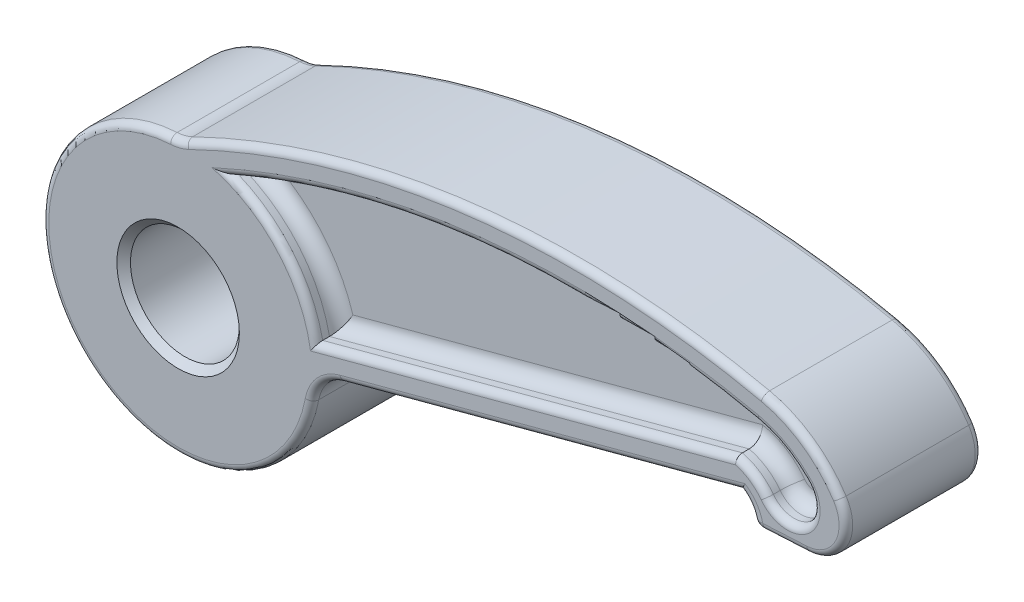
ISO-10303-21;
HEADER;
FILE_DESCRIPTION(('STEP AP214'),'2;1');
FILE_NAME('part.step','',(''),(''),'','','');
FILE_SCHEMA(('AUTOMOTIVE_DESIGN { 1 0 10303 214 1 1 1 1 }'));
ENDSEC;
DATA;
#1=APPLICATION_CONTEXT('core data for automotive mechanical design processes');
#2=APPLICATION_PROTOCOL_DEFINITION('international standard','automotive_design',2000,#1);
#3=PRODUCT_CONTEXT('',#1,'mechanical');
#4=PRODUCT('Part','Part','',(#3));
#5=PRODUCT_RELATED_PRODUCT_CATEGORY('part','',(#4));
#6=PRODUCT_DEFINITION_FORMATION('','',#4);
#7=PRODUCT_DEFINITION_CONTEXT('part definition',#1,'design');
#8=PRODUCT_DEFINITION('design','',#6,#7);
#9=PRODUCT_DEFINITION_SHAPE('','',#8);
#10=(LENGTH_UNIT() NAMED_UNIT(*) SI_UNIT(.MILLI.,.METRE.));
#11=(NAMED_UNIT(*) PLANE_ANGLE_UNIT() SI_UNIT($,.RADIAN.));
#12=(NAMED_UNIT(*) SI_UNIT($,.STERADIAN.) SOLID_ANGLE_UNIT());
#13=UNCERTAINTY_MEASURE_WITH_UNIT(LENGTH_MEASURE(1.E-05),#10,'distance_accuracy_value','');
#14=(GEOMETRIC_REPRESENTATION_CONTEXT(3) GLOBAL_UNCERTAINTY_ASSIGNED_CONTEXT((#13)) GLOBAL_UNIT_ASSIGNED_CONTEXT((#10,
#11,#12)) REPRESENTATION_CONTEXT('',''));
#15=CARTESIAN_POINT('',(0.,0.,0.));
#16=DIRECTION('',(0.,0.,1.));
#17=DIRECTION('',(1.,0.,0.));
#18=AXIS2_PLACEMENT_3D('',#15,#16,#17);
#19=CARTESIAN_POINT('',(40.0137046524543,6.47051536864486,5.));
#20=DIRECTION('',(0.,0.,1.));
#21=DIRECTION('',(1.,0.,0.));
#22=AXIS2_PLACEMENT_3D('',#19,#20,#21);
#23=PLANE('',#22);
#24=CARTESIAN_POINT('',(44.7471403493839,10.0002919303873,5.));
#25=DIRECTION('',(0.,0.,1.));
#26=DIRECTION('',(1.,0.,0.));
#27=AXIS2_PLACEMENT_3D('',#24,#25,#26);
#28=CIRCLE('',#27,2.40463682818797);
#29=CARTESIAN_POINT('',(46.3397863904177,11.8018903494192,5.));
#30=VERTEX_POINT('',#29);
#31=CARTESIAN_POINT('',(42.8194699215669,8.56280627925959,5.));
#32=VERTEX_POINT('',#31);
#33=EDGE_CURVE('E711',#30,#32,#28,.F.);
#34=ORIENTED_EDGE('',*,*,#33,.T.);
#35=CARTESIAN_POINT('',(40.0137046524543,6.47051536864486,5.));
#36=DIRECTION('',(0.,0.,1.));
#37=DIRECTION('',(1.,0.,0.));
#38=AXIS2_PLACEMENT_3D('',#35,#36,#37);
#39=CIRCLE('',#38,3.5);
#40=CARTESIAN_POINT('',(40.9445172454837,9.84447267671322,5.));
#41=VERTEX_POINT('',#40);
#42=EDGE_CURVE('E712',#32,#41,#39,.T.);
#43=ORIENTED_EDGE('',*,*,#42,.T.);
#44=DIRECTION('',(-0.96592582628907,-0.258819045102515,0.));
#45=VECTOR('',#44,1.);
#46=CARTESIAN_POINT('',(39.2325679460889,9.38575724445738,5.));
#47=LINE('',#46,#45);
#48=CARTESIAN_POINT('',(9.72517538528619,1.47927523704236,5.));
#49=VERTEX_POINT('',#48);
#50=EDGE_CURVE('E703',#41,#49,#47,.T.);
#51=ORIENTED_EDGE('',*,*,#50,.T.);
#52=CARTESIAN_POINT('',(0.,0.,5.));
#53=DIRECTION('',(0.,0.,1.));
#54=DIRECTION('',(1.,0.,0.));
#55=AXIS2_PLACEMENT_3D('',#52,#53,#54);
#56=CIRCLE('',#55,9.83703672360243);
#57=CARTESIAN_POINT('',(2.4724481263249,9.52125473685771,5.));
#58=VERTEX_POINT('',#57);
#59=EDGE_CURVE('E705',#49,#58,#56,.T.);
#60=ORIENTED_EDGE('',*,*,#59,.T.);
#61=CARTESIAN_POINT('',(28.997966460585,-48.1731720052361,5.));
#62=DIRECTION('',(0.,0.,1.));
#63=DIRECTION('',(1.,0.,0.));
#64=AXIS2_PLACEMENT_3D('',#61,#62,#63);
#65=CIRCLE('',#64,63.5);
#66=CARTESIAN_POINT('',(42.6214012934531,13.8482115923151,5.));
#67=VERTEX_POINT('',#66);
#68=EDGE_CURVE('E707',#58,#67,#65,.F.);
#69=ORIENTED_EDGE('',*,*,#68,.T.);
#70=CARTESIAN_POINT('',(41.0123341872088,6.5228513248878,5.));
#71=DIRECTION('',(0.,0.,1.));
#72=DIRECTION('',(1.,0.,0.));
#73=AXIS2_PLACEMENT_3D('',#70,#71,#72);
#74=CIRCLE('',#73,7.50000000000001);
#75=EDGE_CURVE('E709',#67,#30,#74,.F.);
#76=ORIENTED_EDGE('',*,*,#75,.T.);
#77=EDGE_LOOP('',(#34,#43,#51,#60,#69,#76));
#78=FACE_BOUND('',#77,.T.);
#79=CARTESIAN_POINT('',(0.,0.,5.));
#80=DIRECTION('',(0.,0.,1.));
#81=DIRECTION('',(1.,0.,0.));
#82=AXIS2_PLACEMENT_3D('',#79,#80,#81);
#83=CIRCLE('',#82,4.50000000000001);
#84=CARTESIAN_POINT('',(4.50000000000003,0.,5.));
#85=VERTEX_POINT('',#84);
#86=EDGE_CURVE('E649',#85,#85,#83,.F.);
#87=ORIENTED_EDGE('',*,*,#86,.T.);
#88=EDGE_LOOP('',(#87));
#89=FACE_BOUND('',#88,.T.);
#90=DIRECTION('',(0.96592582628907,0.258819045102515,0.));
#91=VECTOR('',#90,1.);
#92=CARTESIAN_POINT('',(41.9907714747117,9.08953947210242,5.));
#93=LINE('',#92,#91);
#94=CARTESIAN_POINT('',(11.8781503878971,1.02088696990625,5.));
#95=VERTEX_POINT('',#94);
#96=CARTESIAN_POINT('',(41.6355141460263,8.99434855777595,5.));
#97=VERTEX_POINT('',#96);
#98=EDGE_CURVE('E690',#95,#97,#93,.T.);
#99=ORIENTED_EDGE('',*,*,#98,.T.);
#100=CARTESIAN_POINT('',(40.0137046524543,6.47051536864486,5.));
#101=DIRECTION('',(0.,0.,1.));
#102=DIRECTION('',(1.,0.,0.));
#103=AXIS2_PLACEMENT_3D('',#100,#101,#102);
#104=CIRCLE('',#103,3.);
#105=CARTESIAN_POINT('',(42.9415226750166,7.12464198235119,5.));
#106=VERTEX_POINT('',#105);
#107=EDGE_CURVE('E400',#97,#106,#104,.F.);
#108=ORIENTED_EDGE('',*,*,#107,.T.);
#109=DIRECTION('',(0.998629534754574,0.0523359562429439,0.));
#110=VECTOR('',#109,1.);
#111=CARTESIAN_POINT('',(46.1751974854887,7.29411169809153,5.));
#112=LINE('',#111,#110);
#113=CARTESIAN_POINT('',(46.1751974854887,7.29411169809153,5.));
#114=VERTEX_POINT('',#113);
#115=EDGE_CURVE('E701',#106,#114,#112,.T.);
#116=ORIENTED_EDGE('',*,*,#115,.T.);
#117=CARTESIAN_POINT('',(46.0443575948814,9.79068553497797,5.));
#118=DIRECTION('',(0.,0.,1.));
#119=DIRECTION('',(1.,0.,0.));
#120=AXIS2_PLACEMENT_3D('',#117,#118,#119);
#121=CIRCLE('',#120,2.5);
#122=CARTESIAN_POINT('',(48.1410340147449,11.1522831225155,5.));
#123=VERTEX_POINT('',#122);
#124=EDGE_CURVE('E699',#114,#123,#121,.T.);
#125=ORIENTED_EDGE('',*,*,#124,.T.);
#126=CARTESIAN_POINT('',(41.0123341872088,6.5228513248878,5.));
#127=DIRECTION('',(0.,0.,1.));
#128=DIRECTION('',(1.,0.,0.));
#129=AXIS2_PLACEMENT_3D('',#126,#127,#128);
#130=CIRCLE('',#129,8.5);
#131=CARTESIAN_POINT('',(42.8359435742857,14.8249262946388,5.));
#132=VERTEX_POINT('',#131);
#133=EDGE_CURVE('E697',#123,#132,#130,.T.);
#134=ORIENTED_EDGE('',*,*,#133,.T.);
#135=CARTESIAN_POINT('',(28.997966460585,-48.1731720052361,5.));
#136=DIRECTION('',(0.,0.,1.));
#137=DIRECTION('',(1.,0.,0.));
#138=AXIS2_PLACEMENT_3D('',#135,#136,#137);
#139=CIRCLE('',#138,64.5);
#140=CARTESIAN_POINT('',(0.789278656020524,9.83130999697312,5.));
#141=VERTEX_POINT('',#140);
#142=EDGE_CURVE('E695',#132,#141,#139,.T.);
#143=ORIENTED_EDGE('',*,*,#142,.T.);
#144=CARTESIAN_POINT('',(-0.741425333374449,12.9788400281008,5.));
#145=DIRECTION('',(0.,0.,1.));
#146=DIRECTION('',(1.,0.,0.));
#147=AXIS2_PLACEMENT_3D('',#144,#145,#146);
#148=CIRCLE('',#147,3.5);
#149=CARTESIAN_POINT('',(-0.541810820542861,9.48453694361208,5.));
#150=VERTEX_POINT('',#149);
#151=EDGE_CURVE('E693',#141,#150,#148,.F.);
#152=ORIENTED_EDGE('',*,*,#151,.T.);
#153=CARTESIAN_POINT('',(0.,0.,5.));
#154=DIRECTION('',(0.,0.,1.));
#155=DIRECTION('',(1.,0.,0.));
#156=AXIS2_PLACEMENT_3D('',#153,#154,#155);
#157=CIRCLE('',#156,9.49999999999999);
#158=CARTESIAN_POINT('',(9.34216630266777,-1.72450827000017,5.));
#159=VERTEX_POINT('',#158);
#160=EDGE_CURVE('E686',#150,#159,#157,.T.);
#161=ORIENTED_EDGE('',*,*,#160,.T.);
#162=CARTESIAN_POINT('',(12.7840170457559,-2.35985342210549,5.));
#163=DIRECTION('',(0.,0.,1.));
#164=DIRECTION('',(1.,0.,0.));
#165=AXIS2_PLACEMENT_3D('',#162,#163,#164);
#166=CIRCLE('',#165,3.5);
#167=EDGE_CURVE('E688',#159,#95,#166,.F.);
#168=ORIENTED_EDGE('',*,*,#167,.T.);
#169=EDGE_LOOP('',(#99,#108,#116,#125,#134,#143,#152,#161,#168));
#170=FACE_BOUND('',#169,.T.);
#171=ADVANCED_FACE('F35',(#78,#89,#170),#23,.T.);
#172=CARTESIAN_POINT('',(40.0137046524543,6.47051536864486,5.));
#173=DIRECTION('',(0.,0.,-1.));
#174=DIRECTION('',(-1.,0.,0.));
#175=AXIS2_PLACEMENT_3D('',#172,#173,#174);
#176=CYLINDRICAL_SURFACE('',#175,2.);
#177=DIRECTION('',(0.,0.,-1.));
#178=VECTOR('',#177,1.);
#179=CARTESIAN_POINT('',(40.8785163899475,8.27387353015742,5.));
#180=LINE('',#179,#178);
#181=CARTESIAN_POINT('',(40.8785163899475,8.27387353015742,4.));
#182=VERTEX_POINT('',#181);
#183=CARTESIAN_POINT('',(40.8785163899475,8.27387353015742,-4.5));
#184=VERTEX_POINT('',#183);
#185=EDGE_CURVE('E330',#182,#184,#180,.T.);
#186=ORIENTED_EDGE('',*,*,#185,.T.);
#187=CARTESIAN_POINT('',(40.0137046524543,6.47051536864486,-4.5));
#188=DIRECTION('',(0.,0.,1.));
#189=DIRECTION('',(1.,0.,0.));
#190=AXIS2_PLACEMENT_3D('',#187,#188,#189);
#191=CIRCLE('',#190,2.);
#192=CARTESIAN_POINT('',(41.861847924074,7.23495401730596,-4.5));
#193=VERTEX_POINT('',#192);
#194=EDGE_CURVE('E739',#184,#193,#191,.F.);
#195=ORIENTED_EDGE('',*,*,#194,.T.);
#196=DIRECTION('',(0.,0.,-1.));
#197=VECTOR('',#196,1.);
#198=CARTESIAN_POINT('',(41.861847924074,7.23495401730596,5.));
#199=LINE('',#198,#197);
#200=CARTESIAN_POINT('',(41.861847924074,7.23495401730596,4.));
#201=VERTEX_POINT('',#200);
#202=EDGE_CURVE('E406',#193,#201,#199,.F.);
#203=ORIENTED_EDGE('',*,*,#202,.T.);
#204=CARTESIAN_POINT('',(40.0137046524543,6.47051536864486,4.));
#205=DIRECTION('',(0.,0.,1.));
#206=DIRECTION('',(1.,0.,0.));
#207=AXIS2_PLACEMENT_3D('',#204,#205,#206);
#208=CIRCLE('',#207,2.);
#209=EDGE_CURVE('E409',#201,#182,#208,.T.);
#210=ORIENTED_EDGE('',*,*,#209,.T.);
#211=EDGE_LOOP('',(#186,#195,#203,#210));
#212=FACE_BOUND('',#211,.T.);
#213=ADVANCED_FACE('F516',(#212),#176,.F.);
#214=CARTESIAN_POINT('',(42.0109637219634,6.57518728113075,5.));
#215=DIRECTION('',(-0.0523359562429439,0.998629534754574,0.));
#216=DIRECTION('',(-0.998629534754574,-0.0523359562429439,0.));
#217=AXIS2_PLACEMENT_3D('',#214,#215,#216);
#218=PLANE('',#217);
#219=CARTESIAN_POINT('',(44.5845280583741,6.71006207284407,0.));
#220=DIRECTION('',(-0.0523359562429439,0.998629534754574,0.));
#221=DIRECTION('',(-0.998629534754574,-0.0523359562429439,0.));
#222=AXIS2_PLACEMENT_3D('',#219,#220,#221);
#223=CIRCLE('',#222,0.600000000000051);
#224=CARTESIAN_POINT('',(43.9853503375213,6.6786604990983,0.));
#225=VERTEX_POINT('',#224);
#226=EDGE_CURVE('E11',#225,#225,#223,.T.);
#227=ORIENTED_EDGE('',*,*,#226,.T.);
#228=EDGE_LOOP('',(#227));
#229=FACE_BOUND('',#228,.T.);
#230=DIRECTION('',(0.998629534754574,0.0523359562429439,0.));
#231=VECTOR('',#230,1.);
#232=CARTESIAN_POINT('',(43.009593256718,6.62752323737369,4.5));
#233=LINE('',#232,#231);
#234=CARTESIAN_POINT('',(46.2013654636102,6.79479693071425,4.5));
#235=VERTEX_POINT('',#234);
#236=CARTESIAN_POINT('',(42.9676906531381,6.62532721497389,4.5));
#237=VERTEX_POINT('',#236);
#238=EDGE_CURVE('E501',#235,#237,#233,.F.);
#239=ORIENTED_EDGE('',*,*,#238,.T.);
#240=CARTESIAN_POINT('',(42.681812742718,6.6103449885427,4.41299152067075));
#241=CARTESIAN_POINT('',(42.4311462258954,6.59720811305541,4.78718283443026));
#242=CARTESIAN_POINT('',(42.3816998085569,7.04338634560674,4.8259830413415));
#243=CARTESIAN_POINT('',(42.705686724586,6.61159617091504,4.42905813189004));
#244=CARTESIAN_POINT('',(42.4738613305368,6.59944671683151,4.82119004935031));
#245=CARTESIAN_POINT('',(42.4283043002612,7.05061250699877,4.85811626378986));
#246=CARTESIAN_POINT('',(42.7309438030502,6.61291983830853,4.44306068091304));
#247=CARTESIAN_POINT('',(42.5194676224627,6.60183684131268,4.85166150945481));
#248=CARTESIAN_POINT('',(42.4776542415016,7.05812507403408,4.8861213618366));
#249=CARTESIAN_POINT('',(42.7833582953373,6.61566676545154,4.46661596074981));
#250=CARTESIAN_POINT('',(42.615477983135,6.60686853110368,4.90497075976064));
#251=CARTESIAN_POINT('',(42.5801590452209,7.07344104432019,4.93323192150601));
#252=CARTESIAN_POINT('',(42.8105097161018,6.6170897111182,4.47618205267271));
#253=CARTESIAN_POINT('',(42.6659299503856,6.60951260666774,4.92777081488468));
#254=CARTESIAN_POINT('',(42.6333019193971,7.08124349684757,4.95236410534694));
#255=CARTESIAN_POINT('',(42.8593642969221,6.61965007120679,4.48891390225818));
#256=CARTESIAN_POINT('',(42.7579589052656,6.61433563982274,4.96041889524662));
#257=CARTESIAN_POINT('',(42.7290060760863,7.09503112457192,4.97782780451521));
#258=CARTESIAN_POINT('',(42.8808171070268,6.62077436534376,4.4930632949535));
#259=CARTESIAN_POINT('',(42.7988701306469,6.61647970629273,4.97204740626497));
#260=CARTESIAN_POINT('',(42.7710576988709,7.10100454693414,4.98612658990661));
#261=CARTESIAN_POINT('',(42.9240745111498,6.62304138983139,4.49860719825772));
#262=CARTESIAN_POINT('',(42.8823007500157,6.62085211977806,4.9900711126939));
#263=CARTESIAN_POINT('',(42.8559012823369,7.11289066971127,4.99721439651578));
#264=CARTESIAN_POINT('',(42.9458790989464,6.624184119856,4.50000175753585));
#265=CARTESIAN_POINT('',(42.924827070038,6.6230808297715,4.99642703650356));
#266=CARTESIAN_POINT('',(42.8986932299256,7.1188033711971,5.00000351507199));
#267=CARTESIAN_POINT('',(42.9963365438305,6.62682848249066,4.49999769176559));
#268=CARTESIAN_POINT('',(43.0244545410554,6.62830208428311,5.00473164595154));
#269=CARTESIAN_POINT('',(42.997772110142,7.13231003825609,4.9999953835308));
#270=CARTESIAN_POINT('',(43.0249944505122,6.62833037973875,4.49758694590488));
#271=CARTESIAN_POINT('',(43.0817947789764,6.63130715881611,5.00458157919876));
#272=CARTESIAN_POINT('',(43.0540862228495,7.13985029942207,4.99517389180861));
#273=CARTESIAN_POINT('',(43.0815968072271,6.63129678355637,4.48800972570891));
#274=CARTESIAN_POINT('',(43.1966622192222,6.63732710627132,4.99434490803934));
#275=CARTESIAN_POINT('',(43.1653822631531,7.1545153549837,4.97601945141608));
#276=CARTESIAN_POINT('',(43.1095387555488,6.63276115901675,4.48082845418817));
#277=CARTESIAN_POINT('',(43.254151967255,6.64034001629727,4.98413935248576));
#278=CARTESIAN_POINT('',(43.2203594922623,7.16163878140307,4.96165690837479));
#279=CARTESIAN_POINT('',(43.136660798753,6.6341825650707,4.4713003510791));
#280=CARTESIAN_POINT('',(43.310464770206,6.64329124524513,4.96883029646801));
#281=CARTESIAN_POINT('',(43.2737543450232,7.16844949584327,4.9426007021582));
#282=(BOUNDED_SURFACE() B_SPLINE_SURFACE(3,2,((#240,#241,#242),(#243,#244,#245),(#246,#247,
#248),(#249,#250,#251),(#252,#253,#254),(#255,#256,#257),(#258,#259,#260),(#261,#262,#263),
(#264,#265,#266),(#267,#268,#269),(#270,#271,#272),(#273,#274,#275),(#276,#277,#278),(#279,#280,
#281)),.UNSPECIFIED.,.F.,.F.,.F.) B_SPLINE_SURFACE_WITH_KNOTS((4,2,2,2,2,2,4),(3,3),(0.,
0.0863140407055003,0.172366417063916,0.237834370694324,0.303301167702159,0.389281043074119,
0.475528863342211),(0.,1.),
.UNSPECIFIED.) GEOMETRIC_REPRESENTATION_ITEM() RATIONAL_B_SPLINE_SURFACE(((1.,0.742862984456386,
1.),(1.,0.739648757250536,1.),(1.,0.736315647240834,1.),(1.,0.729540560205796,1.),(1.,
0.726098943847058,1.),(1.,0.720038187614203,1.),(1.,0.717419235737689,1.),(1.,0.712222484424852,
1.),(1.,0.709644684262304,1.),(1.,0.703773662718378,1.),(1.,0.700509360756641,1.),(1.,
0.694185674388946,1.),(1.,0.691126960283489,1.),(1.,0.688215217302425,1.))) REPRESENTATION_ITEM('') SURFACE());
#283=CARTESIAN_POINT('',(43.136660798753,6.6341825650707,4.4713003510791));
#284=CARTESIAN_POINT('',(43.1095387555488,6.63276115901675,4.48082845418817));
#285=CARTESIAN_POINT('',(43.0815968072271,6.63129678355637,4.48800972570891));
#286=CARTESIAN_POINT('',(43.0249944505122,6.62833037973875,4.49758694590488));
#287=CARTESIAN_POINT('',(42.9963365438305,6.62682848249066,4.49999769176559));
#288=CARTESIAN_POINT('',(42.9458790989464,6.624184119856,4.50000175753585));
#289=CARTESIAN_POINT('',(42.9240745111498,6.62304138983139,4.49860719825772));
#290=CARTESIAN_POINT('',(42.8808171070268,6.62077436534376,4.4930632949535));
#291=CARTESIAN_POINT('',(42.8593642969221,6.61965007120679,4.48891390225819));
#292=CARTESIAN_POINT('',(42.8105097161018,6.6170897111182,4.47618205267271));
#293=CARTESIAN_POINT('',(42.7833582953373,6.61566676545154,4.46661596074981));
#294=CARTESIAN_POINT('',(42.7309438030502,6.61291983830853,4.44306068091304));
#295=CARTESIAN_POINT('',(42.705686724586,6.61159617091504,4.42905813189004));
#296=CARTESIAN_POINT('',(42.681812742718,6.6103449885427,4.41299152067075));
#297=B_SPLINE_CURVE_WITH_KNOTS('',3,(#283,#284,#285,#286,#287,#288,#289,#290,#291,#292,#293,
#294,#295,#296),.UNSPECIFIED.,.F.,.F.,(4,2,2,2,2,2,4),(0.,0.0862478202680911,0.172227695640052,
0.237694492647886,0.303162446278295,0.38921482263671,0.475528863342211),.UNSPECIFIED.);
#298=CARTESIAN_POINT('',(42.8382555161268,6.61854380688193,4.48341280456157));
#299=VERTEX_POINT('',#298);
#300=EDGE_CURVE('E503',#237,#299,#297,.T.);
#301=ORIENTED_EDGE('',*,*,#300,.T.);
#302=DIRECTION('',(0.,0.,-1.));
#303=VECTOR('',#302,1.);
#304=CARTESIAN_POINT('',(42.8382555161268,6.61854380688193,5.));
#305=LINE('',#304,#303);
#306=CARTESIAN_POINT('',(42.8382555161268,6.61854380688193,-4.5));
#307=VERTEX_POINT('',#306);
#308=EDGE_CURVE('E403',#299,#307,#305,.T.);
#309=ORIENTED_EDGE('',*,*,#308,.T.);
#310=DIRECTION('',(0.998629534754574,0.0523359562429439,0.));
#311=VECTOR('',#310,1.);
#312=CARTESIAN_POINT('',(42.0109637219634,6.57518728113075,-4.5));
#313=LINE('',#312,#311);
#314=CARTESIAN_POINT('',(46.2013654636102,6.79479693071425,-4.5));
#315=VERTEX_POINT('',#314);
#316=EDGE_CURVE('E498',#307,#315,#313,.T.);
#317=ORIENTED_EDGE('',*,*,#316,.T.);
#318=DIRECTION('',(0.,0.,-1.));
#319=VECTOR('',#318,1.);
#320=CARTESIAN_POINT('',(46.2013654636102,6.79479693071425,5.));
#321=LINE('',#320,#319);
#322=EDGE_CURVE('E920',#315,#235,#321,.F.);
#323=ORIENTED_EDGE('',*,*,#322,.T.);
#324=EDGE_LOOP('',(#239,#301,#309,#317,#323));
#325=FACE_BOUND('',#324,.T.);
#326=ADVANCED_FACE('F510',(#229,#325),#218,.F.);
#327=CARTESIAN_POINT('',(41.0123341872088,6.5228513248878,5.));
#328=DIRECTION('',(0.,0.,-1.));
#329=DIRECTION('',(-1.,0.,0.));
#330=AXIS2_PLACEMENT_3D('',#327,#328,#329);
#331=CYLINDRICAL_SURFACE('',#330,9.);
#332=DIRECTION('',(0.,0.,-1.));
#333=VECTOR('',#332,1.);
#334=CARTESIAN_POINT('',(42.943214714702,15.3132836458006,5.));
#335=LINE('',#334,#333);
#336=CARTESIAN_POINT('',(42.943214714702,15.3132836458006,4.5));
#337=VERTEX_POINT('',#336);
#338=CARTESIAN_POINT('',(42.943214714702,15.3132836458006,-4.5));
#339=VERTEX_POINT('',#338);
#340=EDGE_CURVE('E346',#337,#339,#335,.T.);
#341=ORIENTED_EDGE('',*,*,#340,.F.);
#342=CARTESIAN_POINT('',(41.0123341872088,6.5228513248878,4.5));
#343=DIRECTION('',(0.,0.,1.));
#344=DIRECTION('',(1.,0.,0.));
#345=AXIS2_PLACEMENT_3D('',#342,#343,#344);
#346=CIRCLE('',#345,9.);
#347=CARTESIAN_POINT('',(48.5603692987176,11.4246026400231,4.5));
#348=VERTEX_POINT('',#347);
#349=EDGE_CURVE('E928',#337,#348,#346,.F.);
#350=ORIENTED_EDGE('',*,*,#349,.T.);
#351=DIRECTION('',(0.,0.,-1.));
#352=VECTOR('',#351,1.);
#353=CARTESIAN_POINT('',(48.5603692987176,11.4246026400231,5.));
#354=LINE('',#353,#352);
#355=CARTESIAN_POINT('',(48.5603692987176,11.4246026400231,-4.5));
#356=VERTEX_POINT('',#355);
#357=EDGE_CURVE('E419',#348,#356,#354,.T.);
#358=ORIENTED_EDGE('',*,*,#357,.T.);
#359=CARTESIAN_POINT('',(41.0123341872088,6.5228513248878,-4.5));
#360=DIRECTION('',(0.,0.,1.));
#361=DIRECTION('',(1.,0.,0.));
#362=AXIS2_PLACEMENT_3D('',#359,#360,#361);
#363=CIRCLE('',#362,9.);
#364=EDGE_CURVE('E938',#356,#339,#363,.T.);
#365=ORIENTED_EDGE('',*,*,#364,.T.);
#366=EDGE_LOOP('',(#341,#350,#358,#365));
#367=FACE_BOUND('',#366,.T.);
#368=ADVANCED_FACE('F515',(#367),#331,.T.);
#369=CARTESIAN_POINT('',(28.997966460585,-48.1731720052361,5.));
#370=DIRECTION('',(0.,0.,-1.));
#371=DIRECTION('',(-1.,0.,0.));
#372=AXIS2_PLACEMENT_3D('',#369,#370,#371);
#373=CYLINDRICAL_SURFACE('',#372,65.);
#374=DIRECTION('',(0.,0.,-1.));
#375=VECTOR('',#374,1.);
#376=CARTESIAN_POINT('',(0.57060665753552,10.2809571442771,5.));
#377=LINE('',#376,#375);
#378=CARTESIAN_POINT('',(0.57060665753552,10.2809571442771,-4.5));
#379=VERTEX_POINT('',#378);
#380=CARTESIAN_POINT('',(0.57060665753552,10.2809571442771,4.5));
#381=VERTEX_POINT('',#380);
#382=EDGE_CURVE('E875',#379,#381,#377,.F.);
#383=ORIENTED_EDGE('',*,*,#382,.T.);
#384=CARTESIAN_POINT('',(28.997966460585,-48.1731720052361,4.5));
#385=DIRECTION('',(0.,0.,1.));
#386=DIRECTION('',(1.,0.,0.));
#387=AXIS2_PLACEMENT_3D('',#384,#385,#386);
#388=CIRCLE('',#387,65.);
#389=EDGE_CURVE('E943',#381,#337,#388,.F.);
#390=ORIENTED_EDGE('',*,*,#389,.T.);
#391=ORIENTED_EDGE('',*,*,#340,.T.);
#392=CARTESIAN_POINT('',(28.997966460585,-48.1731720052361,-4.5));
#393=DIRECTION('',(0.,0.,1.));
#394=DIRECTION('',(1.,0.,0.));
#395=AXIS2_PLACEMENT_3D('',#392,#393,#394);
#396=CIRCLE('',#395,65.);
#397=EDGE_CURVE('E854',#339,#379,#396,.T.);
#398=ORIENTED_EDGE('',*,*,#397,.T.);
#399=EDGE_LOOP('',(#383,#390,#391,#398));
#400=FACE_BOUND('',#399,.T.);
#401=ADVANCED_FACE('F983',(#400),#373,.T.);
#402=CARTESIAN_POINT('',(0.,0.,5.));
#403=DIRECTION('',(0.,0.,-1.));
#404=DIRECTION('',(-1.,0.,0.));
#405=AXIS2_PLACEMENT_3D('',#402,#403,#404);
#406=CYLINDRICAL_SURFACE('',#405,9.99999999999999);
#407=DIRECTION('',(0.,0.,-1.));
#408=VECTOR('',#407,1.);
#409=CARTESIAN_POINT('',(9.83385926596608,-1.81527186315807,5.));
#410=LINE('',#409,#408);
#411=CARTESIAN_POINT('',(9.83385926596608,-1.81527186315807,-4.5));
#412=VERTEX_POINT('',#411);
#413=CARTESIAN_POINT('',(9.83385926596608,-1.81527186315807,4.5));
#414=VERTEX_POINT('',#413);
#415=EDGE_CURVE('E867',#412,#414,#410,.F.);
#416=ORIENTED_EDGE('',*,*,#415,.T.);
#417=CARTESIAN_POINT('',(0.,0.,4.5));
#418=DIRECTION('',(0.,0.,1.));
#419=DIRECTION('',(1.,0.,0.));
#420=AXIS2_PLACEMENT_3D('',#417,#418,#419);
#421=CIRCLE('',#420,9.99999999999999);
#422=CARTESIAN_POINT('',(-0.570327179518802,9.98372309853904,4.5));
#423=VERTEX_POINT('',#422);
#424=EDGE_CURVE('E770',#414,#423,#421,.F.);
#425=ORIENTED_EDGE('',*,*,#424,.T.);
#426=DIRECTION('',(0.,0.,-1.));
#427=VECTOR('',#426,1.);
#428=CARTESIAN_POINT('',(-0.570327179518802,9.98372309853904,5.));
#429=LINE('',#428,#427);
#430=CARTESIAN_POINT('',(-0.570327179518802,9.98372309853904,-4.5));
#431=VERTEX_POINT('',#430);
#432=EDGE_CURVE('E869',#423,#431,#429,.T.);
#433=ORIENTED_EDGE('',*,*,#432,.T.);
#434=CARTESIAN_POINT('',(0.,0.,-4.5));
#435=DIRECTION('',(0.,0.,1.));
#436=DIRECTION('',(1.,0.,0.));
#437=AXIS2_PLACEMENT_3D('',#434,#435,#436);
#438=CIRCLE('',#437,9.99999999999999);
#439=EDGE_CURVE('E769',#431,#412,#438,.T.);
#440=ORIENTED_EDGE('',*,*,#439,.T.);
#441=EDGE_LOOP('',(#416,#425,#433,#440));
#442=FACE_BOUND('',#441,.T.);
#443=ADVANCED_FACE('F633',(#442),#406,.T.);
#444=CARTESIAN_POINT('',(40.8785163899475,8.27387353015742,5.));
#445=DIRECTION('',(-0.258819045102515,0.96592582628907,0.));
#446=DIRECTION('',(-0.96592582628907,-0.258819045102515,0.));
#447=AXIS2_PLACEMENT_3D('',#444,#445,#446);
#448=PLANE('',#447);
#449=CARTESIAN_POINT('',(40.8785163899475,8.27387353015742,4.));
#450=CARTESIAN_POINT('',(40.8785067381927,8.27387094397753,4.02248180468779));
#451=CARTESIAN_POINT('',(40.8796421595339,8.27417517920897,4.04494591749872));
#452=CARTESIAN_POINT('',(40.8841080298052,8.27537180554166,4.08960443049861));
#453=CARTESIAN_POINT('',(40.8874350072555,8.27626326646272,4.11179920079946));
#454=CARTESIAN_POINT('',(40.9004484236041,8.27975020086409,4.17714235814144));
#455=CARTESIAN_POINT('',(40.9131728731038,8.28315970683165,4.21966630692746));
#456=CARTESIAN_POINT('',(40.945238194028,8.29175158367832,4.30154701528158));
#457=CARTESIAN_POINT('',(40.9645395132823,8.29692335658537,4.34092100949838));
#458=CARTESIAN_POINT('',(41.0083953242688,8.30867448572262,4.41655085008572));
#459=CARTESIAN_POINT('',(41.0329706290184,8.31525941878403,4.45279352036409));
#460=CARTESIAN_POINT('',(41.1016155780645,8.33365277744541,4.54198651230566));
#461=CARTESIAN_POINT('',(41.1487229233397,8.34627515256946,4.59242994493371));
#462=CARTESIAN_POINT('',(41.2499993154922,8.37341208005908,4.68497831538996));
#463=CARTESIAN_POINT('',(41.3041783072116,8.38792929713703,4.72707129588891));
#464=CARTESIAN_POINT('',(41.4194386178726,8.418813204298,4.80390141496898));
#465=CARTESIAN_POINT('',(41.4806749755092,8.43522143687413,4.83838869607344));
#466=CARTESIAN_POINT('',(41.6071795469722,8.46911823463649,4.89791849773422));
#467=CARTESIAN_POINT('',(41.67244188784,8.48660522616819,4.92297441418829));
#468=CARTESIAN_POINT('',(41.8009013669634,8.52102583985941,4.96156020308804));
#469=CARTESIAN_POINT('',(41.8638983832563,8.53790583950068,4.9758012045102));
#470=CARTESIAN_POINT('',(41.9912959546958,8.57204191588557,4.99502909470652));
#471=CARTESIAN_POINT('',(42.0556987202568,8.58929858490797,5.00000015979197));
#472=CARTESIAN_POINT('',(42.1201809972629,8.60657655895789,5.));
#473=B_SPLINE_CURVE_WITH_KNOTS('',3,(#449,#450,#451,#452,#453,#454,#455,#456,#457,#458,#459,
#460,#461,#462,#463,#464,#465,#466,#467,#468,#469,#470,#471,#472),.UNSPECIFIED.,.F.,.F.,(4,2,2,
2,2,2,2,2,2,2,2,4),(0.,0.0673827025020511,0.134658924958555,0.267394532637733,0.399345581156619,
0.531827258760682,0.741175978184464,0.950822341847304,1.16657278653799,1.38201562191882,
1.58164199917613,1.78160882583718),.UNSPECIFIED.);
#474=CARTESIAN_POINT('',(41.0694531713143,8.32503488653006,4.49999999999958));
#475=VERTEX_POINT('',#474);
#476=EDGE_CURVE('E411',#182,#475,#473,.T.);
#477=ORIENTED_EDGE('',*,*,#476,.T.);
#478=DIRECTION('',(0.96592582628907,0.258819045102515,0.));
#479=VECTOR('',#478,1.);
#480=CARTESIAN_POINT('',(12.0075599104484,0.537924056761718,4.5));
#481=LINE('',#480,#479);
#482=CARTESIAN_POINT('',(12.0075599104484,0.537924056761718,4.5));
#483=VERTEX_POINT('',#482);
#484=EDGE_CURVE('E950',#475,#483,#481,.F.);
#485=ORIENTED_EDGE('',*,*,#484,.T.);
#486=DIRECTION('',(0.,0.,1.));
#487=VECTOR('',#486,1.);
#488=CARTESIAN_POINT('',(12.0075599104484,0.537924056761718,-5.));
#489=LINE('',#488,#487);
#490=CARTESIAN_POINT('',(12.0075599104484,0.537924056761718,-4.5));
#491=VERTEX_POINT('',#490);
#492=EDGE_CURVE('E880',#483,#491,#489,.F.);
#493=ORIENTED_EDGE('',*,*,#492,.T.);
#494=DIRECTION('',(0.96592582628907,0.258819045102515,0.));
#495=VECTOR('',#494,1.);
#496=CARTESIAN_POINT('',(40.8785163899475,8.27387353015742,-4.5));
#497=LINE('',#496,#495);
#498=EDGE_CURVE('E749',#491,#184,#497,.T.);
#499=ORIENTED_EDGE('',*,*,#498,.T.);
#500=ORIENTED_EDGE('',*,*,#185,.F.);
#501=EDGE_LOOP('',(#477,#485,#493,#499,#500));
#502=FACE_BOUND('',#501,.T.);
#503=ADVANCED_FACE('F425',(#502),#448,.F.);
#504=CARTESIAN_POINT('',(40.0137046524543,6.47051536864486,-5.));
#505=DIRECTION('',(0.,0.,1.));
#506=DIRECTION('',(1.,0.,0.));
#507=AXIS2_PLACEMENT_3D('',#504,#505,#506);
#508=PLANE('',#507);
#509=CARTESIAN_POINT('',(0.,0.,-5.));
#510=DIRECTION('',(0.,0.,1.));
#511=DIRECTION('',(1.,0.,0.));
#512=AXIS2_PLACEMENT_3D('',#509,#510,#511);
#513=CIRCLE('',#512,9.83703672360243);
#514=CARTESIAN_POINT('',(2.4724481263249,9.5212547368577,-5.));
#515=VERTEX_POINT('',#514);
#516=CARTESIAN_POINT('',(9.72517538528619,1.47927523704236,-5.));
#517=VERTEX_POINT('',#516);
#518=EDGE_CURVE('E637',#515,#517,#513,.F.);
#519=ORIENTED_EDGE('',*,*,#518,.T.);
#520=DIRECTION('',(0.96592582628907,0.258819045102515,0.));
#521=VECTOR('',#520,1.);
#522=CARTESIAN_POINT('',(41.0711563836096,9.87840553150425,-5.));
#523=LINE('',#522,#521);
#524=CARTESIAN_POINT('',(40.9445172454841,9.84447267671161,-5.));
#525=VERTEX_POINT('',#524);
#526=EDGE_CURVE('E684',#517,#525,#523,.T.);
#527=ORIENTED_EDGE('',*,*,#526,.T.);
#528=CARTESIAN_POINT('',(40.0137046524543,6.47051536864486,-5.));
#529=DIRECTION('',(0.,0.,1.));
#530=DIRECTION('',(1.,0.,0.));
#531=AXIS2_PLACEMENT_3D('',#528,#529,#530);
#532=CIRCLE('',#531,3.5);
#533=CARTESIAN_POINT('',(42.8194699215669,8.56280627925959,-5.));
#534=VERTEX_POINT('',#533);
#535=EDGE_CURVE('E681',#525,#534,#532,.F.);
#536=ORIENTED_EDGE('',*,*,#535,.T.);
#537=CARTESIAN_POINT('',(44.7471403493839,10.0002919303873,-5.));
#538=DIRECTION('',(0.,0.,1.));
#539=DIRECTION('',(1.,0.,0.));
#540=AXIS2_PLACEMENT_3D('',#537,#538,#539);
#541=CIRCLE('',#540,2.40463682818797);
#542=CARTESIAN_POINT('',(46.3397863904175,11.801890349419,-5.));
#543=VERTEX_POINT('',#542);
#544=EDGE_CURVE('E674',#534,#543,#541,.T.);
#545=ORIENTED_EDGE('',*,*,#544,.T.);
#546=CARTESIAN_POINT('',(41.0123341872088,6.5228513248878,-5.));
#547=DIRECTION('',(0.,0.,1.));
#548=DIRECTION('',(1.,0.,0.));
#549=AXIS2_PLACEMENT_3D('',#546,#547,#548);
#550=CIRCLE('',#549,7.50000000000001);
#551=CARTESIAN_POINT('',(42.6214012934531,13.8482115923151,-5.));
#552=VERTEX_POINT('',#551);
#553=EDGE_CURVE('E676',#543,#552,#550,.T.);
#554=ORIENTED_EDGE('',*,*,#553,.T.);
#555=CARTESIAN_POINT('',(28.997966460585,-48.1731720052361,-5.));
#556=DIRECTION('',(0.,0.,1.));
#557=DIRECTION('',(1.,0.,0.));
#558=AXIS2_PLACEMENT_3D('',#555,#556,#557);
#559=CIRCLE('',#558,63.5);
#560=EDGE_CURVE('E678',#552,#515,#559,.T.);
#561=ORIENTED_EDGE('',*,*,#560,.T.);
#562=EDGE_LOOP('',(#519,#527,#536,#545,#554,#561));
#563=FACE_BOUND('',#562,.T.);
#564=CARTESIAN_POINT('',(42.7859195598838,7.61717334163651,-5.));
#565=DIRECTION('',(0.,0.,1.));
#566=DIRECTION('',(1.,0.,0.));
#567=AXIS2_PLACEMENT_3D('',#564,#565,#566);
#568=CIRCLE('',#567,0.5);
#569=CARTESIAN_POINT('',(42.8120875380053,7.11785857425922,-5.));
#570=VERTEX_POINT('',#569);
#571=CARTESIAN_POINT('',(42.3238837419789,7.42606367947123,-5.));
#572=VERTEX_POINT('',#571);
#573=EDGE_CURVE('E642',#570,#572,#568,.F.);
#574=ORIENTED_EDGE('',*,*,#573,.T.);
#575=CARTESIAN_POINT('',(40.0137046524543,6.47051536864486,-5.));
#576=DIRECTION('',(0.,0.,1.));
#577=DIRECTION('',(1.,0.,0.));
#578=AXIS2_PLACEMENT_3D('',#575,#576,#577);
#579=CIRCLE('',#578,2.5);
#580=CARTESIAN_POINT('',(40.9166926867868,8.80174092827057,-5.));
#581=VERTEX_POINT('',#580);
#582=EDGE_CURVE('E672',#572,#581,#579,.T.);
#583=ORIENTED_EDGE('',*,*,#582,.T.);
#584=DIRECTION('',(0.96592582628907,0.258819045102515,0.));
#585=VECTOR('',#584,1.);
#586=CARTESIAN_POINT('',(39.4913869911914,8.41983141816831,-5.));
#587=LINE('',#586,#585);
#588=CARTESIAN_POINT('',(11.8781503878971,1.02088696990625,-5.));
#589=VERTEX_POINT('',#588);
#590=EDGE_CURVE('E659',#581,#589,#587,.F.);
#591=ORIENTED_EDGE('',*,*,#590,.T.);
#592=CARTESIAN_POINT('',(12.7840170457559,-2.35985342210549,-5.));
#593=DIRECTION('',(0.,0.,1.));
#594=DIRECTION('',(1.,0.,0.));
#595=AXIS2_PLACEMENT_3D('',#592,#593,#594);
#596=CIRCLE('',#595,3.5);
#597=CARTESIAN_POINT('',(9.34216630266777,-1.72450827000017,-5.));
#598=VERTEX_POINT('',#597);
#599=EDGE_CURVE('E651',#589,#598,#596,.T.);
#600=ORIENTED_EDGE('',*,*,#599,.T.);
#601=CARTESIAN_POINT('',(0.,0.,-5.));
#602=DIRECTION('',(0.,0.,1.));
#603=DIRECTION('',(1.,0.,0.));
#604=AXIS2_PLACEMENT_3D('',#601,#602,#603);
#605=CIRCLE('',#604,9.49999999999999);
#606=CARTESIAN_POINT('',(-0.541810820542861,9.48453694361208,-5.));
#607=VERTEX_POINT('',#606);
#608=EDGE_CURVE('E648',#598,#607,#605,.F.);
#609=ORIENTED_EDGE('',*,*,#608,.T.);
#610=CARTESIAN_POINT('',(-0.741425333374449,12.9788400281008,-5.));
#611=DIRECTION('',(0.,0.,1.));
#612=DIRECTION('',(1.,0.,0.));
#613=AXIS2_PLACEMENT_3D('',#610,#611,#612);
#614=CIRCLE('',#613,3.5);
#615=CARTESIAN_POINT('',(0.789278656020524,9.83130999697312,-5.));
#616=VERTEX_POINT('',#615);
#617=EDGE_CURVE('E661',#607,#616,#614,.T.);
#618=ORIENTED_EDGE('',*,*,#617,.T.);
#619=CARTESIAN_POINT('',(28.997966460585,-48.1731720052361,-5.));
#620=DIRECTION('',(0.,0.,1.));
#621=DIRECTION('',(1.,0.,0.));
#622=AXIS2_PLACEMENT_3D('',#619,#620,#621);
#623=CIRCLE('',#622,64.5);
#624=CARTESIAN_POINT('',(42.8359435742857,14.8249262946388,-5.));
#625=VERTEX_POINT('',#624);
#626=EDGE_CURVE('E663',#616,#625,#623,.F.);
#627=ORIENTED_EDGE('',*,*,#626,.T.);
#628=CARTESIAN_POINT('',(41.0123341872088,6.5228513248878,-5.));
#629=DIRECTION('',(0.,0.,1.));
#630=DIRECTION('',(1.,0.,0.));
#631=AXIS2_PLACEMENT_3D('',#628,#629,#630);
#632=CIRCLE('',#631,8.5);
#633=CARTESIAN_POINT('',(48.1410340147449,11.1522831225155,-5.));
#634=VERTEX_POINT('',#633);
#635=EDGE_CURVE('E665',#625,#634,#632,.F.);
#636=ORIENTED_EDGE('',*,*,#635,.T.);
#637=CARTESIAN_POINT('',(46.0443575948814,9.79068553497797,-5.));
#638=DIRECTION('',(0.,0.,1.));
#639=DIRECTION('',(1.,0.,0.));
#640=AXIS2_PLACEMENT_3D('',#637,#638,#639);
#641=CIRCLE('',#640,2.5);
#642=CARTESIAN_POINT('',(46.1751974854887,7.29411169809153,-5.));
#643=VERTEX_POINT('',#642);
#644=EDGE_CURVE('E667',#634,#643,#641,.F.);
#645=ORIENTED_EDGE('',*,*,#644,.T.);
#646=DIRECTION('',(0.998629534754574,0.0523359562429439,0.));
#647=VECTOR('',#646,1.);
#648=CARTESIAN_POINT('',(39.9875366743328,6.96983013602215,-5.));
#649=LINE('',#648,#647);
#650=EDGE_CURVE('E669',#643,#570,#649,.F.);
#651=ORIENTED_EDGE('',*,*,#650,.T.);
#652=EDGE_LOOP('',(#574,#583,#591,#600,#609,#618,#627,#636,#645,#651));
#653=FACE_BOUND('',#652,.T.);
#654=CARTESIAN_POINT('',(0.,0.,-5.));
#655=DIRECTION('',(0.,0.,1.));
#656=DIRECTION('',(1.,0.,0.));
#657=AXIS2_PLACEMENT_3D('',#654,#655,#656);
#658=CIRCLE('',#657,4.5);
#659=CARTESIAN_POINT('',(4.50000000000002,0.,-5.));
#660=VERTEX_POINT('',#659);
#661=EDGE_CURVE('E646',#660,#660,#658,.T.);
#662=ORIENTED_EDGE('',*,*,#661,.T.);
#663=EDGE_LOOP('',(#662));
#664=FACE_BOUND('',#663,.T.);
#665=ADVANCED_FACE('F625',(#563,#653,#664),#508,.F.);
#666=CARTESIAN_POINT('',(40.0137046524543,6.47051536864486,-3.5));
#667=DIRECTION('',(0.,0.,1.));
#668=DIRECTION('',(1.,0.,0.));
#669=AXIS2_PLACEMENT_3D('',#666,#667,#668);
#670=PLANE('',#669);
#671=CARTESIAN_POINT('',(41.0123341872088,6.5228513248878,-3.5));
#672=DIRECTION('',(0.,0.,1.));
#673=DIRECTION('',(1.,0.,0.));
#674=AXIS2_PLACEMENT_3D('',#671,#672,#673);
#675=CIRCLE('',#674,6.00000000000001);
#676=CARTESIAN_POINT('',(42.2995878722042,12.3831395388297,-3.5));
#677=VERTEX_POINT('',#676);
#678=CARTESIAN_POINT('',(45.3154930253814,10.7040980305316,-3.5));
#679=VERTEX_POINT('',#678);
#680=EDGE_CURVE('E380',#677,#679,#675,.F.);
#681=ORIENTED_EDGE('',*,*,#680,.T.);
#682=CARTESIAN_POINT('',(44.7471403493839,10.0002919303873,-3.5));
#683=DIRECTION('',(0.,0.,1.));
#684=DIRECTION('',(1.,0.,0.));
#685=AXIS2_PLACEMENT_3D('',#682,#683,#684);
#686=CIRCLE('',#685,0.904636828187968);
#687=CARTESIAN_POINT('',(44.0219407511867,9.45950238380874,-3.5));
#688=VERTEX_POINT('',#687);
#689=EDGE_CURVE('E382',#679,#688,#686,.F.);
#690=ORIENTED_EDGE('',*,*,#689,.T.);
#691=CARTESIAN_POINT('',(40.0137046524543,6.47051536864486,-3.5));
#692=DIRECTION('',(0.,0.,1.));
#693=DIRECTION('',(1.,0.,0.));
#694=AXIS2_PLACEMENT_3D('',#691,#692,#693);
#695=CIRCLE('',#694,5.);
#696=CARTESIAN_POINT('',(40.9130784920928,11.3889629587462,-3.5));
#697=VERTEX_POINT('',#696);
#698=EDGE_CURVE('E372',#688,#697,#695,.T.);
#699=ORIENTED_EDGE('',*,*,#698,.T.);
#700=DIRECTION('',(0.96592582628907,0.258819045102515,0.));
#701=VECTOR('',#700,1.);
#702=CARTESIAN_POINT('',(38.8443393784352,10.834645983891,-3.5));
#703=LINE('',#702,#701);
#704=CARTESIAN_POINT('',(10.836925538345,3.33008206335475,-3.5));
#705=VERTEX_POINT('',#704);
#706=EDGE_CURVE('E374',#697,#705,#703,.F.);
#707=ORIENTED_EDGE('',*,*,#706,.T.);
#708=CARTESIAN_POINT('',(0.,0.,-3.5));
#709=DIRECTION('',(0.,0.,1.));
#710=DIRECTION('',(1.,0.,0.));
#711=AXIS2_PLACEMENT_3D('',#708,#709,#710);
#712=CIRCLE('',#711,11.3370367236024);
#713=CARTESIAN_POINT('',(6.20793989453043,9.48629980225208,-3.5));
#714=VERTEX_POINT('',#713);
#715=EDGE_CURVE('E376',#705,#714,#712,.T.);
#716=ORIENTED_EDGE('',*,*,#715,.T.);
#717=CARTESIAN_POINT('',(28.997966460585,-48.1731720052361,-3.5));
#718=DIRECTION('',(0.,0.,1.));
#719=DIRECTION('',(1.,0.,0.));
#720=AXIS2_PLACEMENT_3D('',#717,#718,#719);
#721=CIRCLE('',#720,62.);
#722=EDGE_CURVE('E378',#714,#677,#721,.F.);
#723=ORIENTED_EDGE('',*,*,#722,.T.);
#724=EDGE_LOOP('',(#681,#690,#699,#707,#716,#723));
#725=FACE_BOUND('',#724,.T.);
#726=ADVANCED_FACE('F623',(#725),#670,.F.);
#727=CARTESIAN_POINT('',(40.0137046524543,6.47051536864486,3.));
#728=DIRECTION('',(0.,0.,1.));
#729=DIRECTION('',(1.,0.,0.));
#730=AXIS2_PLACEMENT_3D('',#727,#728,#729);
#731=CYLINDRICAL_SURFACE('',#730,4.);
#732=DIRECTION('',(0.,0.,1.));
#733=VECTOR('',#732,1.);
#734=CARTESIAN_POINT('',(40.9417468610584,10.3613684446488,3.));
#735=LINE('',#734,#733);
#736=CARTESIAN_POINT('',(40.9417468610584,10.3613684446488,4.));
#737=VERTEX_POINT('',#736);
#738=CARTESIAN_POINT('',(40.9417468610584,10.3613684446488,4.5));
#739=VERTEX_POINT('',#738);
#740=EDGE_CURVE('E312',#737,#739,#735,.T.);
#741=ORIENTED_EDGE('',*,*,#740,.T.);
#742=CARTESIAN_POINT('',(40.0137046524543,6.47051536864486,4.5));
#743=DIRECTION('',(0.,0.,1.));
#744=DIRECTION('',(1.,0.,0.));
#745=AXIS2_PLACEMENT_3D('',#742,#743,#744);
#746=CIRCLE('',#745,4.);
#747=CARTESIAN_POINT('',(43.2202935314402,8.86170498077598,4.5));
#748=VERTEX_POINT('',#747);
#749=EDGE_CURVE('E475',#739,#748,#746,.F.);
#750=ORIENTED_EDGE('',*,*,#749,.T.);
#751=DIRECTION('',(0.,0.,1.));
#752=VECTOR('',#751,1.);
#753=CARTESIAN_POINT('',(43.2202935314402,8.86170498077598,3.));
#754=LINE('',#753,#752);
#755=CARTESIAN_POINT('',(43.2202935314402,8.86170498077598,4.));
#756=VERTEX_POINT('',#755);
#757=EDGE_CURVE('E315',#756,#748,#754,.T.);
#758=ORIENTED_EDGE('',*,*,#757,.F.);
#759=CARTESIAN_POINT('',(40.0137046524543,6.47051536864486,4.));
#760=DIRECTION('',(0.,0.,1.));
#761=DIRECTION('',(1.,0.,0.));
#762=AXIS2_PLACEMENT_3D('',#759,#760,#761);
#763=CIRCLE('',#762,4.);
#764=EDGE_CURVE('E308',#756,#737,#763,.T.);
#765=ORIENTED_EDGE('',*,*,#764,.T.);
#766=EDGE_LOOP('',(#741,#750,#758,#765));
#767=FACE_BOUND('',#766,.T.);
#768=ADVANCED_FACE('F310',(#767),#731,.T.);
#769=CARTESIAN_POINT('',(39.1031584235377,9.86872015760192,3.));
#770=DIRECTION('',(-0.258819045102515,0.96592582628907,0.));
#771=DIRECTION('',(-0.96592582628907,-0.258819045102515,0.));
#772=AXIS2_PLACEMENT_3D('',#769,#770,#771);
#773=PLANE('',#772);
#774=DIRECTION('',(0.,0.,1.));
#775=VECTOR('',#774,1.);
#776=CARTESIAN_POINT('',(10.1208683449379,2.10293893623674,3.));
#777=LINE('',#776,#775);
#778=CARTESIAN_POINT('',(10.1208683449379,2.10293893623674,4.));
#779=VERTEX_POINT('',#778);
#780=CARTESIAN_POINT('',(10.1208683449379,2.10293893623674,4.5));
#781=VERTEX_POINT('',#780);
#782=EDGE_CURVE('E331',#779,#781,#777,.T.);
#783=ORIENTED_EDGE('',*,*,#782,.T.);
#784=DIRECTION('',(-0.96592582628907,-0.258819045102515,0.));
#785=VECTOR('',#784,1.);
#786=CARTESIAN_POINT('',(39.1031584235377,9.86872015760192,4.5));
#787=LINE('',#786,#785);
#788=EDGE_CURVE('E329',#781,#739,#787,.F.);
#789=ORIENTED_EDGE('',*,*,#788,.T.);
#790=ORIENTED_EDGE('',*,*,#740,.F.);
#791=DIRECTION('',(-0.96592582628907,-0.258819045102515,0.));
#792=VECTOR('',#791,1.);
#793=CARTESIAN_POINT('',(10.1208683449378,2.10293893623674,4.));
#794=LINE('',#793,#792);
#795=EDGE_CURVE('E327',#737,#779,#794,.T.);
#796=ORIENTED_EDGE('',*,*,#795,.T.);
#797=EDGE_LOOP('',(#783,#789,#790,#796));
#798=FACE_BOUND('',#797,.T.);
#799=ADVANCED_FACE('F325',(#798),#773,.T.);
#800=CARTESIAN_POINT('',(0.,0.,3.));
#801=DIRECTION('',(0.,0.,1.));
#802=DIRECTION('',(1.,0.,0.));
#803=AXIS2_PLACEMENT_3D('',#800,#801,#802);
#804=CYLINDRICAL_SURFACE('',#803,10.3370367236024);
#805=DIRECTION('',(0.,0.,1.));
#806=VECTOR('',#805,1.);
#807=CARTESIAN_POINT('',(3.8540135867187,9.59171035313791,3.));
#808=LINE('',#807,#806);
#809=CARTESIAN_POINT('',(3.8540135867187,9.59171035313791,4.));
#810=VERTEX_POINT('',#809);
#811=CARTESIAN_POINT('',(3.8540135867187,9.59171035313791,4.5));
#812=VERTEX_POINT('',#811);
#813=EDGE_CURVE('E732',#810,#812,#808,.T.);
#814=ORIENTED_EDGE('',*,*,#813,.T.);
#815=CARTESIAN_POINT('',(0.,0.,4.5));
#816=DIRECTION('',(0.,0.,1.));
#817=DIRECTION('',(1.,0.,0.));
#818=AXIS2_PLACEMENT_3D('',#815,#816,#817);
#819=CIRCLE('',#818,10.3370367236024);
#820=EDGE_CURVE('E50',#812,#781,#819,.F.);
#821=ORIENTED_EDGE('',*,*,#820,.T.);
#822=ORIENTED_EDGE('',*,*,#782,.F.);
#823=CARTESIAN_POINT('',(0.,0.,4.));
#824=DIRECTION('',(0.,0.,1.));
#825=DIRECTION('',(1.,0.,0.));
#826=AXIS2_PLACEMENT_3D('',#823,#824,#825);
#827=CIRCLE('',#826,10.3370367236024);
#828=EDGE_CURVE('E363',#779,#810,#827,.T.);
#829=ORIENTED_EDGE('',*,*,#828,.T.);
#830=EDGE_LOOP('',(#814,#821,#822,#829));
#831=FACE_BOUND('',#830,.T.);
#832=ADVANCED_FACE('F1295',(#831),#804,.T.);
#833=CARTESIAN_POINT('',(28.997966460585,-48.1731720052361,3.));
#834=DIRECTION('',(0.,0.,1.));
#835=DIRECTION('',(1.,0.,0.));
#836=AXIS2_PLACEMENT_3D('',#833,#834,#835);
#837=CYLINDRICAL_SURFACE('',#836,63.);
#838=DIRECTION('',(0.,0.,1.));
#839=VECTOR('',#838,1.);
#840=CARTESIAN_POINT('',(42.5141301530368,13.3598542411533,3.));
#841=LINE('',#840,#839);
#842=CARTESIAN_POINT('',(42.5141301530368,13.3598542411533,4.));
#843=VERTEX_POINT('',#842);
#844=CARTESIAN_POINT('',(42.5141301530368,13.3598542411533,4.5));
#845=VERTEX_POINT('',#844);
#846=EDGE_CURVE('E726',#843,#845,#841,.T.);
#847=ORIENTED_EDGE('',*,*,#846,.T.);
#848=CARTESIAN_POINT('',(28.997966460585,-48.1731720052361,4.5));
#849=DIRECTION('',(0.,0.,1.));
#850=DIRECTION('',(1.,0.,0.));
#851=AXIS2_PLACEMENT_3D('',#848,#849,#850);
#852=CIRCLE('',#851,63.);
#853=EDGE_CURVE('E58',#845,#812,#852,.T.);
#854=ORIENTED_EDGE('',*,*,#853,.T.);
#855=ORIENTED_EDGE('',*,*,#813,.F.);
#856=CARTESIAN_POINT('',(28.997966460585,-48.1731720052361,4.));
#857=DIRECTION('',(0.,0.,1.));
#858=DIRECTION('',(1.,0.,0.));
#859=AXIS2_PLACEMENT_3D('',#856,#857,#858);
#860=CIRCLE('',#859,63.);
#861=EDGE_CURVE('E365',#810,#843,#860,.F.);
#862=ORIENTED_EDGE('',*,*,#861,.T.);
#863=EDGE_LOOP('',(#847,#854,#855,#862));
#864=FACE_BOUND('',#863,.T.);
#865=ADVANCED_FACE('F1097',(#864),#837,.F.);
#866=CARTESIAN_POINT('',(41.0123341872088,6.5228513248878,3.));
#867=DIRECTION('',(0.,0.,1.));
#868=DIRECTION('',(1.,0.,0.));
#869=AXIS2_PLACEMENT_3D('',#866,#867,#868);
#870=CYLINDRICAL_SURFACE('',#869,7.00000000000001);
#871=DIRECTION('',(0.,0.,1.));
#872=VECTOR('',#871,1.);
#873=CARTESIAN_POINT('',(45.9967122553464,11.4377241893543,3.));
#874=LINE('',#873,#872);
#875=CARTESIAN_POINT('',(45.9967122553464,11.4377241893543,4.));
#876=VERTEX_POINT('',#875);
#877=CARTESIAN_POINT('',(45.9967122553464,11.4377241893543,4.5));
#878=VERTEX_POINT('',#877);
#879=EDGE_CURVE('E724',#876,#878,#874,.T.);
#880=ORIENTED_EDGE('',*,*,#879,.T.);
#881=CARTESIAN_POINT('',(41.0123341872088,6.5228513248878,4.5));
#882=DIRECTION('',(0.,0.,1.));
#883=DIRECTION('',(1.,0.,0.));
#884=AXIS2_PLACEMENT_3D('',#881,#882,#883);
#885=CIRCLE('',#884,7.00000000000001);
#886=EDGE_CURVE('E759',#878,#845,#885,.T.);
#887=ORIENTED_EDGE('',*,*,#886,.T.);
#888=ORIENTED_EDGE('',*,*,#846,.F.);
#889=CARTESIAN_POINT('',(41.0123341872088,6.5228513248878,4.));
#890=DIRECTION('',(0.,0.,1.));
#891=DIRECTION('',(1.,0.,0.));
#892=AXIS2_PLACEMENT_3D('',#889,#890,#891);
#893=CIRCLE('',#892,7.00000000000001);
#894=EDGE_CURVE('E367',#843,#876,#893,.F.);
#895=ORIENTED_EDGE('',*,*,#894,.T.);
#896=EDGE_LOOP('',(#880,#887,#888,#895));
#897=FACE_BOUND('',#896,.T.);
#898=ADVANCED_FACE('F1095',(#897),#870,.F.);
#899=CARTESIAN_POINT('',(44.7471403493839,10.0002919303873,3.));
#900=DIRECTION('',(0.,0.,1.));
#901=DIRECTION('',(1.,0.,0.));
#902=AXIS2_PLACEMENT_3D('',#899,#900,#901);
#903=CYLINDRICAL_SURFACE('',#902,1.90463682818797);
#904=ORIENTED_EDGE('',*,*,#757,.T.);
#905=CARTESIAN_POINT('',(44.7471403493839,10.0002919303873,4.5));
#906=DIRECTION('',(0.,0.,1.));
#907=DIRECTION('',(1.,0.,0.));
#908=AXIS2_PLACEMENT_3D('',#905,#906,#907);
#909=CIRCLE('',#908,1.90463682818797);
#910=EDGE_CURVE('E721',#748,#878,#909,.T.);
#911=ORIENTED_EDGE('',*,*,#910,.T.);
#912=ORIENTED_EDGE('',*,*,#879,.F.);
#913=CARTESIAN_POINT('',(44.7471403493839,10.0002919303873,4.));
#914=DIRECTION('',(0.,0.,1.));
#915=DIRECTION('',(1.,0.,0.));
#916=AXIS2_PLACEMENT_3D('',#913,#914,#915);
#917=CIRCLE('',#916,1.90463682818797);
#918=EDGE_CURVE('E321',#876,#756,#917,.F.);
#919=ORIENTED_EDGE('',*,*,#918,.T.);
#920=EDGE_LOOP('',(#904,#911,#912,#919));
#921=FACE_BOUND('',#920,.T.);
#922=ADVANCED_FACE('F718',(#921),#903,.F.);
#923=CARTESIAN_POINT('',(40.0137046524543,6.47051536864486,3.));
#924=DIRECTION('',(0.,0.,1.));
#925=DIRECTION('',(1.,0.,0.));
#926=AXIS2_PLACEMENT_3D('',#923,#924,#925);
#927=PLANE('',#926);
#928=CARTESIAN_POINT('',(0.,0.,3.));
#929=DIRECTION('',(0.,0.,1.));
#930=DIRECTION('',(1.,0.,0.));
#931=AXIS2_PLACEMENT_3D('',#928,#929,#930);
#932=CIRCLE('',#931,11.3370367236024);
#933=CARTESIAN_POINT('',(6.20793989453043,9.48629980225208,3.));
#934=VERTEX_POINT('',#933);
#935=CARTESIAN_POINT('',(10.836925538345,3.33008206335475,3.));
#936=VERTEX_POINT('',#935);
#937=EDGE_CURVE('E359',#934,#936,#932,.F.);
#938=ORIENTED_EDGE('',*,*,#937,.T.);
#939=DIRECTION('',(-0.96592582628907,-0.258819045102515,0.));
#940=VECTOR('',#939,1.);
#941=CARTESIAN_POINT('',(40.6829278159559,11.3272942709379,3.));
#942=LINE('',#941,#940);
#943=CARTESIAN_POINT('',(40.9130784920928,11.3889629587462,3.));
#944=VERTEX_POINT('',#943);
#945=EDGE_CURVE('E361',#936,#944,#942,.F.);
#946=ORIENTED_EDGE('',*,*,#945,.T.);
#947=CARTESIAN_POINT('',(40.0137046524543,6.47051536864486,3.));
#948=DIRECTION('',(0.,0.,1.));
#949=DIRECTION('',(1.,0.,0.));
#950=AXIS2_PLACEMENT_3D('',#947,#948,#949);
#951=CIRCLE('',#950,5.);
#952=CARTESIAN_POINT('',(44.0219407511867,9.45950238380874,3.));
#953=VERTEX_POINT('',#952);
#954=EDGE_CURVE('E336',#944,#953,#951,.F.);
#955=ORIENTED_EDGE('',*,*,#954,.T.);
#956=CARTESIAN_POINT('',(44.7471403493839,10.0002919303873,3.));
#957=DIRECTION('',(0.,0.,1.));
#958=DIRECTION('',(1.,0.,0.));
#959=AXIS2_PLACEMENT_3D('',#956,#957,#958);
#960=CIRCLE('',#959,0.904636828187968);
#961=CARTESIAN_POINT('',(45.3154930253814,10.7040980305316,3.));
#962=VERTEX_POINT('',#961);
#963=EDGE_CURVE('E348',#953,#962,#960,.T.);
#964=ORIENTED_EDGE('',*,*,#963,.T.);
#965=CARTESIAN_POINT('',(41.0123341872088,6.5228513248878,3.));
#966=DIRECTION('',(0.,0.,1.));
#967=DIRECTION('',(1.,0.,0.));
#968=AXIS2_PLACEMENT_3D('',#965,#966,#967);
#969=CIRCLE('',#968,6.00000000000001);
#970=CARTESIAN_POINT('',(42.2995878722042,12.3831395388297,3.));
#971=VERTEX_POINT('',#970);
#972=EDGE_CURVE('E355',#962,#971,#969,.T.);
#973=ORIENTED_EDGE('',*,*,#972,.T.);
#974=CARTESIAN_POINT('',(28.997966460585,-48.1731720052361,3.));
#975=DIRECTION('',(0.,0.,1.));
#976=DIRECTION('',(1.,0.,0.));
#977=AXIS2_PLACEMENT_3D('',#974,#975,#976);
#978=CIRCLE('',#977,62.);
#979=EDGE_CURVE('E357',#971,#934,#978,.T.);
#980=ORIENTED_EDGE('',*,*,#979,.T.);
#981=EDGE_LOOP('',(#938,#946,#955,#964,#973,#980));
#982=FACE_BOUND('',#981,.T.);
#983=ADVANCED_FACE('F1276',(#982),#927,.T.);
#984=CARTESIAN_POINT('',(0.,0.,-5.));
#985=DIRECTION('',(0.,0.,1.));
#986=DIRECTION('',(1.,0.,0.));
#987=AXIS2_PLACEMENT_3D('',#984,#985,#986);
#988=CYLINDRICAL_SURFACE('',#987,4.00000000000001);
#989=CARTESIAN_POINT('',(0.,0.,4.5));
#990=DIRECTION('',(0.,0.,1.));
#991=DIRECTION('',(1.,0.,0.));
#992=AXIS2_PLACEMENT_3D('',#989,#990,#991);
#993=CIRCLE('',#992,4.00000000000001);
#994=CARTESIAN_POINT('',(4.00000000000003,0.,4.5));
#995=VERTEX_POINT('',#994);
#996=EDGE_CURVE('E654',#995,#995,#993,.T.);
#997=ORIENTED_EDGE('',*,*,#996,.T.);
#998=EDGE_LOOP('',(#997));
#999=FACE_BOUND('',#998,.T.);
#1000=CARTESIAN_POINT('',(0.,0.,-4.50000000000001));
#1001=DIRECTION('',(0.,0.,1.));
#1002=DIRECTION('',(1.,0.,0.));
#1003=AXIS2_PLACEMENT_3D('',#1000,#1001,#1002);
#1004=CIRCLE('',#1003,4.00000000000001);
#1005=CARTESIAN_POINT('',(4.00000000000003,0.,-4.50000000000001));
#1006=VERTEX_POINT('',#1005);
#1007=EDGE_CURVE('E878',#1006,#1006,#1004,.F.);
#1008=ORIENTED_EDGE('',*,*,#1007,.T.);
#1009=EDGE_LOOP('',(#1008));
#1010=FACE_BOUND('',#1009,.T.);
#1011=ADVANCED_FACE('F888',(#999,#1010),#988,.F.);
#1012=CARTESIAN_POINT('',(41.0123341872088,6.5228513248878,4.));
#1013=DIRECTION('',(0.,0.,1.));
#1014=DIRECTION('',(1.,0.,0.));
#1015=AXIS2_PLACEMENT_3D('',#1012,#1013,#1014);
#1016=TOROIDAL_SURFACE('',#1015,6.00000000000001,1.);
#1017=CARTESIAN_POINT('',(42.2995878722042,12.3831395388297,4.));
#1018=DIRECTION('',(0.976714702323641,-0.214542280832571,0.));
#1019=DIRECTION('',(0.214542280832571,0.976714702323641,0.));
#1020=AXIS2_PLACEMENT_3D('',#1017,#1018,#1019);
#1021=CIRCLE('',#1020,1.);
#1022=EDGE_CURVE('E561',#971,#843,#1021,.T.);
#1023=ORIENTED_EDGE('',*,*,#1022,.F.);
#1024=ORIENTED_EDGE('',*,*,#972,.F.);
#1025=CARTESIAN_POINT('',(45.9967122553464,11.4377241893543,4.));
#1026=CARTESIAN_POINT('',(45.9967121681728,11.4377240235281,3.97188292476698));
#1027=CARTESIAN_POINT('',(45.995899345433,11.4368585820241,3.94377932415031));
#1028=CARTESIAN_POINT('',(45.9926569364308,11.4334057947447,3.88777329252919));
#1029=CARTESIAN_POINT('',(45.9902274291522,11.4308185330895,3.8598708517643));
#1030=CARTESIAN_POINT('',(45.9805371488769,11.420497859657,3.77681096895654));
#1031=CARTESIAN_POINT('',(45.9708745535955,11.4102054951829,3.72221006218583));
#1032=CARTESIAN_POINT('',(45.945420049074,11.3830774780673,3.616155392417));
#1033=CARTESIAN_POINT('',(45.9296252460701,11.3662387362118,3.56470312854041));
#1034=CARTESIAN_POINT('',(45.8923697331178,11.326489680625,3.46640818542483));
#1035=CARTESIAN_POINT('',(45.870910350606,11.3035807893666,3.41956442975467));
#1036=CARTESIAN_POINT('',(45.8229464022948,11.2523220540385,3.33180091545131));
#1037=CARTESIAN_POINT('',(45.7964408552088,11.2239711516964,3.2908823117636));
#1038=CARTESIAN_POINT('',(45.7391505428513,11.1626047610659,3.2161216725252));
#1039=CARTESIAN_POINT('',(45.7083643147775,11.1295876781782,3.18228206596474));
#1040=CARTESIAN_POINT('',(45.6433959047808,11.0597810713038,3.12262487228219));
#1041=CARTESIAN_POINT('',(45.6092104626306,11.0229879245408,3.09681508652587));
#1042=CARTESIAN_POINT('',(45.5384853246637,10.9466807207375,3.05400503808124));
#1043=CARTESIAN_POINT('',(45.5019477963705,10.9071691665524,3.03699679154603));
#1044=CARTESIAN_POINT('',(45.4422488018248,10.8424018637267,3.01710427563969));
#1045=CARTESIAN_POINT('',(45.4194735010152,10.8176458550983,3.0112962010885));
#1046=CARTESIAN_POINT('',(45.3737205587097,10.7677978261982,3.00313932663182));
#1047=CARTESIAN_POINT('',(45.3507432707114,10.7427063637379,3.00078536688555));
#1048=CARTESIAN_POINT('',(45.3236920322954,10.7130833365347,3.00005516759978));
#1049=CARTESIAN_POINT('',(45.3195916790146,10.7085909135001,2.99999985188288));
#1050=CARTESIAN_POINT('',(45.3154930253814,10.7040980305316,3.));
#1051=B_SPLINE_CURVE_WITH_KNOTS('',3,(#1025,#1026,#1027,#1028,#1029,#1030,#1031,#1032,#1033,
#1034,#1035,#1036,#1037,#1038,#1039,#1040,#1041,#1042,#1043,#1044,#1045,#1046,#1047,#1048,#1049,
#1050),.UNSPECIFIED.,.F.,.F.,(4,2,2,2,2,2,2,2,2,2,2,2,4),(0.,0.08429940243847,0.168594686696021,
0.336916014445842,0.505316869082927,0.673678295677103,0.84207249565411,1.01052438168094,
1.17913941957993,1.34760123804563,1.44986005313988,1.55196595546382,1.57021253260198),.UNSPECIFIED.);
#1052=EDGE_CURVE('E554',#876,#962,#1051,.T.);
#1053=ORIENTED_EDGE('',*,*,#1052,.F.);
#1054=ORIENTED_EDGE('',*,*,#894,.F.);
#1055=EDGE_LOOP('',(#1023,#1024,#1053,#1054));
#1056=FACE_BOUND('',#1055,.T.);
#1057=ADVANCED_FACE('F549',(#1056),#1016,.F.);
#1058=CARTESIAN_POINT('',(44.7471403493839,10.0002919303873,4.));
#1059=DIRECTION('',(0.,0.,1.));
#1060=DIRECTION('',(1.,0.,0.));
#1061=AXIS2_PLACEMENT_3D('',#1058,#1059,#1060);
#1062=DEGENERATE_TOROIDAL_SURFACE('',#1061,0.904636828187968,1.,.T.);
#1063=ORIENTED_EDGE('',*,*,#1052,.T.);
#1064=ORIENTED_EDGE('',*,*,#963,.F.);
#1065=CARTESIAN_POINT('',(44.0219407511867,9.45950238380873,4.));
#1066=DIRECTION('',(0.597797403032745,-0.801647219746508,0.));
#1067=DIRECTION('',(0.801647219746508,0.597797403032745,0.));
#1068=AXIS2_PLACEMENT_3D('',#1065,#1066,#1067);
#1069=CIRCLE('',#1068,1.);
#1070=EDGE_CURVE('E1671',#756,#953,#1069,.T.);
#1071=ORIENTED_EDGE('',*,*,#1070,.F.);
#1072=ORIENTED_EDGE('',*,*,#918,.F.);
#1073=EDGE_LOOP('',(#1063,#1064,#1071,#1072));
#1074=FACE_BOUND('',#1073,.T.);
#1075=ADVANCED_FACE('F544',(#1074),#1062,.F.);
#1076=CARTESIAN_POINT('',(28.997966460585,-48.1731720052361,4.));
#1077=DIRECTION('',(0.,0.,1.));
#1078=DIRECTION('',(1.,0.,0.));
#1079=AXIS2_PLACEMENT_3D('',#1076,#1077,#1078);
#1080=TOROIDAL_SURFACE('',#1079,62.,1.);
#1081=ORIENTED_EDGE('',*,*,#1022,.T.);
#1082=ORIENTED_EDGE('',*,*,#861,.F.);
#1083=CARTESIAN_POINT('',(3.8540135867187,9.59171035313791,4.));
#1084=CARTESIAN_POINT('',(3.85394090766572,9.59170801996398,3.97553673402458));
#1085=CARTESIAN_POINT('',(3.85633540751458,9.5917434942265,3.95117398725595));
#1086=CARTESIAN_POINT('',(3.86536930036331,9.59186958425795,3.90356793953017));
#1087=CARTESIAN_POINT('',(3.87195209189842,9.59195946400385,3.88031409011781));
#1088=CARTESIAN_POINT('',(3.89089264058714,9.59220299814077,3.82926941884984));
#1089=CARTESIAN_POINT('',(3.90430964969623,9.59236717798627,3.8018798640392));
#1090=CARTESIAN_POINT('',(3.9353574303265,9.59270358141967,3.74948651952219));
#1091=CARTESIAN_POINT('',(3.95301188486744,9.59287584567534,3.72449728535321));
#1092=CARTESIAN_POINT('',(4.00449673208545,9.5932934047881,3.66044871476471));
#1093=CARTESIAN_POINT('',(4.04106662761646,9.59350674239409,3.62361971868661));
#1094=CARTESIAN_POINT('',(4.11894198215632,9.59370751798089,3.55550054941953));
#1095=CARTESIAN_POINT('',(4.16025702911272,9.59369449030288,3.52422192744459));
#1096=CARTESIAN_POINT('',(4.24885951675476,9.59336308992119,3.46395693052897));
#1097=CARTESIAN_POINT('',(4.29636274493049,9.59302305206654,3.43529212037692));
#1098=CARTESIAN_POINT('',(4.39356780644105,9.59195737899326,3.38193041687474));
#1099=CARTESIAN_POINT('',(4.44327200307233,9.59123131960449,3.35723792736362));
#1100=CARTESIAN_POINT('',(4.54429730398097,9.58936308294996,3.31109846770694));
#1101=CARTESIAN_POINT('',(4.59562221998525,9.58821984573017,3.28965996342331));
#1102=CARTESIAN_POINT('',(4.69936565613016,9.58550014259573,3.24962741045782));
#1103=CARTESIAN_POINT('',(4.75178455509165,9.58392352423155,3.23103436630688));
#1104=CARTESIAN_POINT('',(4.91715250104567,9.57829031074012,3.17673484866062));
#1105=CARTESIAN_POINT('',(5.03153699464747,9.57344508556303,3.14544452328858));
#1106=CARTESIAN_POINT('',(5.26243627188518,9.56168078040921,3.09231017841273));
#1107=CARTESIAN_POINT('',(5.37895329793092,9.55475938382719,3.07047677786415));
#1108=CARTESIAN_POINT('',(5.61288753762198,9.53886449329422,3.03555893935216));
#1109=CARTESIAN_POINT('',(5.73030230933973,9.52989539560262,3.02245599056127));
#1110=CARTESIAN_POINT('',(5.96551574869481,9.50994081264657,3.00477038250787));
#1111=CARTESIAN_POINT('',(6.08331395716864,9.49895721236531,3.00017980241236));
#1112=CARTESIAN_POINT('',(6.2032986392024,9.48677228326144,3.00000173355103));
#1113=CARTESIAN_POINT('',(6.2056192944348,9.486536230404,3.00000000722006));
#1114=CARTESIAN_POINT('',(6.20793989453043,9.48629980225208,3.));
#1115=B_SPLINE_CURVE_WITH_KNOTS('',3,(#1083,#1084,#1085,#1086,#1087,#1088,#1089,#1090,#1091,
#1092,#1093,#1094,#1095,#1096,#1097,#1098,#1099,#1100,#1101,#1102,#1103,#1104,#1105,#1106,#1107,
#1108,#1109,#1110,#1111,#1112,#1113,#1114),.UNSPECIFIED.,.F.,.F.,(4,2,2,2,2,2,2,2,2,2,2,2,2,2,2,
4),(0.,0.0731110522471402,0.145254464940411,0.236240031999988,0.32774646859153,
0.482577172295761,0.637726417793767,0.803917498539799,0.970291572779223,1.13709134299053,
1.30394986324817,1.65944466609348,2.01533761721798,2.37047356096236,2.72527888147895,
2.73227676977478),.UNSPECIFIED.);
#1116=EDGE_CURVE('E340',#934,#810,#1115,.F.);
#1117=ORIENTED_EDGE('',*,*,#1116,.F.);
#1118=ORIENTED_EDGE('',*,*,#979,.F.);
#1119=EDGE_LOOP('',(#1081,#1082,#1117,#1118));
#1120=FACE_BOUND('',#1119,.T.);
#1121=ADVANCED_FACE('F540',(#1120),#1080,.F.);
#1122=CARTESIAN_POINT('',(40.0137046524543,6.47051536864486,4.));
#1123=DIRECTION('',(0.,0.,1.));
#1124=DIRECTION('',(1.,0.,0.));
#1125=AXIS2_PLACEMENT_3D('',#1122,#1123,#1124);
#1126=TOROIDAL_SURFACE('',#1125,5.,1.);
#1127=ORIENTED_EDGE('',*,*,#1070,.T.);
#1128=ORIENTED_EDGE('',*,*,#954,.F.);
#1129=CARTESIAN_POINT('',(40.9417468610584,10.3613684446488,4.));
#1130=CARTESIAN_POINT('',(40.9417466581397,10.3613681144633,3.97246694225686));
#1131=CARTESIAN_POINT('',(40.9417306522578,10.3625420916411,3.94494732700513));
#1132=CARTESIAN_POINT('',(40.941665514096,10.3672220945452,3.89011035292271));
#1133=CARTESIAN_POINT('',(40.9416163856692,10.3707278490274,3.8627929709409));
#1134=CARTESIAN_POINT('',(40.9414173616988,10.3846951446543,3.78153253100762));
#1135=CARTESIAN_POINT('',(40.9412158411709,10.3986069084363,3.72814249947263));
#1136=CARTESIAN_POINT('',(40.9406484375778,10.4351672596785,3.6244719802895));
#1137=CARTESIAN_POINT('',(40.9402825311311,10.4578170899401,3.57419193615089));
#1138=CARTESIAN_POINT('',(40.9393483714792,10.5111189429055,3.47806898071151));
#1139=CARTESIAN_POINT('',(40.9387801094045,10.5417713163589,3.43222626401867));
#1140=CARTESIAN_POINT('',(40.9373914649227,10.610618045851,3.34555491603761));
#1141=CARTESIAN_POINT('',(40.9365676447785,10.6489125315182,3.30480598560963));
#1142=CARTESIAN_POINT('',(40.9346353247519,10.7316358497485,3.23008969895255));
#1143=CARTESIAN_POINT('',(40.9335267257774,10.7760668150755,3.19612471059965));
#1144=CARTESIAN_POINT('',(40.9309684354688,10.8711359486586,3.1349415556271));
#1145=CARTESIAN_POINT('',(40.9295099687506,10.9219143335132,3.1079418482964));
#1146=CARTESIAN_POINT('',(40.9262687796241,11.0271947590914,3.06264719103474));
#1147=CARTESIAN_POINT('',(40.9244861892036,11.0816952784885,3.04434870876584));
#1148=CARTESIAN_POINT('',(40.9211791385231,11.1768903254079,3.02083429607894));
#1149=CARTESIAN_POINT('',(40.9197277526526,11.2170505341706,3.01336980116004));
#1150=CARTESIAN_POINT('',(40.9166917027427,11.2979158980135,3.00316656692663));
#1151=CARTESIAN_POINT('',(40.9151072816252,11.3386199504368,3.00041940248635));
#1152=CARTESIAN_POINT('',(40.9133387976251,11.3825260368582,3.0000147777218));
#1153=CARTESIAN_POINT('',(40.9132088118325,11.3857446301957,2.99999996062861));
#1154=CARTESIAN_POINT('',(40.9130784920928,11.3889629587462,3.));
#1155=B_SPLINE_CURVE_WITH_KNOTS('',3,(#1129,#1130,#1131,#1132,#1133,#1134,#1135,#1136,#1137,
#1138,#1139,#1140,#1141,#1142,#1143,#1144,#1145,#1146,#1147,#1148,#1149,#1150,#1151,#1152,#1153,
#1154),.UNSPECIFIED.,.F.,.F.,(4,2,2,2,2,2,2,2,2,2,2,2,4),(0.,0.0825475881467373,
0.165085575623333,0.329750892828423,0.494439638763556,0.659135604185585,0.826150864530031,
0.993224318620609,1.16503215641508,1.33677018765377,1.45914595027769,1.58130292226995,
1.59096651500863),.UNSPECIFIED.);
#1156=EDGE_CURVE('E334',#737,#944,#1155,.T.);
#1157=ORIENTED_EDGE('',*,*,#1156,.F.);
#1158=ORIENTED_EDGE('',*,*,#764,.F.);
#1159=EDGE_LOOP('',(#1127,#1128,#1157,#1158));
#1160=FACE_BOUND('',#1159,.T.);
#1161=ADVANCED_FACE('F335',(#1160),#1126,.F.);
#1162=CARTESIAN_POINT('',(0.,0.,4.));
#1163=DIRECTION('',(0.,0.,1.));
#1164=DIRECTION('',(1.,0.,0.));
#1165=AXIS2_PLACEMENT_3D('',#1162,#1163,#1164);
#1166=TOROIDAL_SURFACE('',#1165,11.3370367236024,1.);
#1167=ORIENTED_EDGE('',*,*,#1116,.T.);
#1168=ORIENTED_EDGE('',*,*,#828,.F.);
#1169=CARTESIAN_POINT('',(10.1208683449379,2.10293893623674,4.));
#1170=CARTESIAN_POINT('',(10.120865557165,2.10293479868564,3.97783536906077));
#1171=CARTESIAN_POINT('',(10.121431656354,2.10385344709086,3.95568501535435));
#1172=CARTESIAN_POINT('',(10.1236707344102,2.10748936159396,3.911608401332));
#1173=CARTESIAN_POINT('',(10.1253427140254,2.11020500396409,3.88968195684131));
#1174=CARTESIAN_POINT('',(10.1319274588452,2.12090599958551,3.82491694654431));
#1175=CARTESIAN_POINT('',(10.1384104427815,2.13144759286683,3.78263141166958));
#1176=CARTESIAN_POINT('',(10.1549947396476,2.15847742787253,3.70099295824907));
#1177=CARTESIAN_POINT('',(10.1650843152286,2.17494638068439,3.6616310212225));
#1178=CARTESIAN_POINT('',(10.1882223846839,2.21282693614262,3.5862201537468));
#1179=CARTESIAN_POINT('',(10.2012783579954,2.23425103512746,3.55017992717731));
#1180=CARTESIAN_POINT('',(10.2360392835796,2.29149351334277,3.46648294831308));
#1181=CARTESIAN_POINT('',(10.2590028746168,2.32946736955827,3.42082626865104));
#1182=CARTESIAN_POINT('',(10.3081688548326,2.41125967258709,3.33715229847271));
#1183=CARTESIAN_POINT('',(10.3343777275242,2.4550898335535,3.29915071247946));
#1184=CARTESIAN_POINT('',(10.3998082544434,2.56522344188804,3.2166849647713));
#1185=CARTESIAN_POINT('',(10.4400492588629,2.63351549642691,3.17569294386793));
#1186=CARTESIAN_POINT('',(10.5226991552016,2.77514310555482,3.1068219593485));
#1187=CARTESIAN_POINT('',(10.5651102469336,2.84848380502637,3.07895660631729));
#1188=CARTESIAN_POINT('',(10.6453718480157,2.98864748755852,3.03839552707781));
#1189=CARTESIAN_POINT('',(10.6831167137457,3.05511377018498,3.0242216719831));
#1190=CARTESIAN_POINT('',(10.7586190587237,3.1892107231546,3.00516590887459));
#1191=CARTESIAN_POINT('',(10.796376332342,3.25683854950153,3.00026387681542));
#1192=CARTESIAN_POINT('',(10.8348832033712,3.32639181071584,3.00000346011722));
#1193=CARTESIAN_POINT('',(10.8359044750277,3.32823691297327,3.00000000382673));
#1194=CARTESIAN_POINT('',(10.836925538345,3.33008206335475,3.));
#1195=B_SPLINE_CURVE_WITH_KNOTS('',3,(#1169,#1170,#1171,#1172,#1173,#1174,#1175,#1176,#1177,
#1178,#1179,#1180,#1181,#1182,#1183,#1184,#1185,#1186,#1187,#1188,#1189,#1190,#1191,#1192,#1193,
#1194),.UNSPECIFIED.,.F.,.F.,(4,2,2,2,2,2,2,2,2,2,2,2,4),(0.,0.066440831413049,
0.132821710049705,0.264221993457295,0.395198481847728,0.526508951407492,0.716460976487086,
0.906798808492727,1.17308796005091,1.43965261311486,1.67232972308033,1.90450123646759,
1.91082788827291),.UNSPECIFIED.);
#1196=EDGE_CURVE('E341',#936,#779,#1195,.F.);
#1197=ORIENTED_EDGE('',*,*,#1196,.F.);
#1198=ORIENTED_EDGE('',*,*,#937,.F.);
#1199=EDGE_LOOP('',(#1167,#1168,#1197,#1198));
#1200=FACE_BOUND('',#1199,.T.);
#1201=ADVANCED_FACE('F525',(#1200),#1166,.F.);
#1202=CARTESIAN_POINT('',(38.8443393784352,10.834645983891,4.));
#1203=DIRECTION('',(0.96592582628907,0.258819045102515,0.));
#1204=DIRECTION('',(-0.258819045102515,0.96592582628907,0.));
#1205=AXIS2_PLACEMENT_3D('',#1202,#1203,#1204);
#1206=CYLINDRICAL_SURFACE('',#1205,1.);
#1207=ORIENTED_EDGE('',*,*,#1156,.T.);
#1208=ORIENTED_EDGE('',*,*,#945,.F.);
#1209=ORIENTED_EDGE('',*,*,#1196,.T.);
#1210=ORIENTED_EDGE('',*,*,#795,.F.);
#1211=EDGE_LOOP('',(#1207,#1208,#1209,#1210));
#1212=FACE_BOUND('',#1211,.T.);
#1213=ADVANCED_FACE('F343',(#1212),#1206,.F.);
#1214=CARTESIAN_POINT('',(0.,0.,-4.5));
#1215=DIRECTION('',(0.,0.,1.));
#1216=DIRECTION('',(1.,0.,0.));
#1217=AXIS2_PLACEMENT_3D('',#1214,#1215,#1216);
#1218=TOROIDAL_SURFACE('',#1217,11.3370367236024,1.);
#1219=CARTESIAN_POINT('',(3.8540135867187,9.59171035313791,-4.5));
#1220=CARTESIAN_POINT('',(3.85394090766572,9.59170801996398,-4.47553673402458));
#1221=CARTESIAN_POINT('',(3.85633540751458,9.5917434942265,-4.45117398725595));
#1222=CARTESIAN_POINT('',(3.86536930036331,9.59186958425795,-4.40356793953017));
#1223=CARTESIAN_POINT('',(3.87195209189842,9.59195946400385,-4.38031409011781));
#1224=CARTESIAN_POINT('',(3.89089264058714,9.59220299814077,-4.32926941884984));
#1225=CARTESIAN_POINT('',(3.90430964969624,9.59236717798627,-4.3018798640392));
#1226=CARTESIAN_POINT('',(3.9353574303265,9.59270358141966,-4.24948651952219));
#1227=CARTESIAN_POINT('',(3.95301188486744,9.59287584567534,-4.22449728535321));
#1228=CARTESIAN_POINT('',(4.00449673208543,9.5932934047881,-4.1604487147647));
#1229=CARTESIAN_POINT('',(4.04106662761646,9.59350674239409,-4.12361971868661));
#1230=CARTESIAN_POINT('',(4.11894198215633,9.59370751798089,-4.05550054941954));
#1231=CARTESIAN_POINT('',(4.16025702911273,9.59369449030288,-4.02422192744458));
#1232=CARTESIAN_POINT('',(4.24885951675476,9.59336308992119,-3.96395693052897));
#1233=CARTESIAN_POINT('',(4.29636274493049,9.59302305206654,-3.93529212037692));
#1234=CARTESIAN_POINT('',(4.39356780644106,9.59195737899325,-3.88193041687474));
#1235=CARTESIAN_POINT('',(4.44327200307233,9.59123131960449,-3.85723792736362));
#1236=CARTESIAN_POINT('',(4.54429730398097,9.58936308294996,-3.81109846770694));
#1237=CARTESIAN_POINT('',(4.59562221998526,9.58821984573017,-3.7896599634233));
#1238=CARTESIAN_POINT('',(4.69936565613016,9.58550014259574,-3.74962741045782));
#1239=CARTESIAN_POINT('',(4.75178455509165,9.58392352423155,-3.73103436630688));
#1240=CARTESIAN_POINT('',(4.91715250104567,9.57829031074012,-3.67673484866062));
#1241=CARTESIAN_POINT('',(5.03153699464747,9.57344508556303,-3.64544452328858));
#1242=CARTESIAN_POINT('',(5.26243627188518,9.56168078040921,-3.59231017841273));
#1243=CARTESIAN_POINT('',(5.37895329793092,9.5547593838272,-3.57047677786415));
#1244=CARTESIAN_POINT('',(5.61288753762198,9.53886449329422,-3.53555893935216));
#1245=CARTESIAN_POINT('',(5.73030230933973,9.5298953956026,-3.52245599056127));
#1246=CARTESIAN_POINT('',(5.96551574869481,9.50994081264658,-3.50477038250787));
#1247=CARTESIAN_POINT('',(6.08331395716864,9.49895721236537,-3.50017980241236));
#1248=CARTESIAN_POINT('',(6.2032986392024,9.48677228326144,-3.50000173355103));
#1249=CARTESIAN_POINT('',(6.2056192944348,9.486536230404,-3.50000000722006));
#1250=CARTESIAN_POINT('',(6.20793989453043,9.48629980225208,-3.5));
#1251=B_SPLINE_CURVE_WITH_KNOTS('',3,(#1219,#1220,#1221,#1222,#1223,#1224,#1225,#1226,#1227,
#1228,#1229,#1230,#1231,#1232,#1233,#1234,#1235,#1236,#1237,#1238,#1239,#1240,#1241,#1242,#1243,
#1244,#1245,#1246,#1247,#1248,#1249,#1250),.UNSPECIFIED.,.F.,.F.,(4,2,2,2,2,2,2,2,2,2,2,2,2,2,2,
4),(0.,0.0731110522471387,0.145254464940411,0.236240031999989,0.327746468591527,
0.482577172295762,0.637726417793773,0.803917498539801,0.970291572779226,1.13709134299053,
1.30394986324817,1.65944466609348,2.01533761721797,2.37047356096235,2.72527888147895,
2.73227676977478),.UNSPECIFIED.);
#1252=CARTESIAN_POINT('',(3.8540135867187,9.59171035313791,-4.5));
#1253=VERTEX_POINT('',#1252);
#1254=EDGE_CURVE('E594',#714,#1253,#1251,.F.);
#1255=ORIENTED_EDGE('',*,*,#1254,.F.);
#1256=ORIENTED_EDGE('',*,*,#715,.F.);
#1257=CARTESIAN_POINT('',(10.1208683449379,2.10293893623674,-4.5));
#1258=CARTESIAN_POINT('',(10.120865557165,2.10293479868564,-4.47783536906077));
#1259=CARTESIAN_POINT('',(10.121431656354,2.10385344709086,-4.45568501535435));
#1260=CARTESIAN_POINT('',(10.1236707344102,2.10748936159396,-4.41160840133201));
#1261=CARTESIAN_POINT('',(10.1253427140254,2.11020500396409,-4.38968195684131));
#1262=CARTESIAN_POINT('',(10.1319274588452,2.12090599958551,-4.32491694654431));
#1263=CARTESIAN_POINT('',(10.1384104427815,2.13144759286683,-4.28263141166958));
#1264=CARTESIAN_POINT('',(10.1549947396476,2.15847742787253,-4.20099295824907));
#1265=CARTESIAN_POINT('',(10.1650843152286,2.17494638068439,-4.1616310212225));
#1266=CARTESIAN_POINT('',(10.1882223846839,2.21282693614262,-4.0862201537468));
#1267=CARTESIAN_POINT('',(10.2012783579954,2.23425103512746,-4.05017992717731));
#1268=CARTESIAN_POINT('',(10.2360392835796,2.29149351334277,-3.96648294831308));
#1269=CARTESIAN_POINT('',(10.2590028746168,2.32946736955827,-3.92082626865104));
#1270=CARTESIAN_POINT('',(10.3081688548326,2.41125967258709,-3.83715229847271));
#1271=CARTESIAN_POINT('',(10.3343777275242,2.4550898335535,-3.79915071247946));
#1272=CARTESIAN_POINT('',(10.3998082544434,2.56522344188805,-3.7166849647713));
#1273=CARTESIAN_POINT('',(10.4400492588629,2.63351549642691,-3.67569294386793));
#1274=CARTESIAN_POINT('',(10.5226991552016,2.77514310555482,-3.6068219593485));
#1275=CARTESIAN_POINT('',(10.5651102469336,2.84848380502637,-3.57895660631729));
#1276=CARTESIAN_POINT('',(10.6453718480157,2.98864748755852,-3.53839552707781));
#1277=CARTESIAN_POINT('',(10.6831167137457,3.05511377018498,-3.5242216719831));
#1278=CARTESIAN_POINT('',(10.7586190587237,3.1892107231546,-3.50516590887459));
#1279=CARTESIAN_POINT('',(10.796376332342,3.25683854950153,-3.50026387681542));
#1280=CARTESIAN_POINT('',(10.8348832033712,3.32639181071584,-3.50000346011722));
#1281=CARTESIAN_POINT('',(10.8359044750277,3.32823691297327,-3.50000000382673));
#1282=CARTESIAN_POINT('',(10.836925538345,3.33008206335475,-3.5));
#1283=B_SPLINE_CURVE_WITH_KNOTS('',3,(#1257,#1258,#1259,#1260,#1261,#1262,#1263,#1264,#1265,
#1266,#1267,#1268,#1269,#1270,#1271,#1272,#1273,#1274,#1275,#1276,#1277,#1278,#1279,#1280,#1281,
#1282),.UNSPECIFIED.,.F.,.F.,(4,2,2,2,2,2,2,2,2,2,2,2,4),(0.,0.066440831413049,
0.132821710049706,0.264221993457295,0.395198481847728,0.526508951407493,0.716460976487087,
0.906798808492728,1.17308796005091,1.43965261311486,1.67232972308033,1.90450123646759,
1.91082788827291),.UNSPECIFIED.);
#1284=CARTESIAN_POINT('',(10.1208683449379,2.10293893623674,-4.5));
#1285=VERTEX_POINT('',#1284);
#1286=EDGE_CURVE('E601',#1285,#705,#1283,.T.);
#1287=ORIENTED_EDGE('',*,*,#1286,.F.);
#1288=CARTESIAN_POINT('',(0.,0.,-4.5));
#1289=DIRECTION('',(0.,0.,1.));
#1290=DIRECTION('',(1.,0.,0.));
#1291=AXIS2_PLACEMENT_3D('',#1288,#1289,#1290);
#1292=CIRCLE('',#1291,10.3370367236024);
#1293=EDGE_CURVE('E391',#1253,#1285,#1292,.F.);
#1294=ORIENTED_EDGE('',*,*,#1293,.F.);
#1295=EDGE_LOOP('',(#1255,#1256,#1287,#1294));
#1296=FACE_BOUND('',#1295,.T.);
#1297=ADVANCED_FACE('F524',(#1296),#1218,.F.);
#1298=CARTESIAN_POINT('',(38.8443393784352,10.834645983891,-4.5));
#1299=DIRECTION('',(0.96592582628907,0.258819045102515,0.));
#1300=DIRECTION('',(-0.258819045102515,0.96592582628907,0.));
#1301=AXIS2_PLACEMENT_3D('',#1298,#1299,#1300);
#1302=CYLINDRICAL_SURFACE('',#1301,1.);
#1303=ORIENTED_EDGE('',*,*,#1286,.T.);
#1304=ORIENTED_EDGE('',*,*,#706,.F.);
#1305=CARTESIAN_POINT('',(40.9417468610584,10.3613684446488,-4.5));
#1306=CARTESIAN_POINT('',(40.9417466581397,10.3613681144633,-4.47246694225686));
#1307=CARTESIAN_POINT('',(40.9417306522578,10.3625420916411,-4.44494732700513));
#1308=CARTESIAN_POINT('',(40.9416655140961,10.3672220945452,-4.39011035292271));
#1309=CARTESIAN_POINT('',(40.9416163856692,10.3707278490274,-4.3627929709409));
#1310=CARTESIAN_POINT('',(40.9414173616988,10.3846951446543,-4.28153253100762));
#1311=CARTESIAN_POINT('',(40.9412158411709,10.3986069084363,-4.22814249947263));
#1312=CARTESIAN_POINT('',(40.9406484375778,10.4351672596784,-4.1244719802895));
#1313=CARTESIAN_POINT('',(40.9402825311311,10.4578170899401,-4.07419193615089));
#1314=CARTESIAN_POINT('',(40.9393483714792,10.5111189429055,-3.97806898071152));
#1315=CARTESIAN_POINT('',(40.9387801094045,10.5417713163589,-3.93222626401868));
#1316=CARTESIAN_POINT('',(40.9373914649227,10.610618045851,-3.84555491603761));
#1317=CARTESIAN_POINT('',(40.9365676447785,10.6489125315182,-3.80480598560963));
#1318=CARTESIAN_POINT('',(40.9346353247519,10.7316358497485,-3.73008969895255));
#1319=CARTESIAN_POINT('',(40.9335267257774,10.7760668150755,-3.69612471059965));
#1320=CARTESIAN_POINT('',(40.9309684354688,10.8711359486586,-3.6349415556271));
#1321=CARTESIAN_POINT('',(40.9295099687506,10.9219143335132,-3.6079418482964));
#1322=CARTESIAN_POINT('',(40.9262687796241,11.0271947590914,-3.56264719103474));
#1323=CARTESIAN_POINT('',(40.9244861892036,11.0816952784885,-3.54434870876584));
#1324=CARTESIAN_POINT('',(40.9211791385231,11.1768903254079,-3.52083429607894));
#1325=CARTESIAN_POINT('',(40.9197277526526,11.2170505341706,-3.51336980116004));
#1326=CARTESIAN_POINT('',(40.9166917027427,11.2979158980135,-3.50316656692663));
#1327=CARTESIAN_POINT('',(40.9151072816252,11.3386199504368,-3.50041940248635));
#1328=CARTESIAN_POINT('',(40.9133387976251,11.3825260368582,-3.5000147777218));
#1329=CARTESIAN_POINT('',(40.9132088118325,11.3857446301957,-3.49999996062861));
#1330=CARTESIAN_POINT('',(40.9130784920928,11.3889629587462,-3.5));
#1331=B_SPLINE_CURVE_WITH_KNOTS('',3,(#1305,#1306,#1307,#1308,#1309,#1310,#1311,#1312,#1313,
#1314,#1315,#1316,#1317,#1318,#1319,#1320,#1321,#1322,#1323,#1324,#1325,#1326,#1327,#1328,#1329,
#1330),.UNSPECIFIED.,.F.,.F.,(4,2,2,2,2,2,2,2,2,2,2,2,4),(0.,0.0825475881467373,
0.165085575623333,0.329750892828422,0.494439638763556,0.659135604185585,0.826150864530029,
0.99322431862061,1.16503215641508,1.33677018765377,1.45914595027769,1.58130292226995,
1.59096651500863),.UNSPECIFIED.);
#1332=CARTESIAN_POINT('',(40.9417468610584,10.3613684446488,-4.5));
#1333=VERTEX_POINT('',#1332);
#1334=EDGE_CURVE('E588',#1333,#697,#1331,.T.);
#1335=ORIENTED_EDGE('',*,*,#1334,.F.);
#1336=DIRECTION('',(0.96592582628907,0.258819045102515,0.));
#1337=VECTOR('',#1336,1.);
#1338=CARTESIAN_POINT('',(39.1031584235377,9.86872015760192,-4.5));
#1339=LINE('',#1338,#1337);
#1340=EDGE_CURVE('E394',#1285,#1333,#1339,.T.);
#1341=ORIENTED_EDGE('',*,*,#1340,.F.);
#1342=EDGE_LOOP('',(#1303,#1304,#1335,#1341));
#1343=FACE_BOUND('',#1342,.T.);
#1344=ADVANCED_FACE('F584',(#1343),#1302,.F.);
#1345=CARTESIAN_POINT('',(28.997966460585,-48.1731720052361,-4.5));
#1346=DIRECTION('',(0.,0.,1.));
#1347=DIRECTION('',(1.,0.,0.));
#1348=AXIS2_PLACEMENT_3D('',#1345,#1346,#1347);
#1349=TOROIDAL_SURFACE('',#1348,62.,1.);
#1350=ORIENTED_EDGE('',*,*,#1254,.T.);
#1351=CARTESIAN_POINT('',(28.997966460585,-48.1731720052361,-4.5));
#1352=DIRECTION('',(0.,0.,1.));
#1353=DIRECTION('',(1.,0.,0.));
#1354=AXIS2_PLACEMENT_3D('',#1351,#1352,#1353);
#1355=CIRCLE('',#1354,63.);
#1356=CARTESIAN_POINT('',(42.5141301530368,13.3598542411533,-4.5));
#1357=VERTEX_POINT('',#1356);
#1358=EDGE_CURVE('E388',#1357,#1253,#1355,.T.);
#1359=ORIENTED_EDGE('',*,*,#1358,.F.);
#1360=CARTESIAN_POINT('',(42.2995878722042,12.3831395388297,-4.5));
#1361=DIRECTION('',(-0.976714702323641,0.214542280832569,0.));
#1362=DIRECTION('',(-0.214542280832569,-0.976714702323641,0.));
#1363=AXIS2_PLACEMENT_3D('',#1360,#1361,#1362);
#1364=CIRCLE('',#1363,1.);
#1365=EDGE_CURVE('E595',#677,#1357,#1364,.T.);
#1366=ORIENTED_EDGE('',*,*,#1365,.F.);
#1367=ORIENTED_EDGE('',*,*,#722,.F.);
#1368=EDGE_LOOP('',(#1350,#1359,#1366,#1367));
#1369=FACE_BOUND('',#1368,.T.);
#1370=ADVANCED_FACE('F582',(#1369),#1349,.F.);
#1371=CARTESIAN_POINT('',(40.0137046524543,6.47051536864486,-4.5));
#1372=DIRECTION('',(0.,0.,1.));
#1373=DIRECTION('',(1.,0.,0.));
#1374=AXIS2_PLACEMENT_3D('',#1371,#1372,#1373);
#1375=TOROIDAL_SURFACE('',#1374,5.,1.);
#1376=ORIENTED_EDGE('',*,*,#1334,.T.);
#1377=ORIENTED_EDGE('',*,*,#698,.F.);
#1378=CARTESIAN_POINT('',(44.0219407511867,9.45950238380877,-4.5));
#1379=DIRECTION('',(-0.597797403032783,0.80164721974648,0.));
#1380=DIRECTION('',(-0.80164721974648,-0.597797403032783,0.));
#1381=AXIS2_PLACEMENT_3D('',#1378,#1379,#1380);
#1382=CIRCLE('',#1381,1.);
#1383=CARTESIAN_POINT('',(43.2202935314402,8.86170498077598,-4.5));
#1384=VERTEX_POINT('',#1383);
#1385=EDGE_CURVE('E568',#1384,#688,#1382,.T.);
#1386=ORIENTED_EDGE('',*,*,#1385,.F.);
#1387=CARTESIAN_POINT('',(40.0137046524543,6.47051536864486,-4.5));
#1388=DIRECTION('',(0.,0.,1.));
#1389=DIRECTION('',(1.,0.,0.));
#1390=AXIS2_PLACEMENT_3D('',#1387,#1388,#1389);
#1391=CIRCLE('',#1390,4.);
#1392=EDGE_CURVE('E397',#1333,#1384,#1391,.F.);
#1393=ORIENTED_EDGE('',*,*,#1392,.F.);
#1394=EDGE_LOOP('',(#1376,#1377,#1386,#1393));
#1395=FACE_BOUND('',#1394,.T.);
#1396=ADVANCED_FACE('F578',(#1395),#1375,.F.);
#1397=CARTESIAN_POINT('',(41.0123341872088,6.5228513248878,-4.5));
#1398=DIRECTION('',(0.,0.,1.));
#1399=DIRECTION('',(1.,0.,0.));
#1400=AXIS2_PLACEMENT_3D('',#1397,#1398,#1399);
#1401=TOROIDAL_SURFACE('',#1400,6.00000000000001,1.);
#1402=ORIENTED_EDGE('',*,*,#1365,.T.);
#1403=CARTESIAN_POINT('',(41.0123341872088,6.5228513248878,-4.5));
#1404=DIRECTION('',(0.,0.,1.));
#1405=DIRECTION('',(1.,0.,0.));
#1406=AXIS2_PLACEMENT_3D('',#1403,#1404,#1405);
#1407=CIRCLE('',#1406,7.00000000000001);
#1408=CARTESIAN_POINT('',(45.9967122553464,11.4377241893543,-4.5));
#1409=VERTEX_POINT('',#1408);
#1410=EDGE_CURVE('E385',#1409,#1357,#1407,.T.);
#1411=ORIENTED_EDGE('',*,*,#1410,.F.);
#1412=CARTESIAN_POINT('',(45.9967122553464,11.4377241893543,-4.5));
#1413=CARTESIAN_POINT('',(45.9967121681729,11.4377240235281,-4.47188292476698));
#1414=CARTESIAN_POINT('',(45.995899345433,11.4368585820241,-4.44377932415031));
#1415=CARTESIAN_POINT('',(45.9926569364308,11.4334057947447,-4.38777329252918));
#1416=CARTESIAN_POINT('',(45.9902274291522,11.4308185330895,-4.3598708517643));
#1417=CARTESIAN_POINT('',(45.9805371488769,11.420497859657,-4.27681096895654));
#1418=CARTESIAN_POINT('',(45.9708745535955,11.4102054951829,-4.22221006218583));
#1419=CARTESIAN_POINT('',(45.945420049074,11.3830774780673,-4.116155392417));
#1420=CARTESIAN_POINT('',(45.9296252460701,11.3662387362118,-4.06470312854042));
#1421=CARTESIAN_POINT('',(45.8923697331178,11.326489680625,-3.96640818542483));
#1422=CARTESIAN_POINT('',(45.870910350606,11.3035807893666,-3.91956442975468));
#1423=CARTESIAN_POINT('',(45.8229464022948,11.2523220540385,-3.83180091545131));
#1424=CARTESIAN_POINT('',(45.7964408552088,11.2239711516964,-3.7908823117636));
#1425=CARTESIAN_POINT('',(45.7391505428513,11.1626047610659,-3.7161216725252));
#1426=CARTESIAN_POINT('',(45.7083643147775,11.1295876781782,-3.68228206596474));
#1427=CARTESIAN_POINT('',(45.6433959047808,11.0597810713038,-3.62262487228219));
#1428=CARTESIAN_POINT('',(45.6092104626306,11.0229879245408,-3.59681508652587));
#1429=CARTESIAN_POINT('',(45.5384853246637,10.9466807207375,-3.55400503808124));
#1430=CARTESIAN_POINT('',(45.5019477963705,10.9071691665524,-3.53699679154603));
#1431=CARTESIAN_POINT('',(45.4422488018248,10.8424018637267,-3.51710427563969));
#1432=CARTESIAN_POINT('',(45.4194735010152,10.8176458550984,-3.5112962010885));
#1433=CARTESIAN_POINT('',(45.3737205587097,10.7677978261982,-3.50313932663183));
#1434=CARTESIAN_POINT('',(45.3507432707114,10.7427063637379,-3.50078536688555));
#1435=CARTESIAN_POINT('',(45.3236920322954,10.7130833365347,-3.50005516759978));
#1436=CARTESIAN_POINT('',(45.3195916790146,10.7085909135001,-3.49999985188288));
#1437=CARTESIAN_POINT('',(45.3154930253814,10.7040980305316,-3.5));
#1438=B_SPLINE_CURVE_WITH_KNOTS('',3,(#1412,#1413,#1414,#1415,#1416,#1417,#1418,#1419,#1420,
#1421,#1422,#1423,#1424,#1425,#1426,#1427,#1428,#1429,#1430,#1431,#1432,#1433,#1434,#1435,#1436,
#1437),.UNSPECIFIED.,.F.,.F.,(4,2,2,2,2,2,2,2,2,2,2,2,4),(0.,0.0842994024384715,
0.168594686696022,0.336916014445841,0.505316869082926,0.673678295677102,0.842072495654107,
1.01052438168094,1.17913941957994,1.34760123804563,1.44986005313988,1.55196595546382,
1.57021253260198),.UNSPECIFIED.);
#1439=EDGE_CURVE('E562',#679,#1409,#1438,.F.);
#1440=ORIENTED_EDGE('',*,*,#1439,.F.);
#1441=ORIENTED_EDGE('',*,*,#680,.F.);
#1442=EDGE_LOOP('',(#1402,#1411,#1440,#1441));
#1443=FACE_BOUND('',#1442,.T.);
#1444=ADVANCED_FACE('F571',(#1443),#1401,.F.);
#1445=CARTESIAN_POINT('',(44.7471403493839,10.0002919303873,-4.5));
#1446=DIRECTION('',(0.,0.,1.));
#1447=DIRECTION('',(1.,0.,0.));
#1448=AXIS2_PLACEMENT_3D('',#1445,#1446,#1447);
#1449=DEGENERATE_TOROIDAL_SURFACE('',#1448,0.904636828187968,1.,.T.);
#1450=ORIENTED_EDGE('',*,*,#1385,.T.);
#1451=ORIENTED_EDGE('',*,*,#689,.F.);
#1452=ORIENTED_EDGE('',*,*,#1439,.T.);
#1453=CARTESIAN_POINT('',(44.7471403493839,10.0002919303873,-4.5));
#1454=DIRECTION('',(0.,0.,1.));
#1455=DIRECTION('',(1.,0.,0.));
#1456=AXIS2_PLACEMENT_3D('',#1453,#1454,#1455);
#1457=CIRCLE('',#1456,1.90463682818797);
#1458=EDGE_CURVE('E320',#1384,#1409,#1457,.T.);
#1459=ORIENTED_EDGE('',*,*,#1458,.F.);
#1460=EDGE_LOOP('',(#1450,#1451,#1452,#1459));
#1461=FACE_BOUND('',#1460,.T.);
#1462=ADVANCED_FACE('F573',(#1461),#1449,.F.);
#1463=CARTESIAN_POINT('',(42.7859195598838,7.61717334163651,5.));
#1464=DIRECTION('',(0.,0.,-1.));
#1465=DIRECTION('',(-1.,0.,0.));
#1466=AXIS2_PLACEMENT_3D('',#1463,#1464,#1465);
#1467=CYLINDRICAL_SURFACE('',#1466,1.);
#1468=ORIENTED_EDGE('',*,*,#308,.F.);
#1469=CARTESIAN_POINT('',(42.9266477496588,7.13778612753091,4.99993262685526));
#1470=CARTESIAN_POINT('',(43.0731508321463,6.65929455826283,5.00035010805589));
#1471=CARTESIAN_POINT('',(43.0786907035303,6.66099079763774,4.49996631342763));
#1472=CARTESIAN_POINT('',(42.8866666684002,7.12707426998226,4.9995119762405));
#1473=CARTESIAN_POINT('',(43.0135629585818,6.64107505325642,5.00134931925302));
#1474=CARTESIAN_POINT('',(43.0390463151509,6.64879325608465,4.49975598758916));
#1475=CARTESIAN_POINT('',(42.8462933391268,7.11767971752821,4.99640701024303));
#1476=CARTESIAN_POINT('',(42.9526466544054,6.62828598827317,4.99679245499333));
#1477=CARTESIAN_POINT('',(42.9987206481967,6.63920101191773,4.49820350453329));
#1478=CARTESIAN_POINT('',(42.7662470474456,7.10149365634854,4.98521814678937));
#1479=CARTESIAN_POINT('',(42.8326100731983,6.61297081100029,4.97804578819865));
#1480=CARTESIAN_POINT('',(42.9181901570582,6.6251390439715,4.49260907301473));
#1481=CARTESIAN_POINT('',(42.7265710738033,7.09468224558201,4.97717362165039));
#1482=CARTESIAN_POINT('',(42.7740475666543,6.61036207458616,4.96409503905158));
#1483=CARTESIAN_POINT('',(42.8779868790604,6.62062960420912,4.48858681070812));
#1484=CARTESIAN_POINT('',(42.6375742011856,7.08185651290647,4.95350893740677));
#1485=CARTESIAN_POINT('',(42.647224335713,6.61461596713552,4.92370061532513));
#1486=CARTESIAN_POINT('',(42.7871259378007,6.61585963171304,4.47675446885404));
#1487=CARTESIAN_POINT('',(42.5887517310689,7.07663144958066,4.9363775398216));
#1488=CARTESIAN_POINT('',(42.5812724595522,6.62411449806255,4.89520248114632));
#1489=CARTESIAN_POINT('',(42.7367778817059,6.61718916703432,4.46818876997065));
#1490=CARTESIAN_POINT('',(42.495223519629,7.06957166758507,4.89586681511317));
#1491=CARTESIAN_POINT('',(42.4630137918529,6.65221804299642,4.83213266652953));
#1492=CARTESIAN_POINT('',(42.6392852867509,6.62676261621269,4.44793340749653));
#1493=CARTESIAN_POINT('',(42.4505326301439,7.06774876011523,4.87246604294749));
#1494=CARTESIAN_POINT('',(42.4107804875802,6.67047859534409,4.79795369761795));
#1495=CARTESIAN_POINT('',(42.5921524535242,6.63503047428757,4.4362330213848));
#1496=CARTESIAN_POINT('',(42.3563211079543,7.06675529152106,4.8148648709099));
#1497=CARTESIAN_POINT('',(42.3085348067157,6.7156524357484,4.72036799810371));
#1498=CARTESIAN_POINT('',(42.4915257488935,6.6597757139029,4.40743243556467));
#1499=CARTESIAN_POINT('',(42.3081111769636,7.06830383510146,4.77941863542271));
#1500=CARTESIAN_POINT('',(42.2608798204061,6.74349678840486,4.67651560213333));
#1501=CARTESIAN_POINT('',(42.4391181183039,6.67771972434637,4.3897093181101));
#1502=CARTESIAN_POINT('',(42.2195952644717,7.07460370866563,4.70351726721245));
#1503=CARTESIAN_POINT('',(42.1791681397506,6.80038684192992,4.5904754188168));
#1504=CARTESIAN_POINT('',(42.3409912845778,6.72000939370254,4.35175863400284));
#1505=CARTESIAN_POINT('',(42.1793026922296,7.0793604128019,4.66305382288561));
#1506=CARTESIAN_POINT('',(42.1445086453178,6.8294527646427,4.5481266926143));
#1507=CARTESIAN_POINT('',(42.2952834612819,6.74436575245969,4.33152691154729));
#1508=CARTESIAN_POINT('',(42.0894022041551,7.09424658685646,4.55922944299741));
#1509=CARTESIAN_POINT('',(42.0705893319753,6.89986130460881,4.44753945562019));
#1510=CARTESIAN_POINT('',(42.1906373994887,6.81030039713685,4.27961472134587));
#1511=CARTESIAN_POINT('',(42.0441117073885,7.10584371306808,4.49393740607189));
#1512=CARTESIAN_POINT('',(42.0345962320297,6.941916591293,4.38908156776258));
#1513=CARTESIAN_POINT('',(42.1353644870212,6.8546325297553,4.24696870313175));
#1514=CARTESIAN_POINT('',(41.9683352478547,7.13370313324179,4.35956326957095));
#1515=CARTESIAN_POINT('',(41.9732738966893,7.02426697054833,4.27645751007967));
#1516=CARTESIAN_POINT('',(42.0374335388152,6.95048918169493,4.17978163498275));
#1517=CARTESIAN_POINT('',(41.9378548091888,7.14996716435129,4.29047976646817));
#1518=CARTESIAN_POINT('',(41.9471307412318,7.06524127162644,4.22130035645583));
#1519=CARTESIAN_POINT('',(41.9947802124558,7.00201637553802,4.14523988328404));
#1520=CARTESIAN_POINT('',(41.8902057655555,7.18746757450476,4.1497894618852));
#1521=CARTESIAN_POINT('',(41.9012559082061,7.14718829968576,4.11285243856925));
#1522=CARTESIAN_POINT('',(41.9207509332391,7.111328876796,4.07489473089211));
#1523=CARTESIAN_POINT('',(41.8731832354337,7.20875534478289,4.07816355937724));
#1524=CARTESIAN_POINT('',(41.8810954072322,7.18884962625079,4.05863778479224));
#1525=CARTESIAN_POINT('',(41.8895006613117,7.16917530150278,4.03908177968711));
#1526=CARTESIAN_POINT('',(41.8624688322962,7.23347068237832,4.00440377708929));
#1527=CARTESIAN_POINT('',(41.8629257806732,7.23235454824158,4.00330285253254));
#1528=CARTESIAN_POINT('',(41.8633901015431,7.231241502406,4.00220188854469));
#1529=CARTESIAN_POINT('',(41.8621552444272,7.23421107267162,4.00220184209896));
#1530=CARTESIAN_POINT('',(41.8623857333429,7.23365385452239,4.00165138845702));
#1531=CARTESIAN_POINT('',(41.8626162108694,7.23309664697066,4.00110092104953));
#1532=CARTESIAN_POINT('',(41.861847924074,7.23495401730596,4.));
#1533=CARTESIAN_POINT('',(41.861847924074,7.23495401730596,4.));
#1534=CARTESIAN_POINT('',(41.861847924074,7.23495401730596,4.));
#1535=(BOUNDED_SURFACE() B_SPLINE_SURFACE(3,2,((#1469,#1470,#1471),(#1472,#1473,#1474),(#1475,
#1476,#1477),(#1478,#1479,#1480),(#1481,#1482,#1483),(#1484,#1485,#1486),(#1487,#1488,#1489),
(#1490,#1491,#1492),(#1493,#1494,#1495),(#1496,#1497,#1498),(#1499,#1500,#1501),(#1502,#1503,
#1504),(#1505,#1506,#1507),(#1508,#1509,#1510),(#1511,#1512,#1513),(#1514,#1515,#1516),(#1517,
#1518,#1519),(#1520,#1521,#1522),(#1523,#1524,#1525),(#1526,#1527,#1528),(#1529,#1530,#1531),
(#1532,#1533,#1534)),.UNSPECIFIED.,.F.,.F.,.F.) B_SPLINE_SURFACE_WITH_KNOTS((4,2,2,2,2,2,2,2,2,
2,4),(3,3),(0.,0.0620697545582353,0.123651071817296,0.202898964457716,0.282421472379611,
0.380521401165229,0.478786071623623,0.622522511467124,0.766312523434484,0.911642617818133,
0.916114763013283),(0.,1.),
.UNSPECIFIED.) GEOMETRIC_REPRESENTATION_ITEM() RATIONAL_B_SPLINE_SURFACE(((1.,0.706811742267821,
1.),(1.,0.705831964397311,1.),(1.,0.706833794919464,1.),(1.,0.712300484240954,1.),(1.,
0.716738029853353,1.),(1.,0.730273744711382,1.),(1.,0.740343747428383,1.),(1.,0.763433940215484,
1.),(1.,0.776464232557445,1.),(1.,0.806737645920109,1.),(1.,0.824253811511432,1.),(1.,
0.858371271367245,1.),(1.,0.874970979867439,1.),(1.,0.912896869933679,1.),(1.,0.932855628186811,
1.),(1.,0.965418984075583,1.),(1.,0.978020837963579,1.),(1.,0.995218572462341,1.),(1.,
0.999727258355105,1.),(1.,0.999996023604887,1.),(1.,1.00000002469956,1.),(1.,1.,1.))) REPRESENTATION_ITEM('') SURFACE());
#1536=CARTESIAN_POINT('',(43.0786907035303,6.66099079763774,4.49996631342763));
#1537=CARTESIAN_POINT('',(43.0390463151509,6.64879325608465,4.49975598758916));
#1538=CARTESIAN_POINT('',(42.9987206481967,6.63920101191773,4.49820350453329));
#1539=CARTESIAN_POINT('',(42.9181901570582,6.6251390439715,4.49260907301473));
#1540=CARTESIAN_POINT('',(42.8779868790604,6.62062960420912,4.48858681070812));
#1541=CARTESIAN_POINT('',(42.7871259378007,6.61585963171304,4.47675446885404));
#1542=CARTESIAN_POINT('',(42.7367778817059,6.61718916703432,4.46818876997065));
#1543=CARTESIAN_POINT('',(42.6392852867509,6.62676261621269,4.44793340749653));
#1544=CARTESIAN_POINT('',(42.5921524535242,6.63503047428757,4.4362330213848));
#1545=CARTESIAN_POINT('',(42.4915257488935,6.6597757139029,4.40743243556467));
#1546=CARTESIAN_POINT('',(42.4391181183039,6.67771972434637,4.3897093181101));
#1547=CARTESIAN_POINT('',(42.3409912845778,6.72000939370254,4.35175863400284));
#1548=CARTESIAN_POINT('',(42.2952834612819,6.74436575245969,4.33152691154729));
#1549=CARTESIAN_POINT('',(42.1906373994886,6.81030039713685,4.27961472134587));
#1550=CARTESIAN_POINT('',(42.1353644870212,6.8546325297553,4.24696870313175));
#1551=CARTESIAN_POINT('',(42.0374335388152,6.95048918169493,4.17978163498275));
#1552=CARTESIAN_POINT('',(41.9947802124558,7.00201637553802,4.14523988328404));
#1553=CARTESIAN_POINT('',(41.920750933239,7.111328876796,4.07489473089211));
#1554=CARTESIAN_POINT('',(41.8895006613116,7.16917530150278,4.03908177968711));
#1555=CARTESIAN_POINT('',(41.8633901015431,7.231241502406,4.00220188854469));
#1556=CARTESIAN_POINT('',(41.8626162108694,7.23309664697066,4.00110092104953));
#1557=CARTESIAN_POINT('',(41.861847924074,7.23495401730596,4.));
#1558=B_SPLINE_CURVE_WITH_KNOTS('',3,(#1536,#1537,#1538,#1539,#1540,#1541,#1542,#1543,#1544,
#1545,#1546,#1547,#1548,#1549,#1550,#1551,#1552,#1553,#1554,#1555,#1556,#1557),.UNSPECIFIED.,
.F.,.F.,(4,2,2,2,2,2,2,2,2,2,4),(0.,0.0620697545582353,0.123651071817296,0.202898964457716,
0.282421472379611,0.380521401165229,0.478786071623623,0.622522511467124,0.766312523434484,
0.911642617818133,0.916114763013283),.UNSPECIFIED.);
#1559=EDGE_CURVE('E493',#299,#201,#1558,.T.);
#1560=ORIENTED_EDGE('',*,*,#1559,.T.);
#1561=ORIENTED_EDGE('',*,*,#202,.F.);
#1562=CARTESIAN_POINT('',(42.7859195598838,7.61717334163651,-4.5));
#1563=DIRECTION('',(0.,0.,1.));
#1564=DIRECTION('',(1.,0.,0.));
#1565=AXIS2_PLACEMENT_3D('',#1562,#1563,#1564);
#1566=CIRCLE('',#1565,1.);
#1567=EDGE_CURVE('E499',#193,#307,#1566,.T.);
#1568=ORIENTED_EDGE('',*,*,#1567,.T.);
#1569=EDGE_LOOP('',(#1468,#1560,#1561,#1568));
#1570=FACE_BOUND('',#1569,.T.);
#1571=ADVANCED_FACE('F435',(#1570),#1467,.T.);
#1572=CARTESIAN_POINT('',(40.0137046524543,6.47051536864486,4.));
#1573=DIRECTION('',(0.,0.,1.));
#1574=DIRECTION('',(1.,0.,0.));
#1575=AXIS2_PLACEMENT_3D('',#1572,#1573,#1574);
#1576=TOROIDAL_SURFACE('',#1575,3.,1.);
#1577=ORIENTED_EDGE('',*,*,#209,.F.);
#1578=CARTESIAN_POINT('',(42.9266477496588,7.13778612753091,4.99993262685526));
#1579=CARTESIAN_POINT('',(42.8866666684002,7.12707426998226,4.9995119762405));
#1580=CARTESIAN_POINT('',(42.8462933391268,7.11767971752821,4.99640701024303));
#1581=CARTESIAN_POINT('',(42.7662470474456,7.10149365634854,4.98521814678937));
#1582=CARTESIAN_POINT('',(42.7265710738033,7.09468224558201,4.97717362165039));
#1583=CARTESIAN_POINT('',(42.6375742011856,7.08185651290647,4.95350893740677));
#1584=CARTESIAN_POINT('',(42.5887517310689,7.07663144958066,4.9363775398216));
#1585=CARTESIAN_POINT('',(42.495223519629,7.06957166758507,4.89586681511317));
#1586=CARTESIAN_POINT('',(42.4505326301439,7.06774876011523,4.87246604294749));
#1587=CARTESIAN_POINT('',(42.3563211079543,7.06675529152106,4.8148648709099));
#1588=CARTESIAN_POINT('',(42.3081111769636,7.06830383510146,4.77941863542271));
#1589=CARTESIAN_POINT('',(42.2195952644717,7.07460370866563,4.70351726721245));
#1590=CARTESIAN_POINT('',(42.1793026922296,7.0793604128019,4.66305382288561));
#1591=CARTESIAN_POINT('',(42.0894022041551,7.09424658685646,4.55922944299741));
#1592=CARTESIAN_POINT('',(42.0441117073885,7.10584371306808,4.49393740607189));
#1593=CARTESIAN_POINT('',(41.9683352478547,7.13370313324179,4.35956326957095));
#1594=CARTESIAN_POINT('',(41.9378548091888,7.14996716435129,4.29047976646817));
#1595=CARTESIAN_POINT('',(41.8902057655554,7.18746757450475,4.1497894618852));
#1596=CARTESIAN_POINT('',(41.8731832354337,7.20875534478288,4.07816355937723));
#1597=CARTESIAN_POINT('',(41.8624688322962,7.23347068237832,4.00440377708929));
#1598=CARTESIAN_POINT('',(41.8621552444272,7.23421107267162,4.00220184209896));
#1599=CARTESIAN_POINT('',(41.861847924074,7.23495401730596,4.));
#1600=B_SPLINE_CURVE_WITH_KNOTS('',3,(#1578,#1579,#1580,#1581,#1582,#1583,#1584,#1585,#1586,
#1587,#1588,#1589,#1590,#1591,#1592,#1593,#1594,#1595,#1596,#1597,#1598,#1599),.UNSPECIFIED.,
.F.,.F.,(4,2,2,2,2,2,2,2,2,2,4),(0.,0.0620697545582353,0.123651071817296,0.202898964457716,
0.282421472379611,0.380521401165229,0.478786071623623,0.622522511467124,0.766312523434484,
0.911642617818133,0.916114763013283),.UNSPECIFIED.);
#1601=CARTESIAN_POINT('',(42.6876548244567,7.08907385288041,4.96682560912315));
#1602=VERTEX_POINT('',#1601);
#1603=EDGE_CURVE('E474',#201,#1602,#1600,.F.);
#1604=ORIENTED_EDGE('',*,*,#1603,.T.);
#1605=CARTESIAN_POINT('',(42.3816998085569,7.04338634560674,4.8259830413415));
#1606=CARTESIAN_POINT('',(42.4283043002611,7.05061250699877,4.85811626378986));
#1607=CARTESIAN_POINT('',(42.4776542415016,7.05812507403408,4.8861213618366));
#1608=CARTESIAN_POINT('',(42.5801590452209,7.07344104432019,4.93323192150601));
#1609=CARTESIAN_POINT('',(42.6333019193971,7.08124349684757,4.95236410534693));
#1610=CARTESIAN_POINT('',(42.7290060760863,7.09503112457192,4.97782780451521));
#1611=CARTESIAN_POINT('',(42.7710576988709,7.10100454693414,4.98612658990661));
#1612=CARTESIAN_POINT('',(42.8559012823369,7.11289066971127,4.99721439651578));
#1613=CARTESIAN_POINT('',(42.8986932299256,7.1188033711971,5.00000351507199));
#1614=CARTESIAN_POINT('',(42.9977721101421,7.13231003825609,4.9999953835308));
#1615=CARTESIAN_POINT('',(43.0540862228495,7.13985029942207,4.99517389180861));
#1616=CARTESIAN_POINT('',(43.1653822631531,7.1545153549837,4.97601945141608));
#1617=CARTESIAN_POINT('',(43.2203594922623,7.16163878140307,4.96165690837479));
#1618=CARTESIAN_POINT('',(43.2737543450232,7.16844949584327,4.9426007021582));
#1619=B_SPLINE_CURVE_WITH_KNOTS('',3,(#1605,#1606,#1607,#1608,#1609,#1610,#1611,#1612,#1613,
#1614,#1615,#1616,#1617,#1618),.UNSPECIFIED.,.F.,.F.,(4,2,2,2,2,2,4),(0.,0.0863140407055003,
0.172366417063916,0.237834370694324,0.303301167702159,0.389281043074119,0.475528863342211),.UNSPECIFIED.);
#1620=EDGE_CURVE('E468',#1602,#106,#1619,.T.);
#1621=ORIENTED_EDGE('',*,*,#1620,.T.);
#1622=ORIENTED_EDGE('',*,*,#107,.F.);
#1623=CARTESIAN_POINT('',(41.0694531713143,8.32503488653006,4.5));
#1624=CARTESIAN_POINT('',(41.0824415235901,8.32851120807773,4.51637108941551));
#1625=CARTESIAN_POINT('',(41.0952047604,8.33276788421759,4.53274484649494));
#1626=CARTESIAN_POINT('',(41.1203468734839,8.34282732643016,4.56530422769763));
#1627=CARTESIAN_POINT('',(41.1327258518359,8.34862967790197,4.58148990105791));
#1628=CARTESIAN_POINT('',(41.1693220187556,8.3682973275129,4.62939195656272));
#1629=CARTESIAN_POINT('',(41.1930755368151,8.3844442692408,4.66055386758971));
#1630=CARTESIAN_POINT('',(41.2425880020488,8.42462710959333,4.72373281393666));
#1631=CARTESIAN_POINT('',(41.2682296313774,8.44939371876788,4.7553754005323));
#1632=CARTESIAN_POINT('',(41.3187827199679,8.50477761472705,4.81376722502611));
#1633=CARTESIAN_POINT('',(41.3436936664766,8.53539890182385,4.84051309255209));
#1634=CARTESIAN_POINT('',(41.3942432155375,8.60282212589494,4.88941835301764));
#1635=CARTESIAN_POINT('',(41.4198564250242,8.63985564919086,4.91128362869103));
#1636=CARTESIAN_POINT('',(41.4707342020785,8.71745097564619,4.94805210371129));
#1637=CARTESIAN_POINT('',(41.4959987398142,8.758013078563,4.96295471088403));
#1638=CARTESIAN_POINT('',(41.5396533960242,8.83020017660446,4.98248929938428));
#1639=CARTESIAN_POINT('',(41.5580966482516,8.86135586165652,4.98879439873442));
#1640=CARTESIAN_POINT('',(41.5949036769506,8.92421343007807,4.99738877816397));
#1641=CARTESIAN_POINT('',(41.6132675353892,8.95591428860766,4.99968490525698));
#1642=CARTESIAN_POINT('',(41.6329138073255,8.98985585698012,4.99998993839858));
#1643=CARTESIAN_POINT('',(41.6342140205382,8.99210227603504,5.00000002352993));
#1644=CARTESIAN_POINT('',(41.6355141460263,8.99434855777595,5.));
#1645=B_SPLINE_CURVE_WITH_KNOTS('',3,(#1623,#1624,#1625,#1626,#1627,#1628,#1629,#1630,#1631,
#1632,#1633,#1634,#1635,#1636,#1637,#1638,#1639,#1640,#1641,#1642,#1643,#1644),.UNSPECIFIED.,
.F.,.F.,(4,2,2,2,2,2,2,2,2,2,4),(0.,0.0635238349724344,0.127030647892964,0.253663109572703,
0.396022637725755,0.53847978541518,0.688019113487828,0.837571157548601,0.947621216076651,
1.05748313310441,1.06526979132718),.UNSPECIFIED.);
#1646=EDGE_CURVE('E443',#97,#475,#1645,.F.);
#1647=ORIENTED_EDGE('',*,*,#1646,.T.);
#1648=ORIENTED_EDGE('',*,*,#476,.F.);
#1649=EDGE_LOOP('',(#1577,#1604,#1621,#1622,#1647,#1648));
#1650=FACE_BOUND('',#1649,.T.);
#1651=ADVANCED_FACE('F429',(#1650),#1576,.T.);
#1652=CARTESIAN_POINT('',(46.0443575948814,9.79068553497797,5.));
#1653=DIRECTION('',(0.,0.,-1.));
#1654=DIRECTION('',(-1.,0.,0.));
#1655=AXIS2_PLACEMENT_3D('',#1652,#1653,#1654);
#1656=CYLINDRICAL_SURFACE('',#1655,3.);
#1657=ORIENTED_EDGE('',*,*,#357,.F.);
#1658=CARTESIAN_POINT('',(46.0443575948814,9.79068553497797,4.5));
#1659=DIRECTION('',(0.,0.,1.));
#1660=DIRECTION('',(1.,0.,0.));
#1661=AXIS2_PLACEMENT_3D('',#1658,#1659,#1660);
#1662=CIRCLE('',#1661,3.);
#1663=EDGE_CURVE('E916',#348,#235,#1662,.F.);
#1664=ORIENTED_EDGE('',*,*,#1663,.T.);
#1665=ORIENTED_EDGE('',*,*,#322,.F.);
#1666=CARTESIAN_POINT('',(46.0443575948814,9.79068553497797,-4.5));
#1667=DIRECTION('',(0.,0.,1.));
#1668=DIRECTION('',(1.,0.,0.));
#1669=AXIS2_PLACEMENT_3D('',#1666,#1667,#1668);
#1670=CIRCLE('',#1669,3.);
#1671=EDGE_CURVE('E508',#315,#356,#1670,.T.);
#1672=ORIENTED_EDGE('',*,*,#1671,.T.);
#1673=EDGE_LOOP('',(#1657,#1664,#1665,#1672));
#1674=FACE_BOUND('',#1673,.T.);
#1675=ADVANCED_FACE('F434',(#1674),#1656,.T.);
#1676=CARTESIAN_POINT('',(12.7840170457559,-2.35985342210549,5.));
#1677=DIRECTION('',(0.,0.,-1.));
#1678=DIRECTION('',(-1.,0.,0.));
#1679=AXIS2_PLACEMENT_3D('',#1676,#1677,#1678);
#1680=CYLINDRICAL_SURFACE('',#1679,3.);
#1681=ORIENTED_EDGE('',*,*,#492,.F.);
#1682=CARTESIAN_POINT('',(12.7840170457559,-2.35985342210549,4.5));
#1683=DIRECTION('',(0.,0.,1.));
#1684=DIRECTION('',(1.,0.,0.));
#1685=AXIS2_PLACEMENT_3D('',#1682,#1683,#1684);
#1686=CIRCLE('',#1685,3.);
#1687=EDGE_CURVE('E757',#483,#414,#1686,.T.);
#1688=ORIENTED_EDGE('',*,*,#1687,.T.);
#1689=ORIENTED_EDGE('',*,*,#415,.F.);
#1690=CARTESIAN_POINT('',(12.7840170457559,-2.35985342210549,-4.5));
#1691=DIRECTION('',(0.,0.,1.));
#1692=DIRECTION('',(1.,0.,0.));
#1693=AXIS2_PLACEMENT_3D('',#1690,#1691,#1692);
#1694=CIRCLE('',#1693,3.);
#1695=EDGE_CURVE('E761',#412,#491,#1694,.F.);
#1696=ORIENTED_EDGE('',*,*,#1695,.T.);
#1697=EDGE_LOOP('',(#1681,#1688,#1689,#1696));
#1698=FACE_BOUND('',#1697,.T.);
#1699=ADVANCED_FACE('F872',(#1698),#1680,.F.);
#1700=CARTESIAN_POINT('',(-0.741425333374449,12.9788400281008,5.));
#1701=DIRECTION('',(0.,0.,1.));
#1702=DIRECTION('',(1.,0.,0.));
#1703=AXIS2_PLACEMENT_3D('',#1700,#1701,#1702);
#1704=CYLINDRICAL_SURFACE('',#1703,3.);
#1705=ORIENTED_EDGE('',*,*,#432,.F.);
#1706=CARTESIAN_POINT('',(-0.741425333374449,12.9788400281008,4.5));
#1707=DIRECTION('',(0.,0.,1.));
#1708=DIRECTION('',(1.,0.,0.));
#1709=AXIS2_PLACEMENT_3D('',#1706,#1707,#1708);
#1710=CIRCLE('',#1709,3.);
#1711=EDGE_CURVE('E947',#423,#381,#1710,.T.);
#1712=ORIENTED_EDGE('',*,*,#1711,.T.);
#1713=ORIENTED_EDGE('',*,*,#382,.F.);
#1714=CARTESIAN_POINT('',(-0.741425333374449,12.9788400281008,-4.5));
#1715=DIRECTION('',(0.,0.,1.));
#1716=DIRECTION('',(1.,0.,0.));
#1717=AXIS2_PLACEMENT_3D('',#1714,#1715,#1716);
#1718=CIRCLE('',#1717,3.);
#1719=EDGE_CURVE('E945',#379,#431,#1718,.F.);
#1720=ORIENTED_EDGE('',*,*,#1719,.T.);
#1721=EDGE_LOOP('',(#1705,#1712,#1713,#1720));
#1722=FACE_BOUND('',#1721,.T.);
#1723=ADVANCED_FACE('F893',(#1722),#1704,.F.);
#1724=CARTESIAN_POINT('',(0.,0.,4.5));
#1725=DIRECTION('',(0.,0.,1.));
#1726=DIRECTION('',(1.,0.,0.));
#1727=AXIS2_PLACEMENT_3D('',#1724,#1725,#1726);
#1728=CONICAL_SURFACE('',#1727,4.00000000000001,0.785398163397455);
#1729=ORIENTED_EDGE('',*,*,#86,.F.);
#1730=EDGE_LOOP('',(#1729));
#1731=FACE_BOUND('',#1730,.T.);
#1732=ORIENTED_EDGE('',*,*,#996,.F.);
#1733=EDGE_LOOP('',(#1732));
#1734=FACE_BOUND('',#1733,.T.);
#1735=ADVANCED_FACE('F891',(#1731,#1734),#1728,.F.);
#1736=CARTESIAN_POINT('',(0.,0.,-5.));
#1737=DIRECTION('',(0.,0.,-1.));
#1738=DIRECTION('',(-1.,0.,0.));
#1739=AXIS2_PLACEMENT_3D('',#1736,#1737,#1738);
#1740=CONICAL_SURFACE('',#1739,4.5,0.785398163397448);
#1741=ORIENTED_EDGE('',*,*,#1007,.F.);
#1742=EDGE_LOOP('',(#1741));
#1743=FACE_BOUND('',#1742,.T.);
#1744=ORIENTED_EDGE('',*,*,#661,.F.);
#1745=EDGE_LOOP('',(#1744));
#1746=FACE_BOUND('',#1745,.T.);
#1747=ADVANCED_FACE('F484',(#1743,#1746),#1740,.F.);
#1748=CARTESIAN_POINT('',(28.997966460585,-48.1731720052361,-4.5));
#1749=DIRECTION('',(0.,0.,1.));
#1750=DIRECTION('',(1.,0.,0.));
#1751=AXIS2_PLACEMENT_3D('',#1748,#1749,#1750);
#1752=TOROIDAL_SURFACE('',#1751,63.5,0.5);
#1753=CARTESIAN_POINT('',(3.8540135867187,9.59171035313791,-4.5));
#1754=CARTESIAN_POINT('',(3.85404795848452,9.59171052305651,-4.51212387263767));
#1755=CARTESIAN_POINT('',(3.85287306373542,9.59169412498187,-4.52420143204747));
#1756=CARTESIAN_POINT('',(3.84842747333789,9.59163018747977,-4.54781421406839));
#1757=CARTESIAN_POINT('',(3.84518327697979,9.59158304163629,-4.55935434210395));
#1758=CARTESIAN_POINT('',(3.8358914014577,9.59144435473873,-4.58451364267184));
#1759=CARTESIAN_POINT('',(3.82935086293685,9.59134475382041,-4.59794730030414));
#1760=CARTESIAN_POINT('',(3.81419164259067,9.59110347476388,-4.62363746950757));
#1761=CARTESIAN_POINT('',(3.80556210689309,9.5909615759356,-4.63588734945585));
#1762=CARTESIAN_POINT('',(3.78080041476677,9.59053427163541,-4.6666917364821));
#1763=CARTESIAN_POINT('',(3.76341531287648,9.59021529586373,-4.68422657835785));
#1764=CARTESIAN_POINT('',(3.72635221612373,9.58947691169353,-4.71661405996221));
#1765=CARTESIAN_POINT('',(3.70666962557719,9.58905730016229,-4.73146116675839));
#1766=CARTESIAN_POINT('',(3.66490750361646,9.58809699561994,-4.7596777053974));
#1767=CARTESIAN_POINT('',(3.64275834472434,9.58755146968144,-4.77294243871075));
#1768=CARTESIAN_POINT('',(3.59743562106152,9.58635206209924,-4.79760142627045));
#1769=CARTESIAN_POINT('',(3.57426096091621,9.58569806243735,-4.80899361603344));
#1770=CARTESIAN_POINT('',(3.50361061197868,9.58356973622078,-4.84093161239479));
#1771=CARTESIAN_POINT('',(3.45510348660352,9.58193118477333,-4.85918021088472));
#1772=CARTESIAN_POINT('',(3.36868246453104,9.57866622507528,-4.8873706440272));
#1773=CARTESIAN_POINT('',(3.33105288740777,9.57713326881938,-4.89825370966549));
#1774=CARTESIAN_POINT('',(3.25525780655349,9.57381352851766,-4.91792688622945));
#1775=CARTESIAN_POINT('',(3.21709225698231,9.5720267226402,-4.9267168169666));
#1776=CARTESIAN_POINT('',(3.10194324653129,9.5662767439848,-4.95047154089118));
#1777=CARTESIAN_POINT('',(3.02443198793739,9.561928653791,-4.96278342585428));
#1778=CARTESIAN_POINT('',(2.86885967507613,9.55220670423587,-4.98191065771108));
#1779=CARTESIAN_POINT('',(2.7907987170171,9.54683302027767,-4.98872694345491));
#1780=CARTESIAN_POINT('',(2.63448696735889,9.53505901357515,-4.99772010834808));
#1781=CARTESIAN_POINT('',(2.55623617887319,9.52865870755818,-4.99989706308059));
#1782=CARTESIAN_POINT('',(2.47618177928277,9.52158550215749,-4.99999880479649));
#1783=CARTESIAN_POINT('',(2.47431493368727,9.52142026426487,-4.99999999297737));
#1784=CARTESIAN_POINT('',(2.47244812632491,9.52125473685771,-5.));
#1785=B_SPLINE_CURVE_WITH_KNOTS('',3,(#1753,#1754,#1755,#1756,#1757,#1758,#1759,#1760,#1761,
#1762,#1763,#1764,#1765,#1766,#1767,#1768,#1769,#1770,#1771,#1772,#1773,#1774,#1775,#1776,#1777,
#1778,#1779,#1780,#1781,#1782,#1783,#1784),.UNSPECIFIED.,.F.,.F.,(4,2,2,2,2,2,2,2,2,2,2,2,2,2,2,
4),(0.,0.0362401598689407,0.0720253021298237,0.116599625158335,0.161410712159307,
0.235077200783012,0.308893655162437,0.386242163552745,0.463675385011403,0.618873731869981,
0.736428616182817,0.853993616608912,1.08951268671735,1.32499151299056,1.56046650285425,
1.56608893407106),.UNSPECIFIED.);
#1786=EDGE_CURVE('E1134',#515,#1253,#1785,.F.);
#1787=ORIENTED_EDGE('',*,*,#1786,.F.);
#1788=ORIENTED_EDGE('',*,*,#560,.F.);
#1789=CARTESIAN_POINT('',(42.6214012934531,13.8482115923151,-4.5));
#1790=DIRECTION('',(0.976714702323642,-0.214542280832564,0.));
#1791=DIRECTION('',(0.214542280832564,0.976714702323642,0.));
#1792=AXIS2_PLACEMENT_3D('',#1789,#1790,#1791);
#1793=CIRCLE('',#1792,0.5);
#1794=EDGE_CURVE('E569',#1357,#552,#1793,.T.);
#1795=ORIENTED_EDGE('',*,*,#1794,.F.);
#1796=ORIENTED_EDGE('',*,*,#1358,.T.);
#1797=EDGE_LOOP('',(#1787,#1788,#1795,#1796));
#1798=FACE_BOUND('',#1797,.T.);
#1799=ADVANCED_FACE('F899',(#1798),#1752,.T.);
#1800=CARTESIAN_POINT('',(41.0123341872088,6.5228513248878,-4.5));
#1801=DIRECTION('',(0.,0.,1.));
#1802=DIRECTION('',(1.,0.,0.));
#1803=AXIS2_PLACEMENT_3D('',#1800,#1801,#1802);
#1804=TOROIDAL_SURFACE('',#1803,7.50000000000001,0.5);
#1805=ORIENTED_EDGE('',*,*,#1794,.T.);
#1806=ORIENTED_EDGE('',*,*,#553,.F.);
#1807=CARTESIAN_POINT('',(45.9967122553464,11.4377241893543,-4.5));
#1808=CARTESIAN_POINT('',(45.9966960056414,11.4377065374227,-4.52811380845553));
#1809=CARTESIAN_POINT('',(45.9983356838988,11.4394528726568,-4.55622034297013));
#1810=CARTESIAN_POINT('',(46.0048071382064,11.4463433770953,-4.61161803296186));
#1811=CARTESIAN_POINT('',(46.0096365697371,11.4514850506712,-4.63890977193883));
#1812=CARTESIAN_POINT('',(46.0223711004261,11.4650396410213,-4.69193312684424));
#1813=CARTESIAN_POINT('',(46.0302776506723,11.4734541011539,-4.71766400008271));
#1814=CARTESIAN_POINT('',(46.0489359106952,11.4933043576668,-4.76681716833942));
#1815=CARTESIAN_POINT('',(46.0596869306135,11.5047394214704,-4.79024002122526));
#1816=CARTESIAN_POINT('',(46.0837364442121,11.5303091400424,-4.83412709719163));
#1817=CARTESIAN_POINT('',(46.0970356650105,11.5444445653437,-4.85459047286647));
#1818=CARTESIAN_POINT('',(46.1258104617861,11.5750154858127,-4.89197923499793));
#1819=CARTESIAN_POINT('',(46.1412868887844,11.5914518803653,-4.90890323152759));
#1820=CARTESIAN_POINT('',(46.1739888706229,11.6261667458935,-4.93873941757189));
#1821=CARTESIAN_POINT('',(46.1912162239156,11.6444471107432,-4.95164742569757));
#1822=CARTESIAN_POINT('',(46.2269106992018,11.6823063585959,-4.97305194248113));
#1823=CARTESIAN_POINT('',(46.2453764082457,11.7018837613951,-4.98155338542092));
#1824=CARTESIAN_POINT('',(46.2746424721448,11.7328983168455,-4.99117312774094));
#1825=CARTESIAN_POINT('',(46.2852046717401,11.7440889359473,-4.99389357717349));
#1826=CARTESIAN_POINT('',(46.3064506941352,11.7665938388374,-4.9978833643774));
#1827=CARTESIAN_POINT('',(46.3171343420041,11.7779079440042,-4.99915457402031));
#1828=CARTESIAN_POINT('',(46.3318162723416,11.7934528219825,-4.99989924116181));
#1829=CARTESIAN_POINT('',(46.3358016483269,11.7976720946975,-5.00000027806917));
#1830=CARTESIAN_POINT('',(46.3397863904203,11.8018903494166,-5.));
#1831=B_SPLINE_CURVE_WITH_KNOTS('',3,(#1807,#1808,#1809,#1810,#1811,#1812,#1813,#1814,#1815,
#1816,#1817,#1818,#1819,#1820,#1821,#1822,#1823,#1824,#1825,#1826,#1827,#1828,#1829,#1830),
.UNSPECIFIED.,.F.,.F.,(4,2,2,2,2,2,2,2,2,2,2,4),(0.,0.084229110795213,0.168396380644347,
0.252603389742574,0.336789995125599,0.421000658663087,0.505244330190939,0.589575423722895,
0.673811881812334,0.720634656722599,0.767396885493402,0.784807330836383),.UNSPECIFIED.);
#1832=EDGE_CURVE('E1139',#1409,#543,#1831,.T.);
#1833=ORIENTED_EDGE('',*,*,#1832,.F.);
#1834=ORIENTED_EDGE('',*,*,#1410,.T.);
#1835=EDGE_LOOP('',(#1805,#1806,#1833,#1834));
#1836=FACE_BOUND('',#1835,.T.);
#1837=ADVANCED_FACE('F1126',(#1836),#1804,.T.);
#1838=CARTESIAN_POINT('',(0.,0.,-4.5));
#1839=DIRECTION('',(0.,0.,1.));
#1840=DIRECTION('',(1.,0.,0.));
#1841=AXIS2_PLACEMENT_3D('',#1838,#1839,#1840);
#1842=TOROIDAL_SURFACE('',#1841,9.83703672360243,0.5);
#1843=ORIENTED_EDGE('',*,*,#1786,.T.);
#1844=ORIENTED_EDGE('',*,*,#1293,.T.);
#1845=CARTESIAN_POINT('',(10.1208683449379,2.10293893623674,-4.5));
#1846=CARTESIAN_POINT('',(10.1208963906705,2.10298598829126,-4.52202981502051));
#1847=CARTESIAN_POINT('',(10.1197584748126,2.10113700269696,-4.54399999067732));
#1848=CARTESIAN_POINT('',(10.1153972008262,2.09405917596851,-4.5869766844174));
#1849=CARTESIAN_POINT('',(10.1121930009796,2.08886138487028,-4.60799017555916));
#1850=CARTESIAN_POINT('',(10.1039499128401,2.0755046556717,-4.64857543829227));
#1851=CARTESIAN_POINT('',(10.098916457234,2.06735448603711,-4.66815127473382));
#1852=CARTESIAN_POINT('',(10.087321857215,2.04860873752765,-4.70563924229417));
#1853=CARTESIAN_POINT('',(10.0807570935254,2.03800736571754,-4.72354728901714));
#1854=CARTESIAN_POINT('',(10.0633220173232,2.0099019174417,-4.764798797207));
#1855=CARTESIAN_POINT('',(10.0518123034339,1.9913868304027,-4.78718203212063));
#1856=CARTESIAN_POINT('',(10.0270086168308,1.95160732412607,-4.82818651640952));
#1857=CARTESIAN_POINT('',(10.0137111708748,1.9303375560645,-4.84680026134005));
#1858=CARTESIAN_POINT('',(9.97979916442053,1.87627440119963,-4.88779973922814));
#1859=CARTESIAN_POINT('',(9.95851433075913,1.84248720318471,-4.90831445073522));
#1860=CARTESIAN_POINT('',(9.9143425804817,1.77273455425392,-4.94282286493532));
#1861=CARTESIAN_POINT('',(9.89145332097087,1.73676592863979,-4.95680679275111));
#1862=CARTESIAN_POINT('',(9.84530823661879,1.66464421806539,-4.97857479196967));
#1863=CARTESIAN_POINT('',(9.82207702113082,1.6285197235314,-4.98650921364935));
#1864=CARTESIAN_POINT('',(9.77513067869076,1.55591097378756,-4.99712551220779));
#1865=CARTESIAN_POINT('',(9.75141659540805,1.51942756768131,-4.99981770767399));
#1866=CARTESIAN_POINT('',(9.72681174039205,1.48177840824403,-4.99999701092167));
#1867=CARTESIAN_POINT('',(9.72599360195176,1.48052676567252,-4.9999999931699));
#1868=CARTESIAN_POINT('',(9.7251753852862,1.47927523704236,-5.));
#1869=B_SPLINE_CURVE_WITH_KNOTS('',3,(#1845,#1846,#1847,#1848,#1849,#1850,#1851,#1852,#1853,
#1854,#1855,#1856,#1857,#1858,#1859,#1860,#1861,#1862,#1863,#1864,#1865,#1866,#1867,#1868),
.UNSPECIFIED.,.F.,.F.,(4,2,2,2,2,2,2,2,2,2,2,4),(0.,0.0658881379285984,0.131173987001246,
0.196267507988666,0.26151646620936,0.354732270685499,0.448131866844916,0.582082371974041,
0.716232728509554,0.846929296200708,0.977368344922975,0.98185427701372),.UNSPECIFIED.);
#1870=EDGE_CURVE('E1109',#517,#1285,#1869,.F.);
#1871=ORIENTED_EDGE('',*,*,#1870,.F.);
#1872=ORIENTED_EDGE('',*,*,#518,.F.);
#1873=EDGE_LOOP('',(#1843,#1844,#1871,#1872));
#1874=FACE_BOUND('',#1873,.T.);
#1875=ADVANCED_FACE('F1121',(#1874),#1842,.T.);
#1876=CARTESIAN_POINT('',(44.7471403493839,10.0002919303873,-4.5));
#1877=DIRECTION('',(0.,0.,1.));
#1878=DIRECTION('',(1.,0.,0.));
#1879=AXIS2_PLACEMENT_3D('',#1876,#1877,#1878);
#1880=TOROIDAL_SURFACE('',#1879,2.40463682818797,0.5);
#1881=ORIENTED_EDGE('',*,*,#1832,.T.);
#1882=ORIENTED_EDGE('',*,*,#544,.F.);
#1883=CARTESIAN_POINT('',(42.8194699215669,8.56280627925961,-4.5));
#1884=DIRECTION('',(-0.597797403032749,0.801647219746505,0.));
#1885=DIRECTION('',(-0.801647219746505,-0.597797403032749,0.));
#1886=AXIS2_PLACEMENT_3D('',#1883,#1884,#1885);
#1887=CIRCLE('',#1886,0.5);
#1888=EDGE_CURVE('E1105',#1384,#534,#1887,.T.);
#1889=ORIENTED_EDGE('',*,*,#1888,.F.);
#1890=ORIENTED_EDGE('',*,*,#1458,.T.);
#1891=EDGE_LOOP('',(#1881,#1882,#1889,#1890));
#1892=FACE_BOUND('',#1891,.T.);
#1893=ADVANCED_FACE('F1125',(#1892),#1880,.T.);
#1894=CARTESIAN_POINT('',(39.2325679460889,9.38575724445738,-4.5));
#1895=DIRECTION('',(-0.96592582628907,-0.258819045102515,0.));
#1896=DIRECTION('',(0.258819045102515,-0.96592582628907,0.));
#1897=AXIS2_PLACEMENT_3D('',#1894,#1895,#1896);
#1898=CYLINDRICAL_SURFACE('',#1897,0.5);
#1899=ORIENTED_EDGE('',*,*,#1870,.T.);
#1900=ORIENTED_EDGE('',*,*,#1340,.T.);
#1901=CARTESIAN_POINT('',(40.9417468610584,10.3613684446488,-4.5));
#1902=CARTESIAN_POINT('',(40.9417454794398,10.361395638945,-4.52749496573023));
#1903=CARTESIAN_POINT('',(40.9417791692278,10.3590309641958,-4.55497803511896));
#1904=CARTESIAN_POINT('',(40.9419064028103,10.3497239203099,-4.60911568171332));
#1905=CARTESIAN_POINT('',(40.9419998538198,10.3427886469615,-4.63577147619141));
#1906=CARTESIAN_POINT('',(40.9422364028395,10.3245435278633,-4.6875447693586));
#1907=CARTESIAN_POINT('',(40.9423795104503,10.3132328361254,-4.71266196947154));
#1908=CARTESIAN_POINT('',(40.9426969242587,10.2866091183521,-4.7606721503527));
#1909=CARTESIAN_POINT('',(40.9428712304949,10.2712960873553,-4.78356512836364));
#1910=CARTESIAN_POINT('',(40.9432312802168,10.236920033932,-4.82680860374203));
#1911=CARTESIAN_POINT('',(40.9434171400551,10.2178122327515,-4.84712346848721));
#1912=CARTESIAN_POINT('',(40.9437735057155,10.1765384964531,-4.88437182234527));
#1913=CARTESIAN_POINT('',(40.9439440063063,10.1543715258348,-4.90130416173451));
#1914=CARTESIAN_POINT('',(40.9442499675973,10.106926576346,-4.93183244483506));
#1915=CARTESIAN_POINT('',(40.9443842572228,10.0815765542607,-4.94531628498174));
#1916=CARTESIAN_POINT('',(40.9445881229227,10.0290244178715,-4.96797630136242));
#1917=CARTESIAN_POINT('',(40.9446577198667,10.0018229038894,-4.97715386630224));
#1918=CARTESIAN_POINT('',(40.9447075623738,9.95390612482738,-4.98912491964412));
#1919=CARTESIAN_POINT('',(40.9447070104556,9.93344685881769,-4.99297717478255));
#1920=CARTESIAN_POINT('',(40.9446588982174,9.89224250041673,-4.99827270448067));
#1921=CARTESIAN_POINT('',(40.9446114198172,9.87149796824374,-4.99972016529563));
#1922=CARTESIAN_POINT('',(40.9445324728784,9.84866226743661,-4.99998776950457));
#1923=CARTESIAN_POINT('',(40.9445249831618,9.84656736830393,-5.00000003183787));
#1924=CARTESIAN_POINT('',(40.9445172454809,9.84447267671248,-5.));
#1925=B_SPLINE_CURVE_WITH_KNOTS('',3,(#1901,#1902,#1903,#1904,#1905,#1906,#1907,#1908,#1909,
#1910,#1911,#1912,#1913,#1914,#1915,#1916,#1917,#1918,#1919,#1920,#1921,#1922,#1923,#1924),
.UNSPECIFIED.,.F.,.F.,(4,2,2,2,2,2,2,2,2,2,2,4),(0.,0.0823654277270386,0.164603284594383,
0.246857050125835,0.329110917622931,0.412400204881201,0.495717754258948,0.581472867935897,
0.667200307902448,0.729529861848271,0.791750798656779,0.79803547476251),.UNSPECIFIED.);
#1926=EDGE_CURVE('E1104',#525,#1333,#1925,.F.);
#1927=ORIENTED_EDGE('',*,*,#1926,.F.);
#1928=ORIENTED_EDGE('',*,*,#526,.F.);
#1929=EDGE_LOOP('',(#1899,#1900,#1927,#1928));
#1930=FACE_BOUND('',#1929,.T.);
#1931=ADVANCED_FACE('F1116',(#1930),#1898,.T.);
#1932=CARTESIAN_POINT('',(40.0137046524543,6.47051536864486,-4.5));
#1933=DIRECTION('',(0.,0.,1.));
#1934=DIRECTION('',(1.,0.,0.));
#1935=AXIS2_PLACEMENT_3D('',#1932,#1933,#1934);
#1936=TOROIDAL_SURFACE('',#1935,3.5,0.5);
#1937=ORIENTED_EDGE('',*,*,#1888,.T.);
#1938=ORIENTED_EDGE('',*,*,#535,.F.);
#1939=ORIENTED_EDGE('',*,*,#1926,.T.);
#1940=ORIENTED_EDGE('',*,*,#1392,.T.);
#1941=EDGE_LOOP('',(#1937,#1938,#1939,#1940));
#1942=FACE_BOUND('',#1941,.T.);
#1943=ADVANCED_FACE('F1077',(#1942),#1936,.T.);
#1944=CARTESIAN_POINT('',(28.997966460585,-48.1731720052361,4.5));
#1945=DIRECTION('',(0.,0.,1.));
#1946=DIRECTION('',(1.,0.,0.));
#1947=AXIS2_PLACEMENT_3D('',#1944,#1945,#1946);
#1948=TOROIDAL_SURFACE('',#1947,63.5,0.5);
#1949=CARTESIAN_POINT('',(3.8540135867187,9.59171035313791,4.5));
#1950=CARTESIAN_POINT('',(3.85404795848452,9.59171052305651,4.51212387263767));
#1951=CARTESIAN_POINT('',(3.85287306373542,9.59169412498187,4.52420143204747));
#1952=CARTESIAN_POINT('',(3.84842747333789,9.59163018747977,4.54781421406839));
#1953=CARTESIAN_POINT('',(3.84518327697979,9.59158304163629,4.55935434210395));
#1954=CARTESIAN_POINT('',(3.8358914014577,9.59144435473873,4.58451364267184));
#1955=CARTESIAN_POINT('',(3.82935086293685,9.59134475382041,4.59794730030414));
#1956=CARTESIAN_POINT('',(3.81419164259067,9.59110347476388,4.62363746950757));
#1957=CARTESIAN_POINT('',(3.80556210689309,9.5909615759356,4.63588734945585));
#1958=CARTESIAN_POINT('',(3.78080041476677,9.59053427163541,4.6666917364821));
#1959=CARTESIAN_POINT('',(3.76341531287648,9.59021529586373,4.68422657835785));
#1960=CARTESIAN_POINT('',(3.72635221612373,9.58947691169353,4.71661405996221));
#1961=CARTESIAN_POINT('',(3.70666962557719,9.58905730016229,4.73146116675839));
#1962=CARTESIAN_POINT('',(3.66490750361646,9.58809699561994,4.7596777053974));
#1963=CARTESIAN_POINT('',(3.64275834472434,9.58755146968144,4.77294243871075));
#1964=CARTESIAN_POINT('',(3.59743562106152,9.58635206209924,4.79760142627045));
#1965=CARTESIAN_POINT('',(3.57426096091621,9.58569806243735,4.80899361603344));
#1966=CARTESIAN_POINT('',(3.50361061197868,9.58356973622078,4.84093161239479));
#1967=CARTESIAN_POINT('',(3.45510348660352,9.58193118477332,4.85918021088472));
#1968=CARTESIAN_POINT('',(3.36868246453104,9.57866622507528,4.8873706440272));
#1969=CARTESIAN_POINT('',(3.33105288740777,9.57713326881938,4.89825370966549));
#1970=CARTESIAN_POINT('',(3.25525780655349,9.57381352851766,4.91792688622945));
#1971=CARTESIAN_POINT('',(3.21709225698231,9.5720267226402,4.9267168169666));
#1972=CARTESIAN_POINT('',(3.10194324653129,9.5662767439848,4.95047154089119));
#1973=CARTESIAN_POINT('',(3.0244319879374,9.56192865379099,4.96278342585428));
#1974=CARTESIAN_POINT('',(2.86885967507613,9.55220670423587,4.98191065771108));
#1975=CARTESIAN_POINT('',(2.7907987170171,9.5468330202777,4.98872694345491));
#1976=CARTESIAN_POINT('',(2.63448696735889,9.53505901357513,4.99772010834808));
#1977=CARTESIAN_POINT('',(2.55623617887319,9.52865870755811,4.99989706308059));
#1978=CARTESIAN_POINT('',(2.47618177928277,9.52158550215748,4.99999880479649));
#1979=CARTESIAN_POINT('',(2.47431493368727,9.52142026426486,4.99999999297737));
#1980=CARTESIAN_POINT('',(2.47244812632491,9.5212547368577,5.));
#1981=B_SPLINE_CURVE_WITH_KNOTS('',3,(#1949,#1950,#1951,#1952,#1953,#1954,#1955,#1956,#1957,
#1958,#1959,#1960,#1961,#1962,#1963,#1964,#1965,#1966,#1967,#1968,#1969,#1970,#1971,#1972,#1973,
#1974,#1975,#1976,#1977,#1978,#1979,#1980),.UNSPECIFIED.,.F.,.F.,(4,2,2,2,2,2,2,2,2,2,2,2,2,2,2,
4),(0.,0.0362401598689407,0.0720253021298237,0.116599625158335,0.161410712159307,
0.235077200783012,0.308893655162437,0.386242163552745,0.463675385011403,0.618873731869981,
0.736428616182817,0.853993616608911,1.08951268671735,1.32499151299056,1.56046650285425,
1.56608893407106),.UNSPECIFIED.);
#1982=EDGE_CURVE('E1066',#812,#58,#1981,.T.);
#1983=ORIENTED_EDGE('',*,*,#1982,.F.);
#1984=ORIENTED_EDGE('',*,*,#853,.F.);
#1985=CARTESIAN_POINT('',(42.6214012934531,13.8482115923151,4.5));
#1986=DIRECTION('',(0.976714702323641,-0.214542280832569,0.));
#1987=DIRECTION('',(0.214542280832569,0.976714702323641,0.));
#1988=AXIS2_PLACEMENT_3D('',#1985,#1986,#1987);
#1989=CIRCLE('',#1988,0.5);
#1990=EDGE_CURVE('E1072',#67,#845,#1989,.T.);
#1991=ORIENTED_EDGE('',*,*,#1990,.F.);
#1992=ORIENTED_EDGE('',*,*,#68,.F.);
#1993=EDGE_LOOP('',(#1983,#1984,#1991,#1992));
#1994=FACE_BOUND('',#1993,.T.);
#1995=ADVANCED_FACE('F1074',(#1994),#1948,.T.);
#1996=CARTESIAN_POINT('',(41.0123341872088,6.5228513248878,4.5));
#1997=DIRECTION('',(0.,0.,1.));
#1998=DIRECTION('',(1.,0.,0.));
#1999=AXIS2_PLACEMENT_3D('',#1996,#1997,#1998);
#2000=TOROIDAL_SURFACE('',#1999,7.50000000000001,0.5);
#2001=ORIENTED_EDGE('',*,*,#1990,.T.);
#2002=ORIENTED_EDGE('',*,*,#886,.F.);
#2003=CARTESIAN_POINT('',(45.9967122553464,11.4377241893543,4.5));
#2004=CARTESIAN_POINT('',(45.9966960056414,11.4377065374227,4.52811380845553));
#2005=CARTESIAN_POINT('',(45.9983356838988,11.4394528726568,4.55622034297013));
#2006=CARTESIAN_POINT('',(46.0048071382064,11.4463433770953,4.61161803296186));
#2007=CARTESIAN_POINT('',(46.0096365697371,11.4514850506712,4.63890977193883));
#2008=CARTESIAN_POINT('',(46.0223711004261,11.4650396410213,4.69193312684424));
#2009=CARTESIAN_POINT('',(46.0302776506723,11.4734541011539,4.71766400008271));
#2010=CARTESIAN_POINT('',(46.0489359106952,11.4933043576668,4.76681716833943));
#2011=CARTESIAN_POINT('',(46.0596869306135,11.5047394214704,4.79024002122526));
#2012=CARTESIAN_POINT('',(46.0837364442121,11.5303091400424,4.83412709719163));
#2013=CARTESIAN_POINT('',(46.0970356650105,11.5444445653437,4.85459047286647));
#2014=CARTESIAN_POINT('',(46.1258104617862,11.5750154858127,4.89197923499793));
#2015=CARTESIAN_POINT('',(46.1412868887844,11.5914518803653,4.90890323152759));
#2016=CARTESIAN_POINT('',(46.1739888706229,11.6261667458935,4.93873941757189));
#2017=CARTESIAN_POINT('',(46.1912162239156,11.6444471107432,4.95164742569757));
#2018=CARTESIAN_POINT('',(46.2269106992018,11.6823063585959,4.97305194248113));
#2019=CARTESIAN_POINT('',(46.2453764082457,11.7018837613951,4.98155338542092));
#2020=CARTESIAN_POINT('',(46.2746424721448,11.7328983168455,4.99117312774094));
#2021=CARTESIAN_POINT('',(46.2852046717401,11.7440889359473,4.99389357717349));
#2022=CARTESIAN_POINT('',(46.3064506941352,11.7665938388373,4.9978833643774));
#2023=CARTESIAN_POINT('',(46.3171343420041,11.7779079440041,4.9991545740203));
#2024=CARTESIAN_POINT('',(46.3318162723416,11.7934528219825,4.99989924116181));
#2025=CARTESIAN_POINT('',(46.3358016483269,11.7976720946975,5.00000027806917));
#2026=CARTESIAN_POINT('',(46.3397863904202,11.8018903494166,5.));
#2027=B_SPLINE_CURVE_WITH_KNOTS('',3,(#2003,#2004,#2005,#2006,#2007,#2008,#2009,#2010,#2011,
#2012,#2013,#2014,#2015,#2016,#2017,#2018,#2019,#2020,#2021,#2022,#2023,#2024,#2025,#2026),
.UNSPECIFIED.,.F.,.F.,(4,2,2,2,2,2,2,2,2,2,2,4),(0.,0.0842291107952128,0.168396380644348,
0.252603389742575,0.3367899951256,0.42100065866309,0.50524433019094,0.589575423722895,
0.673811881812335,0.720634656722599,0.767396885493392,0.784807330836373),.UNSPECIFIED.);
#2028=EDGE_CURVE('E1052',#30,#878,#2027,.F.);
#2029=ORIENTED_EDGE('',*,*,#2028,.F.);
#2030=ORIENTED_EDGE('',*,*,#75,.F.);
#2031=EDGE_LOOP('',(#2001,#2002,#2029,#2030));
#2032=FACE_BOUND('',#2031,.T.);
#2033=ADVANCED_FACE('F1062',(#2032),#2000,.T.);
#2034=CARTESIAN_POINT('',(0.,0.,4.5));
#2035=DIRECTION('',(0.,0.,1.));
#2036=DIRECTION('',(1.,0.,0.));
#2037=AXIS2_PLACEMENT_3D('',#2034,#2035,#2036);
#2038=TOROIDAL_SURFACE('',#2037,9.83703672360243,0.5);
#2039=ORIENTED_EDGE('',*,*,#1982,.T.);
#2040=ORIENTED_EDGE('',*,*,#59,.F.);
#2041=CARTESIAN_POINT('',(10.1208683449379,2.10293893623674,4.5));
#2042=CARTESIAN_POINT('',(10.1208963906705,2.10298598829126,4.52202981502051));
#2043=CARTESIAN_POINT('',(10.1197584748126,2.10113700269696,4.54399999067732));
#2044=CARTESIAN_POINT('',(10.1153972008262,2.09405917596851,4.58697668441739));
#2045=CARTESIAN_POINT('',(10.1121930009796,2.08886138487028,4.60799017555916));
#2046=CARTESIAN_POINT('',(10.1039499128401,2.0755046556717,4.64857543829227));
#2047=CARTESIAN_POINT('',(10.098916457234,2.06735448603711,4.66815127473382));
#2048=CARTESIAN_POINT('',(10.087321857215,2.04860873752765,4.70563924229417));
#2049=CARTESIAN_POINT('',(10.0807570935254,2.03800736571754,4.72354728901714));
#2050=CARTESIAN_POINT('',(10.0633220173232,2.0099019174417,4.764798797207));
#2051=CARTESIAN_POINT('',(10.0518123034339,1.9913868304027,4.78718203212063));
#2052=CARTESIAN_POINT('',(10.0270086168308,1.95160732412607,4.82818651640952));
#2053=CARTESIAN_POINT('',(10.0137111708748,1.9303375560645,4.84680026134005));
#2054=CARTESIAN_POINT('',(9.97979916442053,1.87627440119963,4.88779973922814));
#2055=CARTESIAN_POINT('',(9.95851433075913,1.84248720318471,4.90831445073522));
#2056=CARTESIAN_POINT('',(9.91434258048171,1.77273455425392,4.94282286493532));
#2057=CARTESIAN_POINT('',(9.89145332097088,1.73676592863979,4.95680679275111));
#2058=CARTESIAN_POINT('',(9.84530823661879,1.66464421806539,4.97857479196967));
#2059=CARTESIAN_POINT('',(9.8220770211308,1.62851972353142,4.98650921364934));
#2060=CARTESIAN_POINT('',(9.77513067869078,1.55591097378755,4.99712551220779));
#2061=CARTESIAN_POINT('',(9.75141659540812,1.51942756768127,4.99981770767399));
#2062=CARTESIAN_POINT('',(9.72681174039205,1.48177840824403,4.99999701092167));
#2063=CARTESIAN_POINT('',(9.72599360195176,1.48052676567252,4.9999999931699));
#2064=CARTESIAN_POINT('',(9.7251753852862,1.47927523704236,5.));
#2065=B_SPLINE_CURVE_WITH_KNOTS('',3,(#2041,#2042,#2043,#2044,#2045,#2046,#2047,#2048,#2049,
#2050,#2051,#2052,#2053,#2054,#2055,#2056,#2057,#2058,#2059,#2060,#2061,#2062,#2063,#2064),
.UNSPECIFIED.,.F.,.F.,(4,2,2,2,2,2,2,2,2,2,2,4),(0.,0.0658881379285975,0.131173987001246,
0.196267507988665,0.26151646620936,0.354732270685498,0.448131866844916,0.58208237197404,
0.716232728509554,0.846929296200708,0.977368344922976,0.98185427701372),.UNSPECIFIED.);
#2066=EDGE_CURVE('E1046',#781,#49,#2065,.T.);
#2067=ORIENTED_EDGE('',*,*,#2066,.F.);
#2068=ORIENTED_EDGE('',*,*,#820,.F.);
#2069=EDGE_LOOP('',(#2039,#2040,#2067,#2068));
#2070=FACE_BOUND('',#2069,.T.);
#2071=ADVANCED_FACE('F1059',(#2070),#2038,.T.);
#2072=CARTESIAN_POINT('',(44.7471403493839,10.0002919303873,4.5));
#2073=DIRECTION('',(0.,0.,1.));
#2074=DIRECTION('',(1.,0.,0.));
#2075=AXIS2_PLACEMENT_3D('',#2072,#2073,#2074);
#2076=TOROIDAL_SURFACE('',#2075,2.40463682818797,0.5);
#2077=ORIENTED_EDGE('',*,*,#2028,.T.);
#2078=ORIENTED_EDGE('',*,*,#910,.F.);
#2079=CARTESIAN_POINT('',(42.8194699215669,8.56280627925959,4.5));
#2080=DIRECTION('',(-0.597797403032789,0.801647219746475,0.));
#2081=DIRECTION('',(-0.801647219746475,-0.597797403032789,0.));
#2082=AXIS2_PLACEMENT_3D('',#2079,#2080,#2081);
#2083=CIRCLE('',#2082,0.5);
#2084=EDGE_CURVE('E1043',#32,#748,#2083,.T.);
#2085=ORIENTED_EDGE('',*,*,#2084,.F.);
#2086=ORIENTED_EDGE('',*,*,#33,.F.);
#2087=EDGE_LOOP('',(#2077,#2078,#2085,#2086));
#2088=FACE_BOUND('',#2087,.T.);
#2089=ADVANCED_FACE('F1028',(#2088),#2076,.T.);
#2090=CARTESIAN_POINT('',(39.2325679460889,9.38575724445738,4.5));
#2091=DIRECTION('',(-0.96592582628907,-0.258819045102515,0.));
#2092=DIRECTION('',(0.258819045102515,-0.96592582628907,0.));
#2093=AXIS2_PLACEMENT_3D('',#2090,#2091,#2092);
#2094=CYLINDRICAL_SURFACE('',#2093,0.5);
#2095=ORIENTED_EDGE('',*,*,#2066,.T.);
#2096=ORIENTED_EDGE('',*,*,#50,.F.);
#2097=CARTESIAN_POINT('',(40.9417468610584,10.3613684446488,4.5));
#2098=CARTESIAN_POINT('',(40.9417454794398,10.361395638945,4.52749496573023));
#2099=CARTESIAN_POINT('',(40.9417791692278,10.3590309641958,4.55497803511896));
#2100=CARTESIAN_POINT('',(40.9419064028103,10.3497239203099,4.60911568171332));
#2101=CARTESIAN_POINT('',(40.9419998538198,10.3427886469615,4.63577147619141));
#2102=CARTESIAN_POINT('',(40.9422364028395,10.3245435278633,4.6875447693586));
#2103=CARTESIAN_POINT('',(40.9423795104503,10.3132328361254,4.71266196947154));
#2104=CARTESIAN_POINT('',(40.9426969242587,10.2866091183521,4.7606721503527));
#2105=CARTESIAN_POINT('',(40.9428712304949,10.2712960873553,4.78356512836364));
#2106=CARTESIAN_POINT('',(40.9432312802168,10.236920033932,4.82680860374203));
#2107=CARTESIAN_POINT('',(40.9434171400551,10.2178122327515,4.84712346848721));
#2108=CARTESIAN_POINT('',(40.9437735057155,10.1765384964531,4.88437182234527));
#2109=CARTESIAN_POINT('',(40.9439440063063,10.1543715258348,4.90130416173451));
#2110=CARTESIAN_POINT('',(40.9442499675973,10.106926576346,4.93183244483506));
#2111=CARTESIAN_POINT('',(40.9443842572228,10.0815765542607,4.94531628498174));
#2112=CARTESIAN_POINT('',(40.9445881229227,10.0290244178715,4.96797630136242));
#2113=CARTESIAN_POINT('',(40.9446577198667,10.0018229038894,4.97715386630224));
#2114=CARTESIAN_POINT('',(40.9447075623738,9.95390612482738,4.98912491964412));
#2115=CARTESIAN_POINT('',(40.9447070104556,9.93344685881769,4.99297717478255));
#2116=CARTESIAN_POINT('',(40.9446588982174,9.89224250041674,4.99827270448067));
#2117=CARTESIAN_POINT('',(40.9446114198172,9.87149796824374,4.99972016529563));
#2118=CARTESIAN_POINT('',(40.9445324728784,9.84866226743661,4.99998776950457));
#2119=CARTESIAN_POINT('',(40.9445249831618,9.84656736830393,5.00000003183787));
#2120=CARTESIAN_POINT('',(40.9445172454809,9.84447267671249,5.));
#2121=B_SPLINE_CURVE_WITH_KNOTS('',3,(#2097,#2098,#2099,#2100,#2101,#2102,#2103,#2104,#2105,
#2106,#2107,#2108,#2109,#2110,#2111,#2112,#2113,#2114,#2115,#2116,#2117,#2118,#2119,#2120),
.UNSPECIFIED.,.F.,.F.,(4,2,2,2,2,2,2,2,2,2,2,4),(0.,0.0823654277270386,0.164603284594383,
0.246857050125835,0.329110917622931,0.412400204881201,0.495717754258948,0.581472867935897,
0.667200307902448,0.729529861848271,0.791750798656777,0.798035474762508),.UNSPECIFIED.);
#2122=EDGE_CURVE('E961',#739,#41,#2121,.T.);
#2123=ORIENTED_EDGE('',*,*,#2122,.F.);
#2124=ORIENTED_EDGE('',*,*,#788,.F.);
#2125=EDGE_LOOP('',(#2095,#2096,#2123,#2124));
#2126=FACE_BOUND('',#2125,.T.);
#2127=ADVANCED_FACE('F1023',(#2126),#2094,.T.);
#2128=CARTESIAN_POINT('',(40.0137046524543,6.47051536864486,4.5));
#2129=DIRECTION('',(0.,0.,1.));
#2130=DIRECTION('',(1.,0.,0.));
#2131=AXIS2_PLACEMENT_3D('',#2128,#2129,#2130);
#2132=TOROIDAL_SURFACE('',#2131,3.5,0.5);
#2133=ORIENTED_EDGE('',*,*,#2084,.T.);
#2134=ORIENTED_EDGE('',*,*,#749,.F.);
#2135=ORIENTED_EDGE('',*,*,#2122,.T.);
#2136=ORIENTED_EDGE('',*,*,#42,.F.);
#2137=EDGE_LOOP('',(#2133,#2134,#2135,#2136));
#2138=FACE_BOUND('',#2137,.T.);
#2139=ADVANCED_FACE('F1019',(#2138),#2132,.T.);
#2140=CARTESIAN_POINT('',(39.4913869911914,8.41983141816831,4.5));
#2141=DIRECTION('',(-0.96592582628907,-0.258819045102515,0.));
#2142=DIRECTION('',(0.258819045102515,-0.96592582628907,0.));
#2143=AXIS2_PLACEMENT_3D('',#2140,#2141,#2142);
#2144=CYLINDRICAL_SURFACE('',#2143,0.5);
#2145=ORIENTED_EDGE('',*,*,#1646,.F.);
#2146=ORIENTED_EDGE('',*,*,#98,.F.);
#2147=CARTESIAN_POINT('',(11.8781503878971,1.02088696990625,4.5));
#2148=DIRECTION('',(-0.96592582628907,-0.258819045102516,0.));
#2149=DIRECTION('',(0.258819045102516,-0.96592582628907,0.));
#2150=AXIS2_PLACEMENT_3D('',#2147,#2148,#2149);
#2151=CIRCLE('',#2150,0.5);
#2152=EDGE_CURVE('E957',#483,#95,#2151,.T.);
#2153=ORIENTED_EDGE('',*,*,#2152,.F.);
#2154=ORIENTED_EDGE('',*,*,#484,.F.);
#2155=EDGE_LOOP('',(#2145,#2146,#2153,#2154));
#2156=FACE_BOUND('',#2155,.T.);
#2157=ADVANCED_FACE('F958',(#2156),#2144,.T.);
#2158=CARTESIAN_POINT('',(12.7840170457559,-2.35985342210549,4.5));
#2159=DIRECTION('',(0.,0.,1.));
#2160=DIRECTION('',(1.,0.,0.));
#2161=AXIS2_PLACEMENT_3D('',#2158,#2159,#2160);
#2162=TOROIDAL_SURFACE('',#2161,3.5,0.5);
#2163=ORIENTED_EDGE('',*,*,#2152,.T.);
#2164=ORIENTED_EDGE('',*,*,#167,.F.);
#2165=CARTESIAN_POINT('',(9.34216630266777,-1.72450827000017,4.5));
#2166=DIRECTION('',(-0.181527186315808,-0.983385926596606,0.));
#2167=DIRECTION('',(0.983385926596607,-0.181527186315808,0.));
#2168=AXIS2_PLACEMENT_3D('',#2165,#2166,#2167);
#2169=CIRCLE('',#2168,0.5);
#2170=EDGE_CURVE('E962',#414,#159,#2169,.T.);
#2171=ORIENTED_EDGE('',*,*,#2170,.F.);
#2172=ORIENTED_EDGE('',*,*,#1687,.F.);
#2173=EDGE_LOOP('',(#2163,#2164,#2171,#2172));
#2174=FACE_BOUND('',#2173,.T.);
#2175=ADVANCED_FACE('F963',(#2174),#2162,.T.);
#2176=CARTESIAN_POINT('',(0.,0.,4.5));
#2177=DIRECTION('',(0.,0.,1.));
#2178=DIRECTION('',(1.,0.,0.));
#2179=AXIS2_PLACEMENT_3D('',#2176,#2177,#2178);
#2180=TOROIDAL_SURFACE('',#2179,9.49999999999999,0.5);
#2181=ORIENTED_EDGE('',*,*,#2170,.T.);
#2182=ORIENTED_EDGE('',*,*,#160,.F.);
#2183=CARTESIAN_POINT('',(-0.541810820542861,9.48453694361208,4.5));
#2184=DIRECTION('',(0.998372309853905,0.0570327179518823,0.));
#2185=DIRECTION('',(-0.0570327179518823,0.998372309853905,0.));
#2186=AXIS2_PLACEMENT_3D('',#2183,#2184,#2185);
#2187=CIRCLE('',#2186,0.5);
#2188=EDGE_CURVE('E967',#423,#150,#2187,.T.);
#2189=ORIENTED_EDGE('',*,*,#2188,.F.);
#2190=ORIENTED_EDGE('',*,*,#424,.F.);
#2191=EDGE_LOOP('',(#2181,#2182,#2189,#2190));
#2192=FACE_BOUND('',#2191,.T.);
#2193=ADVANCED_FACE('F970',(#2192),#2180,.T.);
#2194=CARTESIAN_POINT('',(-0.741425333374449,12.9788400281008,4.5));
#2195=DIRECTION('',(0.,0.,1.));
#2196=DIRECTION('',(1.,0.,0.));
#2197=AXIS2_PLACEMENT_3D('',#2194,#2195,#2196);
#2198=TOROIDAL_SURFACE('',#2197,3.5,0.5);
#2199=ORIENTED_EDGE('',*,*,#2188,.T.);
#2200=ORIENTED_EDGE('',*,*,#151,.F.);
#2201=CARTESIAN_POINT('',(0.789278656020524,9.83130999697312,4.5));
#2202=DIRECTION('',(0.899294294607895,0.437343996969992,0.));
#2203=DIRECTION('',(-0.437343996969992,0.899294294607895,0.));
#2204=AXIS2_PLACEMENT_3D('',#2201,#2202,#2203);
#2205=CIRCLE('',#2204,0.5);
#2206=EDGE_CURVE('E975',#381,#141,#2205,.T.);
#2207=ORIENTED_EDGE('',*,*,#2206,.F.);
#2208=ORIENTED_EDGE('',*,*,#1711,.F.);
#2209=EDGE_LOOP('',(#2199,#2200,#2207,#2208));
#2210=FACE_BOUND('',#2209,.T.);
#2211=ADVANCED_FACE('F978',(#2210),#2198,.T.);
#2212=CARTESIAN_POINT('',(28.997966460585,-48.1731720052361,4.5));
#2213=DIRECTION('',(0.,0.,1.));
#2214=DIRECTION('',(1.,0.,0.));
#2215=AXIS2_PLACEMENT_3D('',#2212,#2213,#2214);
#2216=TOROIDAL_SURFACE('',#2215,64.5,0.5);
#2217=ORIENTED_EDGE('',*,*,#2206,.T.);
#2218=ORIENTED_EDGE('',*,*,#142,.F.);
#2219=CARTESIAN_POINT('',(42.8359435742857,14.8249262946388,4.5));
#2220=DIRECTION('',(0.976714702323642,-0.214542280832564,0.));
#2221=DIRECTION('',(0.214542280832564,0.976714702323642,0.));
#2222=AXIS2_PLACEMENT_3D('',#2219,#2220,#2221);
#2223=CIRCLE('',#2222,0.5);
#2224=EDGE_CURVE('E931',#337,#132,#2223,.T.);
#2225=ORIENTED_EDGE('',*,*,#2224,.F.);
#2226=ORIENTED_EDGE('',*,*,#389,.F.);
#2227=EDGE_LOOP('',(#2217,#2218,#2225,#2226));
#2228=FACE_BOUND('',#2227,.T.);
#2229=ADVANCED_FACE('F988',(#2228),#2216,.T.);
#2230=CARTESIAN_POINT('',(41.0123341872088,6.5228513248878,4.5));
#2231=DIRECTION('',(0.,0.,1.));
#2232=DIRECTION('',(1.,0.,0.));
#2233=AXIS2_PLACEMENT_3D('',#2230,#2231,#2232);
#2234=TOROIDAL_SURFACE('',#2233,8.5,0.5);
#2235=ORIENTED_EDGE('',*,*,#2224,.T.);
#2236=ORIENTED_EDGE('',*,*,#133,.F.);
#2237=CARTESIAN_POINT('',(48.1410340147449,11.1522831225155,4.5));
#2238=DIRECTION('',(0.544639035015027,-0.838670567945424,0.));
#2239=DIRECTION('',(0.838670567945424,0.544639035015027,0.));
#2240=AXIS2_PLACEMENT_3D('',#2237,#2238,#2239);
#2241=CIRCLE('',#2240,0.5);
#2242=EDGE_CURVE('E925',#348,#123,#2241,.T.);
#2243=ORIENTED_EDGE('',*,*,#2242,.F.);
#2244=ORIENTED_EDGE('',*,*,#349,.F.);
#2245=EDGE_LOOP('',(#2235,#2236,#2243,#2244));
#2246=FACE_BOUND('',#2245,.T.);
#2247=ADVANCED_FACE('F927',(#2246),#2234,.T.);
#2248=CARTESIAN_POINT('',(46.0443575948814,9.79068553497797,4.5));
#2249=DIRECTION('',(0.,0.,1.));
#2250=DIRECTION('',(1.,0.,0.));
#2251=AXIS2_PLACEMENT_3D('',#2248,#2249,#2250);
#2252=TOROIDAL_SURFACE('',#2251,2.5,0.5);
#2253=ORIENTED_EDGE('',*,*,#2242,.T.);
#2254=ORIENTED_EDGE('',*,*,#124,.F.);
#2255=CARTESIAN_POINT('',(46.1751974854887,7.29411169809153,4.5));
#2256=DIRECTION('',(-0.998629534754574,-0.0523359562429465,0.));
#2257=DIRECTION('',(0.0523359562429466,-0.998629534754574,0.));
#2258=AXIS2_PLACEMENT_3D('',#2255,#2256,#2257);
#2259=CIRCLE('',#2258,0.5);
#2260=EDGE_CURVE('E932',#235,#114,#2259,.T.);
#2261=ORIENTED_EDGE('',*,*,#2260,.F.);
#2262=ORIENTED_EDGE('',*,*,#1663,.F.);
#2263=EDGE_LOOP('',(#2253,#2254,#2261,#2262));
#2264=FACE_BOUND('',#2263,.T.);
#2265=ADVANCED_FACE('F935',(#2264),#2252,.T.);
#2266=CARTESIAN_POINT('',(39.9875366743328,6.96983013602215,4.5));
#2267=DIRECTION('',(-0.998629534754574,-0.0523359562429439,0.));
#2268=DIRECTION('',(0.0523359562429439,-0.998629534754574,0.));
#2269=AXIS2_PLACEMENT_3D('',#2266,#2267,#2268);
#2270=CYLINDRICAL_SURFACE('',#2269,0.5);
#2271=ORIENTED_EDGE('',*,*,#2260,.T.);
#2272=ORIENTED_EDGE('',*,*,#115,.F.);
#2273=CARTESIAN_POINT('',(42.9415226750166,7.12464198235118,4.5));
#2274=DIRECTION('',(-0.998629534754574,-0.0523359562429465,0.));
#2275=DIRECTION('',(0.0523359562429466,-0.998629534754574,0.));
#2276=AXIS2_PLACEMENT_3D('',#2273,#2274,#2275);
#2277=CIRCLE('',#2276,0.5);
#2278=EDGE_CURVE('E992',#237,#106,#2277,.T.);
#2279=ORIENTED_EDGE('',*,*,#2278,.F.);
#2280=ORIENTED_EDGE('',*,*,#238,.F.);
#2281=EDGE_LOOP('',(#2271,#2272,#2279,#2280));
#2282=FACE_BOUND('',#2281,.T.);
#2283=ADVANCED_FACE('F1002',(#2282),#2270,.T.);
#2284=ORIENTED_EDGE('',*,*,#2278,.T.);
#2285=ORIENTED_EDGE('',*,*,#1620,.F.);
#2286=CARTESIAN_POINT('',(42.8120875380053,7.11785857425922,4.48341280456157));
#2287=DIRECTION('',(-0.966456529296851,-0.050649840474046,-0.251786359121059));
#2288=DIRECTION('',(-0.252109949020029,0.,0.967698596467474));
#2289=AXIS2_PLACEMENT_3D('',#2286,#2287,#2288);
#2290=CIRCLE('',#2289,0.5);
#2291=EDGE_CURVE('E784',#299,#1602,#2290,.T.);
#2292=ORIENTED_EDGE('',*,*,#2291,.F.);
#2293=ORIENTED_EDGE('',*,*,#300,.F.);
#2294=EDGE_LOOP('',(#2284,#2285,#2292,#2293));
#2295=FACE_BOUND('',#2294,.T.);
#2296=ADVANCED_FACE('F461',(#2295),#282,.T.);
#2297=ORIENTED_EDGE('',*,*,#1603,.F.);
#2298=ORIENTED_EDGE('',*,*,#1559,.F.);
#2299=ORIENTED_EDGE('',*,*,#2291,.T.);
#2300=EDGE_LOOP('',(#2297,#2298,#2299));
#2301=FACE_BOUND('',#2300,.T.);
#2302=ADVANCED_FACE('F455',(#2301),#1535,.T.);
#2303=CARTESIAN_POINT('',(28.997966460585,-48.1731720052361,-4.5));
#2304=DIRECTION('',(0.,0.,1.));
#2305=DIRECTION('',(1.,0.,0.));
#2306=AXIS2_PLACEMENT_3D('',#2303,#2304,#2305);
#2307=TOROIDAL_SURFACE('',#2306,64.5,0.5);
#2308=CARTESIAN_POINT('',(42.8359435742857,14.8249262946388,-4.5));
#2309=DIRECTION('',(0.976714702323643,-0.214542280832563,0.));
#2310=DIRECTION('',(0.214542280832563,0.976714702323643,0.));
#2311=AXIS2_PLACEMENT_3D('',#2308,#2309,#2310);
#2312=CIRCLE('',#2311,0.5);
#2313=EDGE_CURVE('E785',#625,#339,#2312,.T.);
#2314=ORIENTED_EDGE('',*,*,#2313,.F.);
#2315=ORIENTED_EDGE('',*,*,#626,.F.);
#2316=CARTESIAN_POINT('',(0.789278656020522,9.83130999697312,-4.5));
#2317=DIRECTION('',(-0.899294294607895,-0.437343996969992,0.));
#2318=DIRECTION('',(0.437343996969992,-0.899294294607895,0.));
#2319=AXIS2_PLACEMENT_3D('',#2316,#2317,#2318);
#2320=CIRCLE('',#2319,0.5);
#2321=EDGE_CURVE('E781',#379,#616,#2320,.T.);
#2322=ORIENTED_EDGE('',*,*,#2321,.F.);
#2323=ORIENTED_EDGE('',*,*,#397,.F.);
#2324=EDGE_LOOP('',(#2314,#2315,#2322,#2323));
#2325=FACE_BOUND('',#2324,.T.);
#2326=ADVANCED_FACE('F841',(#2325),#2307,.T.);
#2327=CARTESIAN_POINT('',(-0.741425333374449,12.9788400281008,-4.5));
#2328=DIRECTION('',(0.,0.,1.));
#2329=DIRECTION('',(1.,0.,0.));
#2330=AXIS2_PLACEMENT_3D('',#2327,#2328,#2329);
#2331=TOROIDAL_SURFACE('',#2330,3.5,0.5);
#2332=ORIENTED_EDGE('',*,*,#2321,.T.);
#2333=ORIENTED_EDGE('',*,*,#617,.F.);
#2334=CARTESIAN_POINT('',(-0.541810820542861,9.48453694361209,-4.5));
#2335=DIRECTION('',(-0.998372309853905,-0.0570327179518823,0.));
#2336=DIRECTION('',(0.0570327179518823,-0.998372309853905,0.));
#2337=AXIS2_PLACEMENT_3D('',#2334,#2335,#2336);
#2338=CIRCLE('',#2337,0.5);
#2339=EDGE_CURVE('E788',#431,#607,#2338,.T.);
#2340=ORIENTED_EDGE('',*,*,#2339,.F.);
#2341=ORIENTED_EDGE('',*,*,#1719,.F.);
#2342=EDGE_LOOP('',(#2332,#2333,#2340,#2341));
#2343=FACE_BOUND('',#2342,.T.);
#2344=ADVANCED_FACE('F838',(#2343),#2331,.T.);
#2345=CARTESIAN_POINT('',(41.0123341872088,6.5228513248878,-4.5));
#2346=DIRECTION('',(0.,0.,1.));
#2347=DIRECTION('',(1.,0.,0.));
#2348=AXIS2_PLACEMENT_3D('',#2345,#2346,#2347);
#2349=TOROIDAL_SURFACE('',#2348,8.5,0.5);
#2350=ORIENTED_EDGE('',*,*,#2313,.T.);
#2351=ORIENTED_EDGE('',*,*,#364,.F.);
#2352=CARTESIAN_POINT('',(48.1410340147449,11.1522831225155,-4.5));
#2353=DIRECTION('',(0.544639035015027,-0.838670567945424,0.));
#2354=DIRECTION('',(0.838670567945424,0.544639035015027,0.));
#2355=AXIS2_PLACEMENT_3D('',#2352,#2353,#2354);
#2356=CIRCLE('',#2355,0.5);
#2357=EDGE_CURVE('E791',#634,#356,#2356,.T.);
#2358=ORIENTED_EDGE('',*,*,#2357,.F.);
#2359=ORIENTED_EDGE('',*,*,#635,.F.);
#2360=EDGE_LOOP('',(#2350,#2351,#2358,#2359));
#2361=FACE_BOUND('',#2360,.T.);
#2362=ADVANCED_FACE('F834',(#2361),#2349,.T.);
#2363=CARTESIAN_POINT('',(0.,0.,-4.5));
#2364=DIRECTION('',(0.,0.,1.));
#2365=DIRECTION('',(1.,0.,0.));
#2366=AXIS2_PLACEMENT_3D('',#2363,#2364,#2365);
#2367=TOROIDAL_SURFACE('',#2366,9.49999999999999,0.5);
#2368=ORIENTED_EDGE('',*,*,#2339,.T.);
#2369=ORIENTED_EDGE('',*,*,#608,.F.);
#2370=CARTESIAN_POINT('',(9.34216630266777,-1.72450827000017,-4.5));
#2371=DIRECTION('',(0.181527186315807,0.983385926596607,0.));
#2372=DIRECTION('',(-0.983385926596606,0.181527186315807,0.));
#2373=AXIS2_PLACEMENT_3D('',#2370,#2371,#2372);
#2374=CIRCLE('',#2373,0.5);
#2375=EDGE_CURVE('E794',#412,#598,#2374,.T.);
#2376=ORIENTED_EDGE('',*,*,#2375,.F.);
#2377=ORIENTED_EDGE('',*,*,#439,.F.);
#2378=EDGE_LOOP('',(#2368,#2369,#2376,#2377));
#2379=FACE_BOUND('',#2378,.T.);
#2380=ADVANCED_FACE('F830',(#2379),#2367,.T.);
#2381=CARTESIAN_POINT('',(46.0443575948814,9.79068553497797,-4.5));
#2382=DIRECTION('',(0.,0.,1.));
#2383=DIRECTION('',(1.,0.,0.));
#2384=AXIS2_PLACEMENT_3D('',#2381,#2382,#2383);
#2385=TOROIDAL_SURFACE('',#2384,2.5,0.5);
#2386=ORIENTED_EDGE('',*,*,#2357,.T.);
#2387=ORIENTED_EDGE('',*,*,#1671,.F.);
#2388=CARTESIAN_POINT('',(46.1751974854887,7.29411169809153,-4.5));
#2389=DIRECTION('',(-0.998629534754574,-0.0523359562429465,0.));
#2390=DIRECTION('',(0.0523359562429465,-0.998629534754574,0.));
#2391=AXIS2_PLACEMENT_3D('',#2388,#2389,#2390);
#2392=CIRCLE('',#2391,0.5);
#2393=EDGE_CURVE('E797',#643,#315,#2392,.T.);
#2394=ORIENTED_EDGE('',*,*,#2393,.F.);
#2395=ORIENTED_EDGE('',*,*,#644,.F.);
#2396=EDGE_LOOP('',(#2386,#2387,#2394,#2395));
#2397=FACE_BOUND('',#2396,.T.);
#2398=ADVANCED_FACE('F826',(#2397),#2385,.T.);
#2399=CARTESIAN_POINT('',(12.7840170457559,-2.35985342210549,-4.5));
#2400=DIRECTION('',(0.,0.,1.));
#2401=DIRECTION('',(1.,0.,0.));
#2402=AXIS2_PLACEMENT_3D('',#2399,#2400,#2401);
#2403=TOROIDAL_SURFACE('',#2402,3.5,0.5);
#2404=ORIENTED_EDGE('',*,*,#2375,.T.);
#2405=ORIENTED_EDGE('',*,*,#599,.F.);
#2406=CARTESIAN_POINT('',(11.8781503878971,1.02088696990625,-4.5));
#2407=DIRECTION('',(0.96592582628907,0.258819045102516,0.));
#2408=DIRECTION('',(-0.258819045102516,0.96592582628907,0.));
#2409=AXIS2_PLACEMENT_3D('',#2406,#2407,#2408);
#2410=CIRCLE('',#2409,0.5);
#2411=EDGE_CURVE('E800',#491,#589,#2410,.T.);
#2412=ORIENTED_EDGE('',*,*,#2411,.F.);
#2413=ORIENTED_EDGE('',*,*,#1695,.F.);
#2414=EDGE_LOOP('',(#2404,#2405,#2412,#2413));
#2415=FACE_BOUND('',#2414,.T.);
#2416=ADVANCED_FACE('F822',(#2415),#2403,.T.);
#2417=CARTESIAN_POINT('',(41.9847957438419,7.07450204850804,-4.5));
#2418=DIRECTION('',(0.998629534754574,0.0523359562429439,0.));
#2419=DIRECTION('',(-0.0523359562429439,0.998629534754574,0.));
#2420=AXIS2_PLACEMENT_3D('',#2417,#2418,#2419);
#2421=CYLINDRICAL_SURFACE('',#2420,0.5);
#2422=ORIENTED_EDGE('',*,*,#2393,.T.);
#2423=ORIENTED_EDGE('',*,*,#316,.F.);
#2424=CARTESIAN_POINT('',(42.8120875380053,7.11785857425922,-4.5));
#2425=DIRECTION('',(-0.998629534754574,-0.0523359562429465,0.));
#2426=DIRECTION('',(0.0523359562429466,-0.998629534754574,0.));
#2427=AXIS2_PLACEMENT_3D('',#2424,#2425,#2426);
#2428=CIRCLE('',#2427,0.5);
#2429=EDGE_CURVE('E751',#570,#307,#2428,.T.);
#2430=ORIENTED_EDGE('',*,*,#2429,.F.);
#2431=ORIENTED_EDGE('',*,*,#650,.F.);
#2432=EDGE_LOOP('',(#2422,#2423,#2430,#2431));
#2433=FACE_BOUND('',#2432,.T.);
#2434=ADVANCED_FACE('F819',(#2433),#2421,.T.);
#2435=CARTESIAN_POINT('',(40.7491068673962,8.75683644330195,-4.5));
#2436=DIRECTION('',(0.96592582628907,0.258819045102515,0.));
#2437=DIRECTION('',(-0.258819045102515,0.96592582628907,0.));
#2438=AXIS2_PLACEMENT_3D('',#2435,#2436,#2437);
#2439=CYLINDRICAL_SURFACE('',#2438,0.5);
#2440=ORIENTED_EDGE('',*,*,#2411,.T.);
#2441=ORIENTED_EDGE('',*,*,#590,.F.);
#2442=CARTESIAN_POINT('',(40.8785163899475,8.27387353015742,-4.5));
#2443=CARTESIAN_POINT('',(40.8785108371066,8.27384219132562,-4.52691719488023));
#2444=CARTESIAN_POINT('',(40.8787306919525,8.27617916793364,-4.55381581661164));
#2445=CARTESIAN_POINT('',(40.879578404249,8.28534446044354,-4.60676208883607));
#2446=CARTESIAN_POINT('',(40.8802052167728,8.29216127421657,-4.63281173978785));
#2447=CARTESIAN_POINT('',(40.8818242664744,8.3100413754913,-4.68338637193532));
#2448=CARTESIAN_POINT('',(40.8828164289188,8.32110379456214,-4.70791166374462));
#2449=CARTESIAN_POINT('',(40.8850951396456,8.34706648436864,-4.75482508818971));
#2450=CARTESIAN_POINT('',(40.8863817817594,8.36196797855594,-4.77721253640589));
#2451=CARTESIAN_POINT('',(40.8892083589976,8.39558583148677,-4.81991689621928));
#2452=CARTESIAN_POINT('',(40.8907543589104,8.41439701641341,-4.84015862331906));
#2453=CARTESIAN_POINT('',(40.8939846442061,8.45498388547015,-4.87740160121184));
#2454=CARTESIAN_POINT('',(40.8956689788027,8.4767606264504,-4.89440169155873));
#2455=CARTESIAN_POINT('',(40.8991929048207,8.52400215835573,-4.92570596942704));
#2456=CARTESIAN_POINT('',(40.9010358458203,8.54960728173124,-4.93979787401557));
#2457=CARTESIAN_POINT('',(40.9047017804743,8.60274642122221,-4.96369620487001));
#2458=CARTESIAN_POINT('',(40.9065247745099,8.63028040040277,-4.97350271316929));
#2459=CARTESIAN_POINT('',(40.909722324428,8.68082675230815,-4.98710141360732));
#2460=CARTESIAN_POINT('',(40.911112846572,8.70362366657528,-4.9917099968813));
#2461=CARTESIAN_POINT('',(40.9138118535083,8.74959215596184,-4.99801904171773));
#2462=CARTESIAN_POINT('',(40.9151204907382,8.77276292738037,-4.99972507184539));
#2463=CARTESIAN_POINT('',(40.916483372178,8.79786596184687,-4.99998981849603));
#2464=CARTESIAN_POINT('',(40.9165882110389,8.79980352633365,-5.00000002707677));
#2465=CARTESIAN_POINT('',(40.9166926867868,8.80174092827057,-5.));
#2466=B_SPLINE_CURVE_WITH_KNOTS('',3,(#2442,#2443,#2444,#2445,#2446,#2447,#2448,#2449,#2450,
#2451,#2452,#2453,#2454,#2455,#2456,#2457,#2458,#2459,#2460,#2461,#2462,#2463,#2464,#2465),
.UNSPECIFIED.,.F.,.F.,(4,2,2,2,2,2,2,2,2,2,2,4),(0.,0.080620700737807,0.161035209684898,
0.241433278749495,0.321857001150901,0.404524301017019,0.487221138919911,0.574691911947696,
0.662161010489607,0.731891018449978,0.801487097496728,0.807308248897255),.UNSPECIFIED.);
#2467=EDGE_CURVE('E746',#184,#581,#2466,.T.);
#2468=ORIENTED_EDGE('',*,*,#2467,.F.);
#2469=ORIENTED_EDGE('',*,*,#498,.F.);
#2470=EDGE_LOOP('',(#2440,#2441,#2468,#2469));
#2471=FACE_BOUND('',#2470,.T.);
#2472=ADVANCED_FACE('F748',(#2471),#2439,.T.);
#2473=CARTESIAN_POINT('',(42.7859195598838,7.61717334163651,-4.5));
#2474=DIRECTION('',(0.,0.,1.));
#2475=DIRECTION('',(1.,0.,0.));
#2476=AXIS2_PLACEMENT_3D('',#2473,#2474,#2475);
#2477=DEGENERATE_TOROIDAL_SURFACE('',#2476,0.5,0.5,.T.);
#2478=ORIENTED_EDGE('',*,*,#2429,.T.);
#2479=ORIENTED_EDGE('',*,*,#1567,.F.);
#2480=CARTESIAN_POINT('',(42.3238837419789,7.42606367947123,-4.5));
#2481=DIRECTION('',(-0.382219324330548,0.924071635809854,0.));
#2482=DIRECTION('',(-0.924071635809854,-0.382219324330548,0.));
#2483=AXIS2_PLACEMENT_3D('',#2480,#2481,#2482);
#2484=CIRCLE('',#2483,0.5);
#2485=EDGE_CURVE('E752',#572,#193,#2484,.T.);
#2486=ORIENTED_EDGE('',*,*,#2485,.F.);
#2487=ORIENTED_EDGE('',*,*,#573,.F.);
#2488=EDGE_LOOP('',(#2478,#2479,#2486,#2487));
#2489=FACE_BOUND('',#2488,.T.);
#2490=ADVANCED_FACE('F815',(#2489),#2477,.T.);
#2491=CARTESIAN_POINT('',(40.0137046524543,6.47051536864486,-4.5));
#2492=DIRECTION('',(0.,0.,1.));
#2493=DIRECTION('',(1.,0.,0.));
#2494=AXIS2_PLACEMENT_3D('',#2491,#2492,#2493);
#2495=TOROIDAL_SURFACE('',#2494,2.5,0.5);
#2496=ORIENTED_EDGE('',*,*,#2467,.T.);
#2497=ORIENTED_EDGE('',*,*,#582,.F.);
#2498=ORIENTED_EDGE('',*,*,#2485,.T.);
#2499=ORIENTED_EDGE('',*,*,#194,.F.);
#2500=EDGE_LOOP('',(#2496,#2497,#2498,#2499));
#2501=FACE_BOUND('',#2500,.T.);
#2502=ADVANCED_FACE('F754',(#2501),#2495,.T.);
#2503=CARTESIAN_POINT('',(44.5321921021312,7.70869160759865,0.));
#2504=DIRECTION('',(0.0523359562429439,-0.998629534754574,0.));
#2505=DIRECTION('',(0.998629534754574,0.0523359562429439,0.));
#2506=AXIS2_PLACEMENT_3D('',#2503,#2504,#2505);
#2507=CYLINDRICAL_SURFACE('',#2506,0.500000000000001);
#2508=CARTESIAN_POINT('',(44.5792944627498,6.80992502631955,0.));
#2509=DIRECTION('',(-0.0523359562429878,0.998629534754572,0.));
#2510=DIRECTION('',(-0.998629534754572,-0.0523359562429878,0.));
#2511=AXIS2_PLACEMENT_3D('',#2508,#2509,#2510);
#2512=CIRCLE('',#2511,0.500000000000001);
#2513=CARTESIAN_POINT('',(44.0799796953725,6.78375704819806,0.));
#2514=VERTEX_POINT('',#2513);
#2515=EDGE_CURVE('E43',#2514,#2514,#2512,.F.);
#2516=ORIENTED_EDGE('',*,*,#2515,.T.);
#2517=EDGE_LOOP('',(#2516));
#2518=FACE_BOUND('',#2517,.T.);
#2519=CARTESIAN_POINT('',(44.5321921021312,7.70869160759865,0.));
#2520=DIRECTION('',(0.0523359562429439,-0.998629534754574,0.));
#2521=DIRECTION('',(0.998629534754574,0.0523359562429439,0.));
#2522=AXIS2_PLACEMENT_3D('',#2519,#2520,#2521);
#2523=CIRCLE('',#2522,0.500000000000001);
#2524=CARTESIAN_POINT('',(45.0315068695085,7.73485958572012,0.));
#2525=VERTEX_POINT('',#2524);
#2526=EDGE_CURVE('E729',#2525,#2525,#2523,.T.);
#2527=ORIENTED_EDGE('',*,*,#2526,.F.);
#2528=EDGE_LOOP('',(#2527));
#2529=FACE_BOUND('',#2528,.T.);
#2530=ADVANCED_FACE('F814',(#2518,#2529),#2507,.F.);
#2531=CARTESIAN_POINT('',(44.5321921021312,7.70869160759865,0.));
#2532=DIRECTION('',(0.0523359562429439,-0.998629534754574,0.));
#2533=DIRECTION('',(0.998629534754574,0.0523359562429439,0.));
#2534=AXIS2_PLACEMENT_3D('',#2531,#2532,#2533);
#2535=PLANE('',#2534);
#2536=ORIENTED_EDGE('',*,*,#2526,.T.);
#2537=EDGE_LOOP('',(#2536));
#2538=FACE_BOUND('',#2537,.T.);
#2539=ADVANCED_FACE('F1435',(#2538),#2535,.T.);
#2540=CARTESIAN_POINT('',(44.5792944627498,6.80992502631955,0.));
#2541=DIRECTION('',(0.0523359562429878,-0.998629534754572,0.));
#2542=DIRECTION('',(0.998629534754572,0.0523359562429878,0.));
#2543=AXIS2_PLACEMENT_3D('',#2540,#2541,#2542);
#2544=CONICAL_SURFACE('',#2543,0.500000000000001,0.785398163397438);
#2545=ORIENTED_EDGE('',*,*,#226,.F.);
#2546=EDGE_LOOP('',(#2545));
#2547=FACE_BOUND('',#2546,.T.);
#2548=ORIENTED_EDGE('',*,*,#2515,.F.);
#2549=EDGE_LOOP('',(#2548));
#2550=FACE_BOUND('',#2549,.T.);
#2551=ADVANCED_FACE('F37',(#2547,#2550),#2544,.F.);
#2552=CLOSED_SHELL('',(#171,#213,#326,#368,#401,#443,#503,#665,#726,#768,#799,#832,#865,#898,
#922,#983,#1011,#1057,#1075,#1121,#1161,#1201,#1213,#1297,#1344,#1370,#1396,#1444,#1462,#1571,
#1651,#1675,#1699,#1723,#1735,#1747,#1799,#1837,#1875,#1893,#1931,#1943,#1995,#2033,#2071,#2089,
#2127,#2139,#2157,#2175,#2193,#2211,#2229,#2247,#2265,#2283,#2296,#2302,#2326,#2344,#2362,#2380,
#2398,#2416,#2434,#2472,#2490,#2502,#2530,#2539,#2551));
#2553=MANIFOLD_SOLID_BREP('B2',#2552);
#2554=ADVANCED_BREP_SHAPE_REPRESENTATION('',(#18,#2553),#14);
#2555=SHAPE_DEFINITION_REPRESENTATION(#9,#2554);
ENDSEC;
END-ISO-10303-21;
